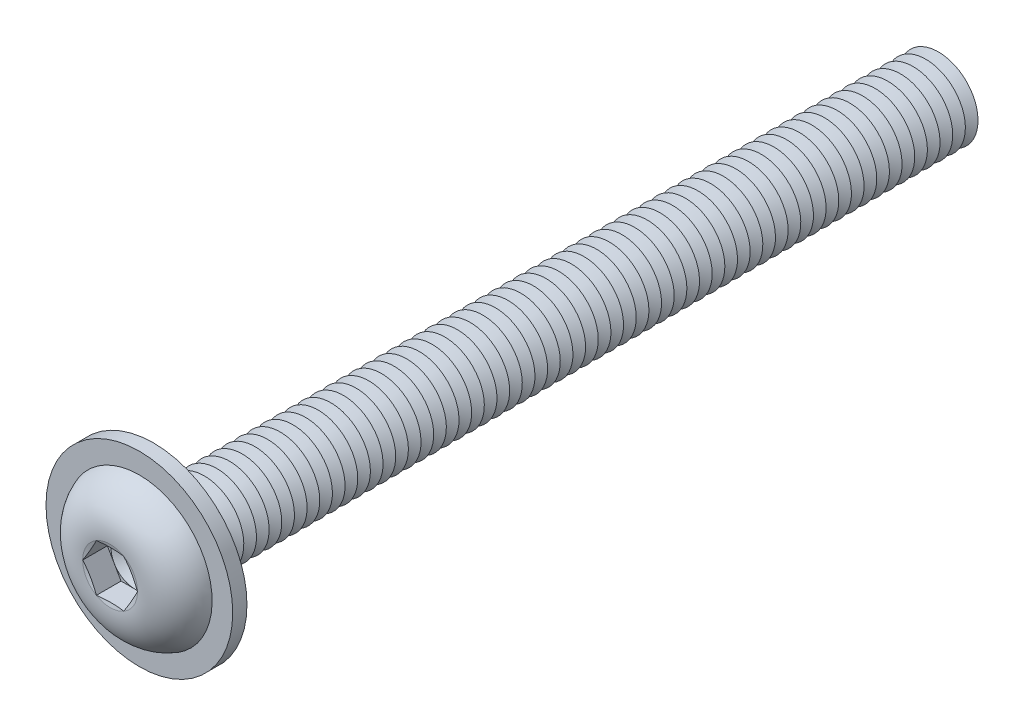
ISO-10303-21;
HEADER;
FILE_DESCRIPTION(('STEP AP214'),'2;1');
FILE_NAME('part.step','',(''),(''),'','','');
FILE_SCHEMA(('AUTOMOTIVE_DESIGN { 1 0 10303 214 1 1 1 1 }'));
ENDSEC;
DATA;
#1=APPLICATION_CONTEXT('core data for automotive mechanical design processes');
#2=APPLICATION_PROTOCOL_DEFINITION('international standard','automotive_design',2000,#1);
#3=PRODUCT_CONTEXT('',#1,'mechanical');
#4=PRODUCT('Part','Part','',(#3));
#5=PRODUCT_RELATED_PRODUCT_CATEGORY('part','',(#4));
#6=PRODUCT_DEFINITION_FORMATION('','',#4);
#7=PRODUCT_DEFINITION_CONTEXT('part definition',#1,'design');
#8=PRODUCT_DEFINITION('design','',#6,#7);
#9=PRODUCT_DEFINITION_SHAPE('','',#8);
#10=(LENGTH_UNIT() NAMED_UNIT(*) SI_UNIT(.MILLI.,.METRE.));
#11=(NAMED_UNIT(*) PLANE_ANGLE_UNIT() SI_UNIT($,.RADIAN.));
#12=(NAMED_UNIT(*) SI_UNIT($,.STERADIAN.) SOLID_ANGLE_UNIT());
#13=UNCERTAINTY_MEASURE_WITH_UNIT(LENGTH_MEASURE(1.E-05),#10,'distance_accuracy_value','');
#14=(GEOMETRIC_REPRESENTATION_CONTEXT(3) GLOBAL_UNCERTAINTY_ASSIGNED_CONTEXT((#13)) GLOBAL_UNIT_ASSIGNED_CONTEXT((#10,
#11,#12)) REPRESENTATION_CONTEXT('',''));
#15=CARTESIAN_POINT('',(0.,0.,0.));
#16=DIRECTION('',(0.,0.,1.));
#17=DIRECTION('',(1.,0.,0.));
#18=AXIS2_PLACEMENT_3D('',#15,#16,#17);
#19=CARTESIAN_POINT('',(0.,0.,-47.2));
#20=DIRECTION('',(0.,0.,1.));
#21=DIRECTION('',(0.,-1.,0.));
#22=AXIS2_PLACEMENT_3D('',#19,#20,#21);
#23=CONICAL_SURFACE('',#22,2.49999999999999,1.0471975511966);
#24=CARTESIAN_POINT('',(0.,0.,-47.6));
#25=DIRECTION('',(0.,0.,1.));
#26=DIRECTION('',(0.,-1.,0.));
#27=AXIS2_PLACEMENT_3D('',#24,#25,#26);
#28=CIRCLE('',#27,1.80717967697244);
#29=CARTESIAN_POINT('',(0.,-1.80717967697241,-47.6));
#30=VERTEX_POINT('',#29);
#31=EDGE_CURVE('E704',#30,#30,#28,.T.);
#32=ORIENTED_EDGE('',*,*,#31,.T.);
#33=EDGE_LOOP('',(#32));
#34=FACE_BOUND('',#33,.T.);
#35=CARTESIAN_POINT('',(0.,0.,-47.2));
#36=DIRECTION('',(0.,0.,1.));
#37=DIRECTION('',(0.,-1.,0.));
#38=AXIS2_PLACEMENT_3D('',#35,#36,#37);
#39=CIRCLE('',#38,2.49999999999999);
#40=CARTESIAN_POINT('',(0.,-2.49999999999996,-47.2));
#41=VERTEX_POINT('',#40);
#42=EDGE_CURVE('E700',#41,#41,#39,.T.);
#43=ORIENTED_EDGE('',*,*,#42,.F.);
#44=EDGE_LOOP('',(#43));
#45=FACE_BOUND('',#44,.T.);
#46=ADVANCED_FACE('F39',(#34,#45),#23,.T.);
#47=CARTESIAN_POINT('',(0.,0.,-47.6));
#48=DIRECTION('',(0.,0.,-1.));
#49=DIRECTION('',(0.,1.,0.));
#50=AXIS2_PLACEMENT_3D('',#47,#48,#49);
#51=CONICAL_SURFACE('',#50,1.80717967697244,1.04719755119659);
#52=CARTESIAN_POINT('',(0.,0.,-48.));
#53=DIRECTION('',(0.,0.,1.));
#54=DIRECTION('',(0.,-1.,0.));
#55=AXIS2_PLACEMENT_3D('',#52,#53,#54);
#56=CIRCLE('',#55,2.49999999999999);
#57=CARTESIAN_POINT('',(0.,-2.49999999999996,-48.));
#58=VERTEX_POINT('',#57);
#59=EDGE_CURVE('E708',#58,#58,#56,.T.);
#60=ORIENTED_EDGE('',*,*,#59,.T.);
#61=EDGE_LOOP('',(#60));
#62=FACE_BOUND('',#61,.T.);
#63=ORIENTED_EDGE('',*,*,#31,.F.);
#64=EDGE_LOOP('',(#63));
#65=FACE_BOUND('',#64,.T.);
#66=ADVANCED_FACE('F828',(#62,#65),#51,.T.);
#67=CARTESIAN_POINT('',(0.,2.49999999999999,-50.));
#68=DIRECTION('',(0.,0.,-1.));
#69=DIRECTION('',(0.,1.,0.));
#70=AXIS2_PLACEMENT_3D('',#67,#68,#69);
#71=PLANE('',#70);
#72=CARTESIAN_POINT('',(0.,0.,-50.));
#73=DIRECTION('',(0.,0.,1.));
#74=DIRECTION('',(0.,-1.,0.));
#75=AXIS2_PLACEMENT_3D('',#72,#73,#74);
#76=CIRCLE('',#75,1.80717967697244);
#77=CARTESIAN_POINT('',(0.,-1.80717967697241,-50.));
#78=VERTEX_POINT('',#77);
#79=EDGE_CURVE('E728',#78,#78,#76,.T.);
#80=ORIENTED_EDGE('',*,*,#79,.F.);
#81=EDGE_LOOP('',(#80));
#82=FACE_BOUND('',#81,.T.);
#83=ADVANCED_FACE('F834',(#82),#71,.T.);
#84=CARTESIAN_POINT('',(0.,0.,-49.6));
#85=DIRECTION('',(0.,0.,1.));
#86=DIRECTION('',(0.,-1.,0.));
#87=AXIS2_PLACEMENT_3D('',#84,#85,#86);
#88=CONICAL_SURFACE('',#87,2.49999999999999,1.0471975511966);
#89=ORIENTED_EDGE('',*,*,#79,.T.);
#90=EDGE_LOOP('',(#89));
#91=FACE_BOUND('',#90,.T.);
#92=CARTESIAN_POINT('',(0.,0.,-49.6));
#93=DIRECTION('',(0.,0.,1.));
#94=DIRECTION('',(0.,-1.,0.));
#95=AXIS2_PLACEMENT_3D('',#92,#93,#94);
#96=CIRCLE('',#95,2.49999999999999);
#97=CARTESIAN_POINT('',(0.,-2.49999999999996,-49.6));
#98=VERTEX_POINT('',#97);
#99=EDGE_CURVE('E724',#98,#98,#96,.T.);
#100=ORIENTED_EDGE('',*,*,#99,.F.);
#101=EDGE_LOOP('',(#100));
#102=FACE_BOUND('',#101,.T.);
#103=ADVANCED_FACE('F853',(#91,#102),#88,.T.);
#104=CARTESIAN_POINT('',(0.,0.,-49.2));
#105=DIRECTION('',(0.,0.,-1.));
#106=DIRECTION('',(0.,1.,0.));
#107=AXIS2_PLACEMENT_3D('',#104,#105,#106);
#108=CONICAL_SURFACE('',#107,1.80717967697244,1.04719755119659);
#109=ORIENTED_EDGE('',*,*,#99,.T.);
#110=EDGE_LOOP('',(#109));
#111=FACE_BOUND('',#110,.T.);
#112=CARTESIAN_POINT('',(0.,0.,-49.2));
#113=DIRECTION('',(0.,0.,1.));
#114=DIRECTION('',(0.,-1.,0.));
#115=AXIS2_PLACEMENT_3D('',#112,#113,#114);
#116=CIRCLE('',#115,1.80717967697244);
#117=CARTESIAN_POINT('',(0.,-1.80717967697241,-49.2));
#118=VERTEX_POINT('',#117);
#119=EDGE_CURVE('E720',#118,#118,#116,.T.);
#120=ORIENTED_EDGE('',*,*,#119,.F.);
#121=EDGE_LOOP('',(#120));
#122=FACE_BOUND('',#121,.T.);
#123=ADVANCED_FACE('F850',(#111,#122),#108,.T.);
#124=CARTESIAN_POINT('',(0.,0.,-48.8));
#125=DIRECTION('',(0.,0.,1.));
#126=DIRECTION('',(0.,-1.,0.));
#127=AXIS2_PLACEMENT_3D('',#124,#125,#126);
#128=CONICAL_SURFACE('',#127,2.49999999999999,1.0471975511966);
#129=ORIENTED_EDGE('',*,*,#119,.T.);
#130=EDGE_LOOP('',(#129));
#131=FACE_BOUND('',#130,.T.);
#132=CARTESIAN_POINT('',(0.,0.,-48.8));
#133=DIRECTION('',(0.,0.,1.));
#134=DIRECTION('',(0.,-1.,0.));
#135=AXIS2_PLACEMENT_3D('',#132,#133,#134);
#136=CIRCLE('',#135,2.49999999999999);
#137=CARTESIAN_POINT('',(0.,-2.49999999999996,-48.8));
#138=VERTEX_POINT('',#137);
#139=EDGE_CURVE('E716',#138,#138,#136,.T.);
#140=ORIENTED_EDGE('',*,*,#139,.F.);
#141=EDGE_LOOP('',(#140));
#142=FACE_BOUND('',#141,.T.);
#143=ADVANCED_FACE('F844',(#131,#142),#128,.T.);
#144=CARTESIAN_POINT('',(0.,0.,-48.4));
#145=DIRECTION('',(0.,0.,-1.));
#146=DIRECTION('',(0.,1.,0.));
#147=AXIS2_PLACEMENT_3D('',#144,#145,#146);
#148=CONICAL_SURFACE('',#147,1.80717967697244,1.04719755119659);
#149=ORIENTED_EDGE('',*,*,#139,.T.);
#150=EDGE_LOOP('',(#149));
#151=FACE_BOUND('',#150,.T.);
#152=CARTESIAN_POINT('',(0.,0.,-48.4));
#153=DIRECTION('',(0.,0.,1.));
#154=DIRECTION('',(0.,-1.,0.));
#155=AXIS2_PLACEMENT_3D('',#152,#153,#154);
#156=CIRCLE('',#155,1.80717967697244);
#157=CARTESIAN_POINT('',(0.,-1.80717967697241,-48.4));
#158=VERTEX_POINT('',#157);
#159=EDGE_CURVE('E712',#158,#158,#156,.T.);
#160=ORIENTED_EDGE('',*,*,#159,.F.);
#161=EDGE_LOOP('',(#160));
#162=FACE_BOUND('',#161,.T.);
#163=ADVANCED_FACE('F840',(#151,#162),#148,.T.);
#164=CARTESIAN_POINT('',(0.,0.,-48.));
#165=DIRECTION('',(0.,0.,1.));
#166=DIRECTION('',(0.,-1.,0.));
#167=AXIS2_PLACEMENT_3D('',#164,#165,#166);
#168=CONICAL_SURFACE('',#167,2.49999999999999,1.0471975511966);
#169=ORIENTED_EDGE('',*,*,#159,.T.);
#170=EDGE_LOOP('',(#169));
#171=FACE_BOUND('',#170,.T.);
#172=ORIENTED_EDGE('',*,*,#59,.F.);
#173=EDGE_LOOP('',(#172));
#174=FACE_BOUND('',#173,.T.);
#175=ADVANCED_FACE('F843',(#171,#174),#168,.T.);
#176=CARTESIAN_POINT('',(0.,0.,-46.4));
#177=DIRECTION('',(0.,0.,1.));
#178=DIRECTION('',(0.,-1.,0.));
#179=AXIS2_PLACEMENT_3D('',#176,#177,#178);
#180=CONICAL_SURFACE('',#179,2.49999999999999,1.0471975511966);
#181=CARTESIAN_POINT('',(0.,0.,-46.8));
#182=DIRECTION('',(0.,0.,1.));
#183=DIRECTION('',(0.,-1.,0.));
#184=AXIS2_PLACEMENT_3D('',#181,#182,#183);
#185=CIRCLE('',#184,1.80717967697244);
#186=CARTESIAN_POINT('',(0.,-1.80717967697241,-46.8));
#187=VERTEX_POINT('',#186);
#188=EDGE_CURVE('E696',#187,#187,#185,.T.);
#189=ORIENTED_EDGE('',*,*,#188,.T.);
#190=EDGE_LOOP('',(#189));
#191=FACE_BOUND('',#190,.T.);
#192=CARTESIAN_POINT('',(0.,0.,-46.4));
#193=DIRECTION('',(0.,0.,1.));
#194=DIRECTION('',(0.,-1.,0.));
#195=AXIS2_PLACEMENT_3D('',#192,#193,#194);
#196=CIRCLE('',#195,2.49999999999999);
#197=CARTESIAN_POINT('',(0.,-2.49999999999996,-46.4));
#198=VERTEX_POINT('',#197);
#199=EDGE_CURVE('E692',#198,#198,#196,.T.);
#200=ORIENTED_EDGE('',*,*,#199,.F.);
#201=EDGE_LOOP('',(#200));
#202=FACE_BOUND('',#201,.T.);
#203=ADVANCED_FACE('F848',(#191,#202),#180,.T.);
#204=CARTESIAN_POINT('',(0.,0.,-46.8));
#205=DIRECTION('',(0.,0.,-1.));
#206=DIRECTION('',(0.,1.,0.));
#207=AXIS2_PLACEMENT_3D('',#204,#205,#206);
#208=CONICAL_SURFACE('',#207,1.80717967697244,1.04719755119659);
#209=ORIENTED_EDGE('',*,*,#42,.T.);
#210=EDGE_LOOP('',(#209));
#211=FACE_BOUND('',#210,.T.);
#212=ORIENTED_EDGE('',*,*,#188,.F.);
#213=EDGE_LOOP('',(#212));
#214=FACE_BOUND('',#213,.T.);
#215=ADVANCED_FACE('F899',(#211,#214),#208,.T.);
#216=CARTESIAN_POINT('',(0.,0.,-45.6));
#217=DIRECTION('',(0.,0.,1.));
#218=DIRECTION('',(0.,-1.,0.));
#219=AXIS2_PLACEMENT_3D('',#216,#217,#218);
#220=CONICAL_SURFACE('',#219,2.49999999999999,1.0471975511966);
#221=CARTESIAN_POINT('',(0.,0.,-46.));
#222=DIRECTION('',(0.,0.,1.));
#223=DIRECTION('',(0.,-1.,0.));
#224=AXIS2_PLACEMENT_3D('',#221,#222,#223);
#225=CIRCLE('',#224,1.80717967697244);
#226=CARTESIAN_POINT('',(0.,-1.80717967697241,-46.));
#227=VERTEX_POINT('',#226);
#228=EDGE_CURVE('E688',#227,#227,#225,.T.);
#229=ORIENTED_EDGE('',*,*,#228,.T.);
#230=EDGE_LOOP('',(#229));
#231=FACE_BOUND('',#230,.T.);
#232=CARTESIAN_POINT('',(0.,0.,-45.6));
#233=DIRECTION('',(0.,0.,1.));
#234=DIRECTION('',(0.,-1.,0.));
#235=AXIS2_PLACEMENT_3D('',#232,#233,#234);
#236=CIRCLE('',#235,2.49999999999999);
#237=CARTESIAN_POINT('',(0.,-2.49999999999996,-45.6));
#238=VERTEX_POINT('',#237);
#239=EDGE_CURVE('E684',#238,#238,#236,.T.);
#240=ORIENTED_EDGE('',*,*,#239,.F.);
#241=EDGE_LOOP('',(#240));
#242=FACE_BOUND('',#241,.T.);
#243=ADVANCED_FACE('F905',(#231,#242),#220,.T.);
#244=CARTESIAN_POINT('',(0.,0.,-46.));
#245=DIRECTION('',(0.,0.,-1.));
#246=DIRECTION('',(0.,1.,0.));
#247=AXIS2_PLACEMENT_3D('',#244,#245,#246);
#248=CONICAL_SURFACE('',#247,1.80717967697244,1.04719755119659);
#249=ORIENTED_EDGE('',*,*,#199,.T.);
#250=EDGE_LOOP('',(#249));
#251=FACE_BOUND('',#250,.T.);
#252=ORIENTED_EDGE('',*,*,#228,.F.);
#253=EDGE_LOOP('',(#252));
#254=FACE_BOUND('',#253,.T.);
#255=ADVANCED_FACE('F912',(#251,#254),#248,.T.);
#256=CARTESIAN_POINT('',(0.,0.,-44.8));
#257=DIRECTION('',(0.,0.,1.));
#258=DIRECTION('',(0.,-1.,0.));
#259=AXIS2_PLACEMENT_3D('',#256,#257,#258);
#260=CONICAL_SURFACE('',#259,2.49999999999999,1.0471975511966);
#261=CARTESIAN_POINT('',(0.,0.,-45.2));
#262=DIRECTION('',(0.,0.,1.));
#263=DIRECTION('',(0.,-1.,0.));
#264=AXIS2_PLACEMENT_3D('',#261,#262,#263);
#265=CIRCLE('',#264,1.80717967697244);
#266=CARTESIAN_POINT('',(0.,-1.80717967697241,-45.2));
#267=VERTEX_POINT('',#266);
#268=EDGE_CURVE('E680',#267,#267,#265,.T.);
#269=ORIENTED_EDGE('',*,*,#268,.T.);
#270=EDGE_LOOP('',(#269));
#271=FACE_BOUND('',#270,.T.);
#272=CARTESIAN_POINT('',(0.,0.,-44.8));
#273=DIRECTION('',(0.,0.,1.));
#274=DIRECTION('',(0.,-1.,0.));
#275=AXIS2_PLACEMENT_3D('',#272,#273,#274);
#276=CIRCLE('',#275,2.49999999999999);
#277=CARTESIAN_POINT('',(0.,-2.49999999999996,-44.8));
#278=VERTEX_POINT('',#277);
#279=EDGE_CURVE('E676',#278,#278,#276,.T.);
#280=ORIENTED_EDGE('',*,*,#279,.F.);
#281=EDGE_LOOP('',(#280));
#282=FACE_BOUND('',#281,.T.);
#283=ADVANCED_FACE('F919',(#271,#282),#260,.T.);
#284=CARTESIAN_POINT('',(0.,0.,-45.2));
#285=DIRECTION('',(0.,0.,-1.));
#286=DIRECTION('',(0.,1.,0.));
#287=AXIS2_PLACEMENT_3D('',#284,#285,#286);
#288=CONICAL_SURFACE('',#287,1.80717967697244,1.04719755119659);
#289=ORIENTED_EDGE('',*,*,#239,.T.);
#290=EDGE_LOOP('',(#289));
#291=FACE_BOUND('',#290,.T.);
#292=ORIENTED_EDGE('',*,*,#268,.F.);
#293=EDGE_LOOP('',(#292));
#294=FACE_BOUND('',#293,.T.);
#295=ADVANCED_FACE('F926',(#291,#294),#288,.T.);
#296=CARTESIAN_POINT('',(0.,0.,-44.));
#297=DIRECTION('',(0.,0.,1.));
#298=DIRECTION('',(0.,-1.,0.));
#299=AXIS2_PLACEMENT_3D('',#296,#297,#298);
#300=CONICAL_SURFACE('',#299,2.49999999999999,1.0471975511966);
#301=CARTESIAN_POINT('',(0.,0.,-44.4));
#302=DIRECTION('',(0.,0.,1.));
#303=DIRECTION('',(0.,-1.,0.));
#304=AXIS2_PLACEMENT_3D('',#301,#302,#303);
#305=CIRCLE('',#304,1.80717967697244);
#306=CARTESIAN_POINT('',(0.,-1.80717967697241,-44.4));
#307=VERTEX_POINT('',#306);
#308=EDGE_CURVE('E672',#307,#307,#305,.T.);
#309=ORIENTED_EDGE('',*,*,#308,.T.);
#310=EDGE_LOOP('',(#309));
#311=FACE_BOUND('',#310,.T.);
#312=CARTESIAN_POINT('',(0.,0.,-44.));
#313=DIRECTION('',(0.,0.,1.));
#314=DIRECTION('',(0.,-1.,0.));
#315=AXIS2_PLACEMENT_3D('',#312,#313,#314);
#316=CIRCLE('',#315,2.49999999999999);
#317=CARTESIAN_POINT('',(0.,-2.49999999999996,-44.));
#318=VERTEX_POINT('',#317);
#319=EDGE_CURVE('E668',#318,#318,#316,.T.);
#320=ORIENTED_EDGE('',*,*,#319,.F.);
#321=EDGE_LOOP('',(#320));
#322=FACE_BOUND('',#321,.T.);
#323=ADVANCED_FACE('F933',(#311,#322),#300,.T.);
#324=CARTESIAN_POINT('',(0.,0.,-44.4));
#325=DIRECTION('',(0.,0.,-1.));
#326=DIRECTION('',(0.,1.,0.));
#327=AXIS2_PLACEMENT_3D('',#324,#325,#326);
#328=CONICAL_SURFACE('',#327,1.80717967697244,1.04719755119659);
#329=ORIENTED_EDGE('',*,*,#279,.T.);
#330=EDGE_LOOP('',(#329));
#331=FACE_BOUND('',#330,.T.);
#332=ORIENTED_EDGE('',*,*,#308,.F.);
#333=EDGE_LOOP('',(#332));
#334=FACE_BOUND('',#333,.T.);
#335=ADVANCED_FACE('F940',(#331,#334),#328,.T.);
#336=CARTESIAN_POINT('',(0.,0.,-43.2));
#337=DIRECTION('',(0.,0.,1.));
#338=DIRECTION('',(0.,-1.,0.));
#339=AXIS2_PLACEMENT_3D('',#336,#337,#338);
#340=CONICAL_SURFACE('',#339,2.49999999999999,1.0471975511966);
#341=CARTESIAN_POINT('',(0.,0.,-43.6));
#342=DIRECTION('',(0.,0.,1.));
#343=DIRECTION('',(0.,-1.,0.));
#344=AXIS2_PLACEMENT_3D('',#341,#342,#343);
#345=CIRCLE('',#344,1.80717967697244);
#346=CARTESIAN_POINT('',(0.,-1.80717967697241,-43.6));
#347=VERTEX_POINT('',#346);
#348=EDGE_CURVE('E664',#347,#347,#345,.T.);
#349=ORIENTED_EDGE('',*,*,#348,.T.);
#350=EDGE_LOOP('',(#349));
#351=FACE_BOUND('',#350,.T.);
#352=CARTESIAN_POINT('',(0.,0.,-43.2));
#353=DIRECTION('',(0.,0.,1.));
#354=DIRECTION('',(0.,-1.,0.));
#355=AXIS2_PLACEMENT_3D('',#352,#353,#354);
#356=CIRCLE('',#355,2.49999999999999);
#357=CARTESIAN_POINT('',(0.,-2.49999999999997,-43.2));
#358=VERTEX_POINT('',#357);
#359=EDGE_CURVE('E660',#358,#358,#356,.T.);
#360=ORIENTED_EDGE('',*,*,#359,.F.);
#361=EDGE_LOOP('',(#360));
#362=FACE_BOUND('',#361,.T.);
#363=ADVANCED_FACE('F947',(#351,#362),#340,.T.);
#364=CARTESIAN_POINT('',(0.,0.,-43.6));
#365=DIRECTION('',(0.,0.,-1.));
#366=DIRECTION('',(0.,1.,0.));
#367=AXIS2_PLACEMENT_3D('',#364,#365,#366);
#368=CONICAL_SURFACE('',#367,1.80717967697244,1.04719755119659);
#369=ORIENTED_EDGE('',*,*,#319,.T.);
#370=EDGE_LOOP('',(#369));
#371=FACE_BOUND('',#370,.T.);
#372=ORIENTED_EDGE('',*,*,#348,.F.);
#373=EDGE_LOOP('',(#372));
#374=FACE_BOUND('',#373,.T.);
#375=ADVANCED_FACE('F954',(#371,#374),#368,.T.);
#376=CARTESIAN_POINT('',(0.,0.,-42.4));
#377=DIRECTION('',(0.,0.,1.));
#378=DIRECTION('',(0.,-1.,0.));
#379=AXIS2_PLACEMENT_3D('',#376,#377,#378);
#380=CONICAL_SURFACE('',#379,2.49999999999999,1.0471975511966);
#381=CARTESIAN_POINT('',(0.,0.,-42.8));
#382=DIRECTION('',(0.,0.,1.));
#383=DIRECTION('',(0.,-1.,0.));
#384=AXIS2_PLACEMENT_3D('',#381,#382,#383);
#385=CIRCLE('',#384,1.80717967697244);
#386=CARTESIAN_POINT('',(0.,-1.80717967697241,-42.8));
#387=VERTEX_POINT('',#386);
#388=EDGE_CURVE('E656',#387,#387,#385,.T.);
#389=ORIENTED_EDGE('',*,*,#388,.T.);
#390=EDGE_LOOP('',(#389));
#391=FACE_BOUND('',#390,.T.);
#392=CARTESIAN_POINT('',(0.,0.,-42.4));
#393=DIRECTION('',(0.,0.,1.));
#394=DIRECTION('',(0.,-1.,0.));
#395=AXIS2_PLACEMENT_3D('',#392,#393,#394);
#396=CIRCLE('',#395,2.49999999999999);
#397=CARTESIAN_POINT('',(0.,-2.49999999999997,-42.4));
#398=VERTEX_POINT('',#397);
#399=EDGE_CURVE('E652',#398,#398,#396,.T.);
#400=ORIENTED_EDGE('',*,*,#399,.F.);
#401=EDGE_LOOP('',(#400));
#402=FACE_BOUND('',#401,.T.);
#403=ADVANCED_FACE('F961',(#391,#402),#380,.T.);
#404=CARTESIAN_POINT('',(0.,0.,-42.8));
#405=DIRECTION('',(0.,0.,-1.));
#406=DIRECTION('',(0.,1.,0.));
#407=AXIS2_PLACEMENT_3D('',#404,#405,#406);
#408=CONICAL_SURFACE('',#407,1.80717967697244,1.04719755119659);
#409=ORIENTED_EDGE('',*,*,#359,.T.);
#410=EDGE_LOOP('',(#409));
#411=FACE_BOUND('',#410,.T.);
#412=ORIENTED_EDGE('',*,*,#388,.F.);
#413=EDGE_LOOP('',(#412));
#414=FACE_BOUND('',#413,.T.);
#415=ADVANCED_FACE('F968',(#411,#414),#408,.T.);
#416=CARTESIAN_POINT('',(0.,0.,-41.6));
#417=DIRECTION('',(0.,0.,1.));
#418=DIRECTION('',(0.,-1.,0.));
#419=AXIS2_PLACEMENT_3D('',#416,#417,#418);
#420=CONICAL_SURFACE('',#419,2.49999999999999,1.0471975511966);
#421=CARTESIAN_POINT('',(0.,0.,-42.));
#422=DIRECTION('',(0.,0.,1.));
#423=DIRECTION('',(0.,-1.,0.));
#424=AXIS2_PLACEMENT_3D('',#421,#422,#423);
#425=CIRCLE('',#424,1.80717967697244);
#426=CARTESIAN_POINT('',(0.,-1.80717967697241,-42.));
#427=VERTEX_POINT('',#426);
#428=EDGE_CURVE('E648',#427,#427,#425,.T.);
#429=ORIENTED_EDGE('',*,*,#428,.T.);
#430=EDGE_LOOP('',(#429));
#431=FACE_BOUND('',#430,.T.);
#432=CARTESIAN_POINT('',(0.,0.,-41.6));
#433=DIRECTION('',(0.,0.,1.));
#434=DIRECTION('',(0.,-1.,0.));
#435=AXIS2_PLACEMENT_3D('',#432,#433,#434);
#436=CIRCLE('',#435,2.49999999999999);
#437=CARTESIAN_POINT('',(0.,-2.49999999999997,-41.6));
#438=VERTEX_POINT('',#437);
#439=EDGE_CURVE('E644',#438,#438,#436,.T.);
#440=ORIENTED_EDGE('',*,*,#439,.F.);
#441=EDGE_LOOP('',(#440));
#442=FACE_BOUND('',#441,.T.);
#443=ADVANCED_FACE('F975',(#431,#442),#420,.T.);
#444=CARTESIAN_POINT('',(0.,0.,-42.));
#445=DIRECTION('',(0.,0.,-1.));
#446=DIRECTION('',(0.,1.,0.));
#447=AXIS2_PLACEMENT_3D('',#444,#445,#446);
#448=CONICAL_SURFACE('',#447,1.80717967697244,1.04719755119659);
#449=ORIENTED_EDGE('',*,*,#399,.T.);
#450=EDGE_LOOP('',(#449));
#451=FACE_BOUND('',#450,.T.);
#452=ORIENTED_EDGE('',*,*,#428,.F.);
#453=EDGE_LOOP('',(#452));
#454=FACE_BOUND('',#453,.T.);
#455=ADVANCED_FACE('F982',(#451,#454),#448,.T.);
#456=CARTESIAN_POINT('',(0.,0.,-40.8));
#457=DIRECTION('',(0.,0.,1.));
#458=DIRECTION('',(0.,-1.,0.));
#459=AXIS2_PLACEMENT_3D('',#456,#457,#458);
#460=CONICAL_SURFACE('',#459,2.49999999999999,1.0471975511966);
#461=CARTESIAN_POINT('',(0.,0.,-41.2));
#462=DIRECTION('',(0.,0.,1.));
#463=DIRECTION('',(0.,-1.,0.));
#464=AXIS2_PLACEMENT_3D('',#461,#462,#463);
#465=CIRCLE('',#464,1.80717967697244);
#466=CARTESIAN_POINT('',(0.,-1.80717967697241,-41.2));
#467=VERTEX_POINT('',#466);
#468=EDGE_CURVE('E640',#467,#467,#465,.T.);
#469=ORIENTED_EDGE('',*,*,#468,.T.);
#470=EDGE_LOOP('',(#469));
#471=FACE_BOUND('',#470,.T.);
#472=CARTESIAN_POINT('',(0.,0.,-40.8));
#473=DIRECTION('',(0.,0.,1.));
#474=DIRECTION('',(0.,-1.,0.));
#475=AXIS2_PLACEMENT_3D('',#472,#473,#474);
#476=CIRCLE('',#475,2.49999999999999);
#477=CARTESIAN_POINT('',(0.,-2.49999999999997,-40.8));
#478=VERTEX_POINT('',#477);
#479=EDGE_CURVE('E636',#478,#478,#476,.T.);
#480=ORIENTED_EDGE('',*,*,#479,.F.);
#481=EDGE_LOOP('',(#480));
#482=FACE_BOUND('',#481,.T.);
#483=ADVANCED_FACE('F989',(#471,#482),#460,.T.);
#484=CARTESIAN_POINT('',(0.,0.,-41.2));
#485=DIRECTION('',(0.,0.,-1.));
#486=DIRECTION('',(0.,1.,0.));
#487=AXIS2_PLACEMENT_3D('',#484,#485,#486);
#488=CONICAL_SURFACE('',#487,1.80717967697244,1.04719755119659);
#489=ORIENTED_EDGE('',*,*,#439,.T.);
#490=EDGE_LOOP('',(#489));
#491=FACE_BOUND('',#490,.T.);
#492=ORIENTED_EDGE('',*,*,#468,.F.);
#493=EDGE_LOOP('',(#492));
#494=FACE_BOUND('',#493,.T.);
#495=ADVANCED_FACE('F996',(#491,#494),#488,.T.);
#496=CARTESIAN_POINT('',(0.,0.,-40.));
#497=DIRECTION('',(0.,0.,1.));
#498=DIRECTION('',(0.,-1.,0.));
#499=AXIS2_PLACEMENT_3D('',#496,#497,#498);
#500=CONICAL_SURFACE('',#499,2.49999999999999,1.0471975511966);
#501=CARTESIAN_POINT('',(0.,0.,-40.4));
#502=DIRECTION('',(0.,0.,1.));
#503=DIRECTION('',(0.,-1.,0.));
#504=AXIS2_PLACEMENT_3D('',#501,#502,#503);
#505=CIRCLE('',#504,1.80717967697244);
#506=CARTESIAN_POINT('',(0.,-1.80717967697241,-40.4));
#507=VERTEX_POINT('',#506);
#508=EDGE_CURVE('E632',#507,#507,#505,.T.);
#509=ORIENTED_EDGE('',*,*,#508,.T.);
#510=EDGE_LOOP('',(#509));
#511=FACE_BOUND('',#510,.T.);
#512=CARTESIAN_POINT('',(0.,0.,-40.));
#513=DIRECTION('',(0.,0.,1.));
#514=DIRECTION('',(0.,-1.,0.));
#515=AXIS2_PLACEMENT_3D('',#512,#513,#514);
#516=CIRCLE('',#515,2.49999999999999);
#517=CARTESIAN_POINT('',(0.,-2.49999999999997,-40.));
#518=VERTEX_POINT('',#517);
#519=EDGE_CURVE('E628',#518,#518,#516,.T.);
#520=ORIENTED_EDGE('',*,*,#519,.F.);
#521=EDGE_LOOP('',(#520));
#522=FACE_BOUND('',#521,.T.);
#523=ADVANCED_FACE('F1003',(#511,#522),#500,.T.);
#524=CARTESIAN_POINT('',(0.,0.,-40.4));
#525=DIRECTION('',(0.,0.,-1.));
#526=DIRECTION('',(0.,1.,0.));
#527=AXIS2_PLACEMENT_3D('',#524,#525,#526);
#528=CONICAL_SURFACE('',#527,1.80717967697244,1.04719755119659);
#529=ORIENTED_EDGE('',*,*,#479,.T.);
#530=EDGE_LOOP('',(#529));
#531=FACE_BOUND('',#530,.T.);
#532=ORIENTED_EDGE('',*,*,#508,.F.);
#533=EDGE_LOOP('',(#532));
#534=FACE_BOUND('',#533,.T.);
#535=ADVANCED_FACE('F1010',(#531,#534),#528,.T.);
#536=CARTESIAN_POINT('',(0.,0.,-39.2));
#537=DIRECTION('',(0.,0.,1.));
#538=DIRECTION('',(0.,-1.,0.));
#539=AXIS2_PLACEMENT_3D('',#536,#537,#538);
#540=CONICAL_SURFACE('',#539,2.49999999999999,1.0471975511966);
#541=CARTESIAN_POINT('',(0.,0.,-39.6));
#542=DIRECTION('',(0.,0.,1.));
#543=DIRECTION('',(0.,-1.,0.));
#544=AXIS2_PLACEMENT_3D('',#541,#542,#543);
#545=CIRCLE('',#544,1.80717967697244);
#546=CARTESIAN_POINT('',(0.,-1.80717967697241,-39.6));
#547=VERTEX_POINT('',#546);
#548=EDGE_CURVE('E624',#547,#547,#545,.T.);
#549=ORIENTED_EDGE('',*,*,#548,.T.);
#550=EDGE_LOOP('',(#549));
#551=FACE_BOUND('',#550,.T.);
#552=CARTESIAN_POINT('',(0.,0.,-39.2));
#553=DIRECTION('',(0.,0.,1.));
#554=DIRECTION('',(0.,-1.,0.));
#555=AXIS2_PLACEMENT_3D('',#552,#553,#554);
#556=CIRCLE('',#555,2.49999999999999);
#557=CARTESIAN_POINT('',(0.,-2.49999999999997,-39.2));
#558=VERTEX_POINT('',#557);
#559=EDGE_CURVE('E620',#558,#558,#556,.T.);
#560=ORIENTED_EDGE('',*,*,#559,.F.);
#561=EDGE_LOOP('',(#560));
#562=FACE_BOUND('',#561,.T.);
#563=ADVANCED_FACE('F1017',(#551,#562),#540,.T.);
#564=CARTESIAN_POINT('',(0.,0.,-39.6));
#565=DIRECTION('',(0.,0.,-1.));
#566=DIRECTION('',(0.,1.,0.));
#567=AXIS2_PLACEMENT_3D('',#564,#565,#566);
#568=CONICAL_SURFACE('',#567,1.80717967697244,1.04719755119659);
#569=ORIENTED_EDGE('',*,*,#519,.T.);
#570=EDGE_LOOP('',(#569));
#571=FACE_BOUND('',#570,.T.);
#572=ORIENTED_EDGE('',*,*,#548,.F.);
#573=EDGE_LOOP('',(#572));
#574=FACE_BOUND('',#573,.T.);
#575=ADVANCED_FACE('F1024',(#571,#574),#568,.T.);
#576=CARTESIAN_POINT('',(0.,0.,-38.4));
#577=DIRECTION('',(0.,0.,1.));
#578=DIRECTION('',(0.,-1.,0.));
#579=AXIS2_PLACEMENT_3D('',#576,#577,#578);
#580=CONICAL_SURFACE('',#579,2.49999999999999,1.0471975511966);
#581=CARTESIAN_POINT('',(0.,0.,-38.8));
#582=DIRECTION('',(0.,0.,1.));
#583=DIRECTION('',(0.,-1.,0.));
#584=AXIS2_PLACEMENT_3D('',#581,#582,#583);
#585=CIRCLE('',#584,1.80717967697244);
#586=CARTESIAN_POINT('',(0.,-1.80717967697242,-38.8));
#587=VERTEX_POINT('',#586);
#588=EDGE_CURVE('E616',#587,#587,#585,.T.);
#589=ORIENTED_EDGE('',*,*,#588,.T.);
#590=EDGE_LOOP('',(#589));
#591=FACE_BOUND('',#590,.T.);
#592=CARTESIAN_POINT('',(0.,0.,-38.4));
#593=DIRECTION('',(0.,0.,1.));
#594=DIRECTION('',(0.,-1.,0.));
#595=AXIS2_PLACEMENT_3D('',#592,#593,#594);
#596=CIRCLE('',#595,2.49999999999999);
#597=CARTESIAN_POINT('',(0.,-2.49999999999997,-38.4));
#598=VERTEX_POINT('',#597);
#599=EDGE_CURVE('E612',#598,#598,#596,.T.);
#600=ORIENTED_EDGE('',*,*,#599,.F.);
#601=EDGE_LOOP('',(#600));
#602=FACE_BOUND('',#601,.T.);
#603=ADVANCED_FACE('F1031',(#591,#602),#580,.T.);
#604=CARTESIAN_POINT('',(0.,0.,-38.8));
#605=DIRECTION('',(0.,0.,-1.));
#606=DIRECTION('',(0.,1.,0.));
#607=AXIS2_PLACEMENT_3D('',#604,#605,#606);
#608=CONICAL_SURFACE('',#607,1.80717967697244,1.04719755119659);
#609=ORIENTED_EDGE('',*,*,#559,.T.);
#610=EDGE_LOOP('',(#609));
#611=FACE_BOUND('',#610,.T.);
#612=ORIENTED_EDGE('',*,*,#588,.F.);
#613=EDGE_LOOP('',(#612));
#614=FACE_BOUND('',#613,.T.);
#615=ADVANCED_FACE('F1038',(#611,#614),#608,.T.);
#616=CARTESIAN_POINT('',(0.,0.,-37.6));
#617=DIRECTION('',(0.,0.,1.));
#618=DIRECTION('',(0.,-1.,0.));
#619=AXIS2_PLACEMENT_3D('',#616,#617,#618);
#620=CONICAL_SURFACE('',#619,2.49999999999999,1.0471975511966);
#621=CARTESIAN_POINT('',(0.,0.,-38.));
#622=DIRECTION('',(0.,0.,1.));
#623=DIRECTION('',(0.,-1.,0.));
#624=AXIS2_PLACEMENT_3D('',#621,#622,#623);
#625=CIRCLE('',#624,1.80717967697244);
#626=CARTESIAN_POINT('',(0.,-1.80717967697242,-38.));
#627=VERTEX_POINT('',#626);
#628=EDGE_CURVE('E608',#627,#627,#625,.T.);
#629=ORIENTED_EDGE('',*,*,#628,.T.);
#630=EDGE_LOOP('',(#629));
#631=FACE_BOUND('',#630,.T.);
#632=CARTESIAN_POINT('',(0.,0.,-37.6));
#633=DIRECTION('',(0.,0.,1.));
#634=DIRECTION('',(0.,-1.,0.));
#635=AXIS2_PLACEMENT_3D('',#632,#633,#634);
#636=CIRCLE('',#635,2.49999999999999);
#637=CARTESIAN_POINT('',(0.,-2.49999999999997,-37.6));
#638=VERTEX_POINT('',#637);
#639=EDGE_CURVE('E604',#638,#638,#636,.T.);
#640=ORIENTED_EDGE('',*,*,#639,.F.);
#641=EDGE_LOOP('',(#640));
#642=FACE_BOUND('',#641,.T.);
#643=ADVANCED_FACE('F1045',(#631,#642),#620,.T.);
#644=CARTESIAN_POINT('',(0.,0.,-38.));
#645=DIRECTION('',(0.,0.,-1.));
#646=DIRECTION('',(0.,1.,0.));
#647=AXIS2_PLACEMENT_3D('',#644,#645,#646);
#648=CONICAL_SURFACE('',#647,1.80717967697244,1.04719755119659);
#649=ORIENTED_EDGE('',*,*,#599,.T.);
#650=EDGE_LOOP('',(#649));
#651=FACE_BOUND('',#650,.T.);
#652=ORIENTED_EDGE('',*,*,#628,.F.);
#653=EDGE_LOOP('',(#652));
#654=FACE_BOUND('',#653,.T.);
#655=ADVANCED_FACE('F1052',(#651,#654),#648,.T.);
#656=CARTESIAN_POINT('',(0.,0.,-36.8));
#657=DIRECTION('',(0.,0.,1.));
#658=DIRECTION('',(0.,-1.,0.));
#659=AXIS2_PLACEMENT_3D('',#656,#657,#658);
#660=CONICAL_SURFACE('',#659,2.49999999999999,1.0471975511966);
#661=CARTESIAN_POINT('',(0.,0.,-37.2));
#662=DIRECTION('',(0.,0.,1.));
#663=DIRECTION('',(0.,-1.,0.));
#664=AXIS2_PLACEMENT_3D('',#661,#662,#663);
#665=CIRCLE('',#664,1.80717967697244);
#666=CARTESIAN_POINT('',(0.,-1.80717967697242,-37.2));
#667=VERTEX_POINT('',#666);
#668=EDGE_CURVE('E600',#667,#667,#665,.T.);
#669=ORIENTED_EDGE('',*,*,#668,.T.);
#670=EDGE_LOOP('',(#669));
#671=FACE_BOUND('',#670,.T.);
#672=CARTESIAN_POINT('',(0.,0.,-36.8));
#673=DIRECTION('',(0.,0.,1.));
#674=DIRECTION('',(0.,-1.,0.));
#675=AXIS2_PLACEMENT_3D('',#672,#673,#674);
#676=CIRCLE('',#675,2.49999999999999);
#677=CARTESIAN_POINT('',(0.,-2.49999999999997,-36.8));
#678=VERTEX_POINT('',#677);
#679=EDGE_CURVE('E596',#678,#678,#676,.T.);
#680=ORIENTED_EDGE('',*,*,#679,.F.);
#681=EDGE_LOOP('',(#680));
#682=FACE_BOUND('',#681,.T.);
#683=ADVANCED_FACE('F1059',(#671,#682),#660,.T.);
#684=CARTESIAN_POINT('',(0.,0.,-37.2));
#685=DIRECTION('',(0.,0.,-1.));
#686=DIRECTION('',(0.,1.,0.));
#687=AXIS2_PLACEMENT_3D('',#684,#685,#686);
#688=CONICAL_SURFACE('',#687,1.80717967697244,1.04719755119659);
#689=ORIENTED_EDGE('',*,*,#639,.T.);
#690=EDGE_LOOP('',(#689));
#691=FACE_BOUND('',#690,.T.);
#692=ORIENTED_EDGE('',*,*,#668,.F.);
#693=EDGE_LOOP('',(#692));
#694=FACE_BOUND('',#693,.T.);
#695=ADVANCED_FACE('F1066',(#691,#694),#688,.T.);
#696=CARTESIAN_POINT('',(0.,0.,-36.));
#697=DIRECTION('',(0.,0.,1.));
#698=DIRECTION('',(0.,-1.,0.));
#699=AXIS2_PLACEMENT_3D('',#696,#697,#698);
#700=CONICAL_SURFACE('',#699,2.49999999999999,1.0471975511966);
#701=CARTESIAN_POINT('',(0.,0.,-36.4));
#702=DIRECTION('',(0.,0.,1.));
#703=DIRECTION('',(0.,-1.,0.));
#704=AXIS2_PLACEMENT_3D('',#701,#702,#703);
#705=CIRCLE('',#704,1.80717967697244);
#706=CARTESIAN_POINT('',(0.,-1.80717967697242,-36.4));
#707=VERTEX_POINT('',#706);
#708=EDGE_CURVE('E592',#707,#707,#705,.T.);
#709=ORIENTED_EDGE('',*,*,#708,.T.);
#710=EDGE_LOOP('',(#709));
#711=FACE_BOUND('',#710,.T.);
#712=CARTESIAN_POINT('',(0.,0.,-36.));
#713=DIRECTION('',(0.,0.,1.));
#714=DIRECTION('',(0.,-1.,0.));
#715=AXIS2_PLACEMENT_3D('',#712,#713,#714);
#716=CIRCLE('',#715,2.49999999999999);
#717=CARTESIAN_POINT('',(0.,-2.49999999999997,-36.));
#718=VERTEX_POINT('',#717);
#719=EDGE_CURVE('E588',#718,#718,#716,.T.);
#720=ORIENTED_EDGE('',*,*,#719,.F.);
#721=EDGE_LOOP('',(#720));
#722=FACE_BOUND('',#721,.T.);
#723=ADVANCED_FACE('F1073',(#711,#722),#700,.T.);
#724=CARTESIAN_POINT('',(0.,0.,-36.4));
#725=DIRECTION('',(0.,0.,-1.));
#726=DIRECTION('',(0.,1.,0.));
#727=AXIS2_PLACEMENT_3D('',#724,#725,#726);
#728=CONICAL_SURFACE('',#727,1.80717967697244,1.04719755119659);
#729=ORIENTED_EDGE('',*,*,#679,.T.);
#730=EDGE_LOOP('',(#729));
#731=FACE_BOUND('',#730,.T.);
#732=ORIENTED_EDGE('',*,*,#708,.F.);
#733=EDGE_LOOP('',(#732));
#734=FACE_BOUND('',#733,.T.);
#735=ADVANCED_FACE('F1080',(#731,#734),#728,.T.);
#736=CARTESIAN_POINT('',(0.,0.,-35.2));
#737=DIRECTION('',(0.,0.,1.));
#738=DIRECTION('',(0.,-1.,0.));
#739=AXIS2_PLACEMENT_3D('',#736,#737,#738);
#740=CONICAL_SURFACE('',#739,2.49999999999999,1.0471975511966);
#741=CARTESIAN_POINT('',(0.,0.,-35.6));
#742=DIRECTION('',(0.,0.,1.));
#743=DIRECTION('',(0.,-1.,0.));
#744=AXIS2_PLACEMENT_3D('',#741,#742,#743);
#745=CIRCLE('',#744,1.80717967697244);
#746=CARTESIAN_POINT('',(0.,-1.80717967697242,-35.6));
#747=VERTEX_POINT('',#746);
#748=EDGE_CURVE('E584',#747,#747,#745,.T.);
#749=ORIENTED_EDGE('',*,*,#748,.T.);
#750=EDGE_LOOP('',(#749));
#751=FACE_BOUND('',#750,.T.);
#752=CARTESIAN_POINT('',(0.,0.,-35.2));
#753=DIRECTION('',(0.,0.,1.));
#754=DIRECTION('',(0.,-1.,0.));
#755=AXIS2_PLACEMENT_3D('',#752,#753,#754);
#756=CIRCLE('',#755,2.49999999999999);
#757=CARTESIAN_POINT('',(0.,-2.49999999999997,-35.2));
#758=VERTEX_POINT('',#757);
#759=EDGE_CURVE('E580',#758,#758,#756,.T.);
#760=ORIENTED_EDGE('',*,*,#759,.F.);
#761=EDGE_LOOP('',(#760));
#762=FACE_BOUND('',#761,.T.);
#763=ADVANCED_FACE('F1087',(#751,#762),#740,.T.);
#764=CARTESIAN_POINT('',(0.,0.,-35.6));
#765=DIRECTION('',(0.,0.,-1.));
#766=DIRECTION('',(0.,1.,0.));
#767=AXIS2_PLACEMENT_3D('',#764,#765,#766);
#768=CONICAL_SURFACE('',#767,1.80717967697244,1.04719755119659);
#769=ORIENTED_EDGE('',*,*,#719,.T.);
#770=EDGE_LOOP('',(#769));
#771=FACE_BOUND('',#770,.T.);
#772=ORIENTED_EDGE('',*,*,#748,.F.);
#773=EDGE_LOOP('',(#772));
#774=FACE_BOUND('',#773,.T.);
#775=ADVANCED_FACE('F1094',(#771,#774),#768,.T.);
#776=CARTESIAN_POINT('',(0.,0.,-34.4));
#777=DIRECTION('',(0.,0.,1.));
#778=DIRECTION('',(0.,-1.,0.));
#779=AXIS2_PLACEMENT_3D('',#776,#777,#778);
#780=CONICAL_SURFACE('',#779,2.49999999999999,1.0471975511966);
#781=CARTESIAN_POINT('',(0.,0.,-34.8));
#782=DIRECTION('',(0.,0.,1.));
#783=DIRECTION('',(0.,-1.,0.));
#784=AXIS2_PLACEMENT_3D('',#781,#782,#783);
#785=CIRCLE('',#784,1.80717967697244);
#786=CARTESIAN_POINT('',(0.,-1.80717967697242,-34.8));
#787=VERTEX_POINT('',#786);
#788=EDGE_CURVE('E576',#787,#787,#785,.T.);
#789=ORIENTED_EDGE('',*,*,#788,.T.);
#790=EDGE_LOOP('',(#789));
#791=FACE_BOUND('',#790,.T.);
#792=CARTESIAN_POINT('',(0.,0.,-34.4));
#793=DIRECTION('',(0.,0.,1.));
#794=DIRECTION('',(0.,-1.,0.));
#795=AXIS2_PLACEMENT_3D('',#792,#793,#794);
#796=CIRCLE('',#795,2.49999999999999);
#797=CARTESIAN_POINT('',(0.,-2.49999999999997,-34.4));
#798=VERTEX_POINT('',#797);
#799=EDGE_CURVE('E572',#798,#798,#796,.T.);
#800=ORIENTED_EDGE('',*,*,#799,.F.);
#801=EDGE_LOOP('',(#800));
#802=FACE_BOUND('',#801,.T.);
#803=ADVANCED_FACE('F1101',(#791,#802),#780,.T.);
#804=CARTESIAN_POINT('',(0.,0.,-34.8));
#805=DIRECTION('',(0.,0.,-1.));
#806=DIRECTION('',(0.,1.,0.));
#807=AXIS2_PLACEMENT_3D('',#804,#805,#806);
#808=CONICAL_SURFACE('',#807,1.80717967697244,1.04719755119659);
#809=ORIENTED_EDGE('',*,*,#759,.T.);
#810=EDGE_LOOP('',(#809));
#811=FACE_BOUND('',#810,.T.);
#812=ORIENTED_EDGE('',*,*,#788,.F.);
#813=EDGE_LOOP('',(#812));
#814=FACE_BOUND('',#813,.T.);
#815=ADVANCED_FACE('F1108',(#811,#814),#808,.T.);
#816=CARTESIAN_POINT('',(0.,0.,-33.6));
#817=DIRECTION('',(0.,0.,1.));
#818=DIRECTION('',(0.,-1.,0.));
#819=AXIS2_PLACEMENT_3D('',#816,#817,#818);
#820=CONICAL_SURFACE('',#819,2.49999999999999,1.0471975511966);
#821=CARTESIAN_POINT('',(0.,0.,-34.));
#822=DIRECTION('',(0.,0.,1.));
#823=DIRECTION('',(0.,-1.,0.));
#824=AXIS2_PLACEMENT_3D('',#821,#822,#823);
#825=CIRCLE('',#824,1.80717967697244);
#826=CARTESIAN_POINT('',(0.,-1.80717967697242,-34.));
#827=VERTEX_POINT('',#826);
#828=EDGE_CURVE('E568',#827,#827,#825,.T.);
#829=ORIENTED_EDGE('',*,*,#828,.T.);
#830=EDGE_LOOP('',(#829));
#831=FACE_BOUND('',#830,.T.);
#832=CARTESIAN_POINT('',(0.,0.,-33.6));
#833=DIRECTION('',(0.,0.,1.));
#834=DIRECTION('',(0.,-1.,0.));
#835=AXIS2_PLACEMENT_3D('',#832,#833,#834);
#836=CIRCLE('',#835,2.49999999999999);
#837=CARTESIAN_POINT('',(0.,-2.49999999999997,-33.6));
#838=VERTEX_POINT('',#837);
#839=EDGE_CURVE('E564',#838,#838,#836,.T.);
#840=ORIENTED_EDGE('',*,*,#839,.F.);
#841=EDGE_LOOP('',(#840));
#842=FACE_BOUND('',#841,.T.);
#843=ADVANCED_FACE('F1115',(#831,#842),#820,.T.);
#844=CARTESIAN_POINT('',(0.,0.,-34.));
#845=DIRECTION('',(0.,0.,-1.));
#846=DIRECTION('',(0.,1.,0.));
#847=AXIS2_PLACEMENT_3D('',#844,#845,#846);
#848=CONICAL_SURFACE('',#847,1.80717967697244,1.04719755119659);
#849=ORIENTED_EDGE('',*,*,#799,.T.);
#850=EDGE_LOOP('',(#849));
#851=FACE_BOUND('',#850,.T.);
#852=ORIENTED_EDGE('',*,*,#828,.F.);
#853=EDGE_LOOP('',(#852));
#854=FACE_BOUND('',#853,.T.);
#855=ADVANCED_FACE('F1122',(#851,#854),#848,.T.);
#856=CARTESIAN_POINT('',(0.,0.,-32.8));
#857=DIRECTION('',(0.,0.,1.));
#858=DIRECTION('',(0.,-1.,0.));
#859=AXIS2_PLACEMENT_3D('',#856,#857,#858);
#860=CONICAL_SURFACE('',#859,2.49999999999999,1.0471975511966);
#861=CARTESIAN_POINT('',(0.,0.,-33.2));
#862=DIRECTION('',(0.,0.,1.));
#863=DIRECTION('',(0.,-1.,0.));
#864=AXIS2_PLACEMENT_3D('',#861,#862,#863);
#865=CIRCLE('',#864,1.80717967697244);
#866=CARTESIAN_POINT('',(0.,-1.80717967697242,-33.2));
#867=VERTEX_POINT('',#866);
#868=EDGE_CURVE('E560',#867,#867,#865,.T.);
#869=ORIENTED_EDGE('',*,*,#868,.T.);
#870=EDGE_LOOP('',(#869));
#871=FACE_BOUND('',#870,.T.);
#872=CARTESIAN_POINT('',(0.,0.,-32.8));
#873=DIRECTION('',(0.,0.,1.));
#874=DIRECTION('',(0.,-1.,0.));
#875=AXIS2_PLACEMENT_3D('',#872,#873,#874);
#876=CIRCLE('',#875,2.49999999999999);
#877=CARTESIAN_POINT('',(0.,-2.49999999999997,-32.8));
#878=VERTEX_POINT('',#877);
#879=EDGE_CURVE('E556',#878,#878,#876,.T.);
#880=ORIENTED_EDGE('',*,*,#879,.F.);
#881=EDGE_LOOP('',(#880));
#882=FACE_BOUND('',#881,.T.);
#883=ADVANCED_FACE('F1129',(#871,#882),#860,.T.);
#884=CARTESIAN_POINT('',(0.,0.,-33.2));
#885=DIRECTION('',(0.,0.,-1.));
#886=DIRECTION('',(0.,1.,0.));
#887=AXIS2_PLACEMENT_3D('',#884,#885,#886);
#888=CONICAL_SURFACE('',#887,1.80717967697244,1.04719755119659);
#889=ORIENTED_EDGE('',*,*,#839,.T.);
#890=EDGE_LOOP('',(#889));
#891=FACE_BOUND('',#890,.T.);
#892=ORIENTED_EDGE('',*,*,#868,.F.);
#893=EDGE_LOOP('',(#892));
#894=FACE_BOUND('',#893,.T.);
#895=ADVANCED_FACE('F1136',(#891,#894),#888,.T.);
#896=CARTESIAN_POINT('',(0.,0.,-32.));
#897=DIRECTION('',(0.,0.,1.));
#898=DIRECTION('',(0.,-1.,0.));
#899=AXIS2_PLACEMENT_3D('',#896,#897,#898);
#900=CONICAL_SURFACE('',#899,2.49999999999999,1.0471975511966);
#901=CARTESIAN_POINT('',(0.,0.,-32.4));
#902=DIRECTION('',(0.,0.,1.));
#903=DIRECTION('',(0.,-1.,0.));
#904=AXIS2_PLACEMENT_3D('',#901,#902,#903);
#905=CIRCLE('',#904,1.80717967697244);
#906=CARTESIAN_POINT('',(0.,-1.80717967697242,-32.4));
#907=VERTEX_POINT('',#906);
#908=EDGE_CURVE('E552',#907,#907,#905,.T.);
#909=ORIENTED_EDGE('',*,*,#908,.T.);
#910=EDGE_LOOP('',(#909));
#911=FACE_BOUND('',#910,.T.);
#912=CARTESIAN_POINT('',(0.,0.,-32.));
#913=DIRECTION('',(0.,0.,1.));
#914=DIRECTION('',(0.,-1.,0.));
#915=AXIS2_PLACEMENT_3D('',#912,#913,#914);
#916=CIRCLE('',#915,2.49999999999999);
#917=CARTESIAN_POINT('',(0.,-2.49999999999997,-32.));
#918=VERTEX_POINT('',#917);
#919=EDGE_CURVE('E548',#918,#918,#916,.T.);
#920=ORIENTED_EDGE('',*,*,#919,.F.);
#921=EDGE_LOOP('',(#920));
#922=FACE_BOUND('',#921,.T.);
#923=ADVANCED_FACE('F1143',(#911,#922),#900,.T.);
#924=CARTESIAN_POINT('',(0.,0.,-32.4));
#925=DIRECTION('',(0.,0.,-1.));
#926=DIRECTION('',(0.,1.,0.));
#927=AXIS2_PLACEMENT_3D('',#924,#925,#926);
#928=CONICAL_SURFACE('',#927,1.80717967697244,1.04719755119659);
#929=ORIENTED_EDGE('',*,*,#879,.T.);
#930=EDGE_LOOP('',(#929));
#931=FACE_BOUND('',#930,.T.);
#932=ORIENTED_EDGE('',*,*,#908,.F.);
#933=EDGE_LOOP('',(#932));
#934=FACE_BOUND('',#933,.T.);
#935=ADVANCED_FACE('F1150',(#931,#934),#928,.T.);
#936=CARTESIAN_POINT('',(0.,0.,-31.2));
#937=DIRECTION('',(0.,0.,1.));
#938=DIRECTION('',(0.,-1.,0.));
#939=AXIS2_PLACEMENT_3D('',#936,#937,#938);
#940=CONICAL_SURFACE('',#939,2.49999999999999,1.0471975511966);
#941=CARTESIAN_POINT('',(0.,0.,-31.6));
#942=DIRECTION('',(0.,0.,1.));
#943=DIRECTION('',(0.,-1.,0.));
#944=AXIS2_PLACEMENT_3D('',#941,#942,#943);
#945=CIRCLE('',#944,1.80717967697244);
#946=CARTESIAN_POINT('',(0.,-1.80717967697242,-31.6));
#947=VERTEX_POINT('',#946);
#948=EDGE_CURVE('E544',#947,#947,#945,.T.);
#949=ORIENTED_EDGE('',*,*,#948,.T.);
#950=EDGE_LOOP('',(#949));
#951=FACE_BOUND('',#950,.T.);
#952=CARTESIAN_POINT('',(0.,0.,-31.2));
#953=DIRECTION('',(0.,0.,1.));
#954=DIRECTION('',(0.,-1.,0.));
#955=AXIS2_PLACEMENT_3D('',#952,#953,#954);
#956=CIRCLE('',#955,2.49999999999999);
#957=CARTESIAN_POINT('',(0.,-2.49999999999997,-31.2));
#958=VERTEX_POINT('',#957);
#959=EDGE_CURVE('E540',#958,#958,#956,.T.);
#960=ORIENTED_EDGE('',*,*,#959,.F.);
#961=EDGE_LOOP('',(#960));
#962=FACE_BOUND('',#961,.T.);
#963=ADVANCED_FACE('F1157',(#951,#962),#940,.T.);
#964=CARTESIAN_POINT('',(0.,0.,-31.6));
#965=DIRECTION('',(0.,0.,-1.));
#966=DIRECTION('',(0.,1.,0.));
#967=AXIS2_PLACEMENT_3D('',#964,#965,#966);
#968=CONICAL_SURFACE('',#967,1.80717967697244,1.04719755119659);
#969=ORIENTED_EDGE('',*,*,#919,.T.);
#970=EDGE_LOOP('',(#969));
#971=FACE_BOUND('',#970,.T.);
#972=ORIENTED_EDGE('',*,*,#948,.F.);
#973=EDGE_LOOP('',(#972));
#974=FACE_BOUND('',#973,.T.);
#975=ADVANCED_FACE('F1164',(#971,#974),#968,.T.);
#976=CARTESIAN_POINT('',(0.,0.,-30.4));
#977=DIRECTION('',(0.,0.,1.));
#978=DIRECTION('',(0.,-1.,0.));
#979=AXIS2_PLACEMENT_3D('',#976,#977,#978);
#980=CONICAL_SURFACE('',#979,2.49999999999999,1.0471975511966);
#981=CARTESIAN_POINT('',(0.,0.,-30.8));
#982=DIRECTION('',(0.,0.,1.));
#983=DIRECTION('',(0.,-1.,0.));
#984=AXIS2_PLACEMENT_3D('',#981,#982,#983);
#985=CIRCLE('',#984,1.80717967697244);
#986=CARTESIAN_POINT('',(0.,-1.80717967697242,-30.8));
#987=VERTEX_POINT('',#986);
#988=EDGE_CURVE('E536',#987,#987,#985,.T.);
#989=ORIENTED_EDGE('',*,*,#988,.T.);
#990=EDGE_LOOP('',(#989));
#991=FACE_BOUND('',#990,.T.);
#992=CARTESIAN_POINT('',(0.,0.,-30.4));
#993=DIRECTION('',(0.,0.,1.));
#994=DIRECTION('',(0.,-1.,0.));
#995=AXIS2_PLACEMENT_3D('',#992,#993,#994);
#996=CIRCLE('',#995,2.49999999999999);
#997=CARTESIAN_POINT('',(0.,-2.49999999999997,-30.4));
#998=VERTEX_POINT('',#997);
#999=EDGE_CURVE('E532',#998,#998,#996,.T.);
#1000=ORIENTED_EDGE('',*,*,#999,.F.);
#1001=EDGE_LOOP('',(#1000));
#1002=FACE_BOUND('',#1001,.T.);
#1003=ADVANCED_FACE('F1171',(#991,#1002),#980,.T.);
#1004=CARTESIAN_POINT('',(0.,0.,-30.8));
#1005=DIRECTION('',(0.,0.,-1.));
#1006=DIRECTION('',(0.,1.,0.));
#1007=AXIS2_PLACEMENT_3D('',#1004,#1005,#1006);
#1008=CONICAL_SURFACE('',#1007,1.80717967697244,1.04719755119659);
#1009=ORIENTED_EDGE('',*,*,#959,.T.);
#1010=EDGE_LOOP('',(#1009));
#1011=FACE_BOUND('',#1010,.T.);
#1012=ORIENTED_EDGE('',*,*,#988,.F.);
#1013=EDGE_LOOP('',(#1012));
#1014=FACE_BOUND('',#1013,.T.);
#1015=ADVANCED_FACE('F1178',(#1011,#1014),#1008,.T.);
#1016=CARTESIAN_POINT('',(0.,0.,-29.6));
#1017=DIRECTION('',(0.,0.,1.));
#1018=DIRECTION('',(0.,-1.,0.));
#1019=AXIS2_PLACEMENT_3D('',#1016,#1017,#1018);
#1020=CONICAL_SURFACE('',#1019,2.49999999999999,1.0471975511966);
#1021=CARTESIAN_POINT('',(0.,0.,-30.));
#1022=DIRECTION('',(0.,0.,1.));
#1023=DIRECTION('',(0.,-1.,0.));
#1024=AXIS2_PLACEMENT_3D('',#1021,#1022,#1023);
#1025=CIRCLE('',#1024,1.80717967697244);
#1026=CARTESIAN_POINT('',(0.,-1.80717967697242,-30.));
#1027=VERTEX_POINT('',#1026);
#1028=EDGE_CURVE('E528',#1027,#1027,#1025,.T.);
#1029=ORIENTED_EDGE('',*,*,#1028,.T.);
#1030=EDGE_LOOP('',(#1029));
#1031=FACE_BOUND('',#1030,.T.);
#1032=CARTESIAN_POINT('',(0.,0.,-29.6));
#1033=DIRECTION('',(0.,0.,1.));
#1034=DIRECTION('',(0.,-1.,0.));
#1035=AXIS2_PLACEMENT_3D('',#1032,#1033,#1034);
#1036=CIRCLE('',#1035,2.49999999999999);
#1037=CARTESIAN_POINT('',(0.,-2.49999999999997,-29.6));
#1038=VERTEX_POINT('',#1037);
#1039=EDGE_CURVE('E524',#1038,#1038,#1036,.T.);
#1040=ORIENTED_EDGE('',*,*,#1039,.F.);
#1041=EDGE_LOOP('',(#1040));
#1042=FACE_BOUND('',#1041,.T.);
#1043=ADVANCED_FACE('F1185',(#1031,#1042),#1020,.T.);
#1044=CARTESIAN_POINT('',(0.,0.,-30.));
#1045=DIRECTION('',(0.,0.,-1.));
#1046=DIRECTION('',(0.,1.,0.));
#1047=AXIS2_PLACEMENT_3D('',#1044,#1045,#1046);
#1048=CONICAL_SURFACE('',#1047,1.80717967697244,1.04719755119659);
#1049=ORIENTED_EDGE('',*,*,#999,.T.);
#1050=EDGE_LOOP('',(#1049));
#1051=FACE_BOUND('',#1050,.T.);
#1052=ORIENTED_EDGE('',*,*,#1028,.F.);
#1053=EDGE_LOOP('',(#1052));
#1054=FACE_BOUND('',#1053,.T.);
#1055=ADVANCED_FACE('F1192',(#1051,#1054),#1048,.T.);
#1056=CARTESIAN_POINT('',(0.,0.,-28.8));
#1057=DIRECTION('',(0.,0.,1.));
#1058=DIRECTION('',(0.,-1.,0.));
#1059=AXIS2_PLACEMENT_3D('',#1056,#1057,#1058);
#1060=CONICAL_SURFACE('',#1059,2.49999999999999,1.0471975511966);
#1061=CARTESIAN_POINT('',(0.,0.,-29.2));
#1062=DIRECTION('',(0.,0.,1.));
#1063=DIRECTION('',(0.,-1.,0.));
#1064=AXIS2_PLACEMENT_3D('',#1061,#1062,#1063);
#1065=CIRCLE('',#1064,1.80717967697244);
#1066=CARTESIAN_POINT('',(0.,-1.80717967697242,-29.2));
#1067=VERTEX_POINT('',#1066);
#1068=EDGE_CURVE('E520',#1067,#1067,#1065,.T.);
#1069=ORIENTED_EDGE('',*,*,#1068,.T.);
#1070=EDGE_LOOP('',(#1069));
#1071=FACE_BOUND('',#1070,.T.);
#1072=CARTESIAN_POINT('',(0.,0.,-28.8));
#1073=DIRECTION('',(0.,0.,1.));
#1074=DIRECTION('',(0.,-1.,0.));
#1075=AXIS2_PLACEMENT_3D('',#1072,#1073,#1074);
#1076=CIRCLE('',#1075,2.49999999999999);
#1077=CARTESIAN_POINT('',(0.,-2.49999999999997,-28.8));
#1078=VERTEX_POINT('',#1077);
#1079=EDGE_CURVE('E516',#1078,#1078,#1076,.T.);
#1080=ORIENTED_EDGE('',*,*,#1079,.F.);
#1081=EDGE_LOOP('',(#1080));
#1082=FACE_BOUND('',#1081,.T.);
#1083=ADVANCED_FACE('F1199',(#1071,#1082),#1060,.T.);
#1084=CARTESIAN_POINT('',(0.,0.,-29.2));
#1085=DIRECTION('',(0.,0.,-1.));
#1086=DIRECTION('',(0.,1.,0.));
#1087=AXIS2_PLACEMENT_3D('',#1084,#1085,#1086);
#1088=CONICAL_SURFACE('',#1087,1.80717967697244,1.04719755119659);
#1089=ORIENTED_EDGE('',*,*,#1039,.T.);
#1090=EDGE_LOOP('',(#1089));
#1091=FACE_BOUND('',#1090,.T.);
#1092=ORIENTED_EDGE('',*,*,#1068,.F.);
#1093=EDGE_LOOP('',(#1092));
#1094=FACE_BOUND('',#1093,.T.);
#1095=ADVANCED_FACE('F1206',(#1091,#1094),#1088,.T.);
#1096=CARTESIAN_POINT('',(0.,0.,-28.));
#1097=DIRECTION('',(0.,0.,1.));
#1098=DIRECTION('',(0.,-1.,0.));
#1099=AXIS2_PLACEMENT_3D('',#1096,#1097,#1098);
#1100=CONICAL_SURFACE('',#1099,2.49999999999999,1.0471975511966);
#1101=CARTESIAN_POINT('',(0.,0.,-28.4));
#1102=DIRECTION('',(0.,0.,1.));
#1103=DIRECTION('',(0.,-1.,0.));
#1104=AXIS2_PLACEMENT_3D('',#1101,#1102,#1103);
#1105=CIRCLE('',#1104,1.80717967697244);
#1106=CARTESIAN_POINT('',(0.,-1.80717967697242,-28.4));
#1107=VERTEX_POINT('',#1106);
#1108=EDGE_CURVE('E512',#1107,#1107,#1105,.T.);
#1109=ORIENTED_EDGE('',*,*,#1108,.T.);
#1110=EDGE_LOOP('',(#1109));
#1111=FACE_BOUND('',#1110,.T.);
#1112=CARTESIAN_POINT('',(0.,0.,-28.));
#1113=DIRECTION('',(0.,0.,1.));
#1114=DIRECTION('',(0.,-1.,0.));
#1115=AXIS2_PLACEMENT_3D('',#1112,#1113,#1114);
#1116=CIRCLE('',#1115,2.49999999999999);
#1117=CARTESIAN_POINT('',(0.,-2.49999999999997,-28.));
#1118=VERTEX_POINT('',#1117);
#1119=EDGE_CURVE('E508',#1118,#1118,#1116,.T.);
#1120=ORIENTED_EDGE('',*,*,#1119,.F.);
#1121=EDGE_LOOP('',(#1120));
#1122=FACE_BOUND('',#1121,.T.);
#1123=ADVANCED_FACE('F1213',(#1111,#1122),#1100,.T.);
#1124=CARTESIAN_POINT('',(0.,0.,-28.4));
#1125=DIRECTION('',(0.,0.,-1.));
#1126=DIRECTION('',(0.,1.,0.));
#1127=AXIS2_PLACEMENT_3D('',#1124,#1125,#1126);
#1128=CONICAL_SURFACE('',#1127,1.80717967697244,1.04719755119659);
#1129=ORIENTED_EDGE('',*,*,#1079,.T.);
#1130=EDGE_LOOP('',(#1129));
#1131=FACE_BOUND('',#1130,.T.);
#1132=ORIENTED_EDGE('',*,*,#1108,.F.);
#1133=EDGE_LOOP('',(#1132));
#1134=FACE_BOUND('',#1133,.T.);
#1135=ADVANCED_FACE('F1220',(#1131,#1134),#1128,.T.);
#1136=CARTESIAN_POINT('',(0.,0.,-27.2));
#1137=DIRECTION('',(0.,0.,1.));
#1138=DIRECTION('',(0.,-1.,0.));
#1139=AXIS2_PLACEMENT_3D('',#1136,#1137,#1138);
#1140=CONICAL_SURFACE('',#1139,2.49999999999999,1.0471975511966);
#1141=CARTESIAN_POINT('',(0.,0.,-27.6));
#1142=DIRECTION('',(0.,0.,1.));
#1143=DIRECTION('',(0.,-1.,0.));
#1144=AXIS2_PLACEMENT_3D('',#1141,#1142,#1143);
#1145=CIRCLE('',#1144,1.80717967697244);
#1146=CARTESIAN_POINT('',(0.,-1.80717967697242,-27.6));
#1147=VERTEX_POINT('',#1146);
#1148=EDGE_CURVE('E504',#1147,#1147,#1145,.T.);
#1149=ORIENTED_EDGE('',*,*,#1148,.T.);
#1150=EDGE_LOOP('',(#1149));
#1151=FACE_BOUND('',#1150,.T.);
#1152=CARTESIAN_POINT('',(0.,0.,-27.2));
#1153=DIRECTION('',(0.,0.,1.));
#1154=DIRECTION('',(0.,-1.,0.));
#1155=AXIS2_PLACEMENT_3D('',#1152,#1153,#1154);
#1156=CIRCLE('',#1155,2.49999999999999);
#1157=CARTESIAN_POINT('',(0.,-2.49999999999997,-27.2));
#1158=VERTEX_POINT('',#1157);
#1159=EDGE_CURVE('E500',#1158,#1158,#1156,.T.);
#1160=ORIENTED_EDGE('',*,*,#1159,.F.);
#1161=EDGE_LOOP('',(#1160));
#1162=FACE_BOUND('',#1161,.T.);
#1163=ADVANCED_FACE('F1227',(#1151,#1162),#1140,.T.);
#1164=CARTESIAN_POINT('',(0.,0.,-27.6));
#1165=DIRECTION('',(0.,0.,-1.));
#1166=DIRECTION('',(0.,1.,0.));
#1167=AXIS2_PLACEMENT_3D('',#1164,#1165,#1166);
#1168=CONICAL_SURFACE('',#1167,1.80717967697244,1.04719755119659);
#1169=ORIENTED_EDGE('',*,*,#1119,.T.);
#1170=EDGE_LOOP('',(#1169));
#1171=FACE_BOUND('',#1170,.T.);
#1172=ORIENTED_EDGE('',*,*,#1148,.F.);
#1173=EDGE_LOOP('',(#1172));
#1174=FACE_BOUND('',#1173,.T.);
#1175=ADVANCED_FACE('F1234',(#1171,#1174),#1168,.T.);
#1176=CARTESIAN_POINT('',(0.,0.,-26.4));
#1177=DIRECTION('',(0.,0.,1.));
#1178=DIRECTION('',(0.,-1.,0.));
#1179=AXIS2_PLACEMENT_3D('',#1176,#1177,#1178);
#1180=CONICAL_SURFACE('',#1179,2.49999999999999,1.0471975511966);
#1181=CARTESIAN_POINT('',(0.,0.,-26.8));
#1182=DIRECTION('',(0.,0.,1.));
#1183=DIRECTION('',(0.,-1.,0.));
#1184=AXIS2_PLACEMENT_3D('',#1181,#1182,#1183);
#1185=CIRCLE('',#1184,1.80717967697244);
#1186=CARTESIAN_POINT('',(0.,-1.80717967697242,-26.8));
#1187=VERTEX_POINT('',#1186);
#1188=EDGE_CURVE('E496',#1187,#1187,#1185,.T.);
#1189=ORIENTED_EDGE('',*,*,#1188,.T.);
#1190=EDGE_LOOP('',(#1189));
#1191=FACE_BOUND('',#1190,.T.);
#1192=CARTESIAN_POINT('',(0.,0.,-26.4));
#1193=DIRECTION('',(0.,0.,1.));
#1194=DIRECTION('',(0.,-1.,0.));
#1195=AXIS2_PLACEMENT_3D('',#1192,#1193,#1194);
#1196=CIRCLE('',#1195,2.49999999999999);
#1197=CARTESIAN_POINT('',(0.,-2.49999999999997,-26.4));
#1198=VERTEX_POINT('',#1197);
#1199=EDGE_CURVE('E492',#1198,#1198,#1196,.T.);
#1200=ORIENTED_EDGE('',*,*,#1199,.F.);
#1201=EDGE_LOOP('',(#1200));
#1202=FACE_BOUND('',#1201,.T.);
#1203=ADVANCED_FACE('F1241',(#1191,#1202),#1180,.T.);
#1204=CARTESIAN_POINT('',(0.,0.,-26.8));
#1205=DIRECTION('',(0.,0.,-1.));
#1206=DIRECTION('',(0.,1.,0.));
#1207=AXIS2_PLACEMENT_3D('',#1204,#1205,#1206);
#1208=CONICAL_SURFACE('',#1207,1.80717967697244,1.04719755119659);
#1209=ORIENTED_EDGE('',*,*,#1159,.T.);
#1210=EDGE_LOOP('',(#1209));
#1211=FACE_BOUND('',#1210,.T.);
#1212=ORIENTED_EDGE('',*,*,#1188,.F.);
#1213=EDGE_LOOP('',(#1212));
#1214=FACE_BOUND('',#1213,.T.);
#1215=ADVANCED_FACE('F1248',(#1211,#1214),#1208,.T.);
#1216=CARTESIAN_POINT('',(0.,0.,-25.6));
#1217=DIRECTION('',(0.,0.,1.));
#1218=DIRECTION('',(0.,-1.,0.));
#1219=AXIS2_PLACEMENT_3D('',#1216,#1217,#1218);
#1220=CONICAL_SURFACE('',#1219,2.49999999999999,1.0471975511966);
#1221=CARTESIAN_POINT('',(0.,0.,-26.));
#1222=DIRECTION('',(0.,0.,1.));
#1223=DIRECTION('',(0.,-1.,0.));
#1224=AXIS2_PLACEMENT_3D('',#1221,#1222,#1223);
#1225=CIRCLE('',#1224,1.80717967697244);
#1226=CARTESIAN_POINT('',(0.,-1.80717967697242,-26.));
#1227=VERTEX_POINT('',#1226);
#1228=EDGE_CURVE('E488',#1227,#1227,#1225,.T.);
#1229=ORIENTED_EDGE('',*,*,#1228,.T.);
#1230=EDGE_LOOP('',(#1229));
#1231=FACE_BOUND('',#1230,.T.);
#1232=CARTESIAN_POINT('',(0.,0.,-25.6));
#1233=DIRECTION('',(0.,0.,1.));
#1234=DIRECTION('',(0.,-1.,0.));
#1235=AXIS2_PLACEMENT_3D('',#1232,#1233,#1234);
#1236=CIRCLE('',#1235,2.49999999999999);
#1237=CARTESIAN_POINT('',(0.,-2.49999999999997,-25.6));
#1238=VERTEX_POINT('',#1237);
#1239=EDGE_CURVE('E484',#1238,#1238,#1236,.T.);
#1240=ORIENTED_EDGE('',*,*,#1239,.F.);
#1241=EDGE_LOOP('',(#1240));
#1242=FACE_BOUND('',#1241,.T.);
#1243=ADVANCED_FACE('F1255',(#1231,#1242),#1220,.T.);
#1244=CARTESIAN_POINT('',(0.,0.,-26.));
#1245=DIRECTION('',(0.,0.,-1.));
#1246=DIRECTION('',(0.,1.,0.));
#1247=AXIS2_PLACEMENT_3D('',#1244,#1245,#1246);
#1248=CONICAL_SURFACE('',#1247,1.80717967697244,1.04719755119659);
#1249=ORIENTED_EDGE('',*,*,#1199,.T.);
#1250=EDGE_LOOP('',(#1249));
#1251=FACE_BOUND('',#1250,.T.);
#1252=ORIENTED_EDGE('',*,*,#1228,.F.);
#1253=EDGE_LOOP('',(#1252));
#1254=FACE_BOUND('',#1253,.T.);
#1255=ADVANCED_FACE('F1262',(#1251,#1254),#1248,.T.);
#1256=CARTESIAN_POINT('',(0.,0.,-24.8));
#1257=DIRECTION('',(0.,0.,1.));
#1258=DIRECTION('',(0.,-1.,0.));
#1259=AXIS2_PLACEMENT_3D('',#1256,#1257,#1258);
#1260=CONICAL_SURFACE('',#1259,2.49999999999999,1.0471975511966);
#1261=CARTESIAN_POINT('',(0.,0.,-25.2));
#1262=DIRECTION('',(0.,0.,1.));
#1263=DIRECTION('',(0.,-1.,0.));
#1264=AXIS2_PLACEMENT_3D('',#1261,#1262,#1263);
#1265=CIRCLE('',#1264,1.80717967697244);
#1266=CARTESIAN_POINT('',(0.,-1.80717967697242,-25.2));
#1267=VERTEX_POINT('',#1266);
#1268=EDGE_CURVE('E480',#1267,#1267,#1265,.T.);
#1269=ORIENTED_EDGE('',*,*,#1268,.T.);
#1270=EDGE_LOOP('',(#1269));
#1271=FACE_BOUND('',#1270,.T.);
#1272=CARTESIAN_POINT('',(0.,0.,-24.8));
#1273=DIRECTION('',(0.,0.,1.));
#1274=DIRECTION('',(0.,-1.,0.));
#1275=AXIS2_PLACEMENT_3D('',#1272,#1273,#1274);
#1276=CIRCLE('',#1275,2.49999999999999);
#1277=CARTESIAN_POINT('',(0.,-2.49999999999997,-24.8));
#1278=VERTEX_POINT('',#1277);
#1279=EDGE_CURVE('E476',#1278,#1278,#1276,.T.);
#1280=ORIENTED_EDGE('',*,*,#1279,.F.);
#1281=EDGE_LOOP('',(#1280));
#1282=FACE_BOUND('',#1281,.T.);
#1283=ADVANCED_FACE('F1269',(#1271,#1282),#1260,.T.);
#1284=CARTESIAN_POINT('',(0.,0.,-25.2));
#1285=DIRECTION('',(0.,0.,-1.));
#1286=DIRECTION('',(0.,1.,0.));
#1287=AXIS2_PLACEMENT_3D('',#1284,#1285,#1286);
#1288=CONICAL_SURFACE('',#1287,1.80717967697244,1.04719755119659);
#1289=ORIENTED_EDGE('',*,*,#1239,.T.);
#1290=EDGE_LOOP('',(#1289));
#1291=FACE_BOUND('',#1290,.T.);
#1292=ORIENTED_EDGE('',*,*,#1268,.F.);
#1293=EDGE_LOOP('',(#1292));
#1294=FACE_BOUND('',#1293,.T.);
#1295=ADVANCED_FACE('F1276',(#1291,#1294),#1288,.T.);
#1296=CARTESIAN_POINT('',(0.,0.,-24.));
#1297=DIRECTION('',(0.,0.,1.));
#1298=DIRECTION('',(0.,-1.,0.));
#1299=AXIS2_PLACEMENT_3D('',#1296,#1297,#1298);
#1300=CONICAL_SURFACE('',#1299,2.49999999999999,1.0471975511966);
#1301=CARTESIAN_POINT('',(0.,0.,-24.4));
#1302=DIRECTION('',(0.,0.,1.));
#1303=DIRECTION('',(0.,-1.,0.));
#1304=AXIS2_PLACEMENT_3D('',#1301,#1302,#1303);
#1305=CIRCLE('',#1304,1.80717967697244);
#1306=CARTESIAN_POINT('',(0.,-1.80717967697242,-24.4));
#1307=VERTEX_POINT('',#1306);
#1308=EDGE_CURVE('E472',#1307,#1307,#1305,.T.);
#1309=ORIENTED_EDGE('',*,*,#1308,.T.);
#1310=EDGE_LOOP('',(#1309));
#1311=FACE_BOUND('',#1310,.T.);
#1312=CARTESIAN_POINT('',(0.,0.,-24.));
#1313=DIRECTION('',(0.,0.,1.));
#1314=DIRECTION('',(0.,-1.,0.));
#1315=AXIS2_PLACEMENT_3D('',#1312,#1313,#1314);
#1316=CIRCLE('',#1315,2.49999999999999);
#1317=CARTESIAN_POINT('',(0.,-2.49999999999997,-24.));
#1318=VERTEX_POINT('',#1317);
#1319=EDGE_CURVE('E468',#1318,#1318,#1316,.T.);
#1320=ORIENTED_EDGE('',*,*,#1319,.F.);
#1321=EDGE_LOOP('',(#1320));
#1322=FACE_BOUND('',#1321,.T.);
#1323=ADVANCED_FACE('F1283',(#1311,#1322),#1300,.T.);
#1324=CARTESIAN_POINT('',(0.,0.,-24.4));
#1325=DIRECTION('',(0.,0.,-1.));
#1326=DIRECTION('',(0.,1.,0.));
#1327=AXIS2_PLACEMENT_3D('',#1324,#1325,#1326);
#1328=CONICAL_SURFACE('',#1327,1.80717967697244,1.04719755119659);
#1329=ORIENTED_EDGE('',*,*,#1279,.T.);
#1330=EDGE_LOOP('',(#1329));
#1331=FACE_BOUND('',#1330,.T.);
#1332=ORIENTED_EDGE('',*,*,#1308,.F.);
#1333=EDGE_LOOP('',(#1332));
#1334=FACE_BOUND('',#1333,.T.);
#1335=ADVANCED_FACE('F1290',(#1331,#1334),#1328,.T.);
#1336=CARTESIAN_POINT('',(0.,0.,-23.2));
#1337=DIRECTION('',(0.,0.,1.));
#1338=DIRECTION('',(0.,-1.,0.));
#1339=AXIS2_PLACEMENT_3D('',#1336,#1337,#1338);
#1340=CONICAL_SURFACE('',#1339,2.49999999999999,1.0471975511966);
#1341=CARTESIAN_POINT('',(0.,0.,-23.6));
#1342=DIRECTION('',(0.,0.,1.));
#1343=DIRECTION('',(0.,-1.,0.));
#1344=AXIS2_PLACEMENT_3D('',#1341,#1342,#1343);
#1345=CIRCLE('',#1344,1.80717967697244);
#1346=CARTESIAN_POINT('',(0.,-1.80717967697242,-23.6));
#1347=VERTEX_POINT('',#1346);
#1348=EDGE_CURVE('E464',#1347,#1347,#1345,.T.);
#1349=ORIENTED_EDGE('',*,*,#1348,.T.);
#1350=EDGE_LOOP('',(#1349));
#1351=FACE_BOUND('',#1350,.T.);
#1352=CARTESIAN_POINT('',(0.,0.,-23.2));
#1353=DIRECTION('',(0.,0.,1.));
#1354=DIRECTION('',(0.,-1.,0.));
#1355=AXIS2_PLACEMENT_3D('',#1352,#1353,#1354);
#1356=CIRCLE('',#1355,2.49999999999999);
#1357=CARTESIAN_POINT('',(0.,-2.49999999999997,-23.2));
#1358=VERTEX_POINT('',#1357);
#1359=EDGE_CURVE('E460',#1358,#1358,#1356,.T.);
#1360=ORIENTED_EDGE('',*,*,#1359,.F.);
#1361=EDGE_LOOP('',(#1360));
#1362=FACE_BOUND('',#1361,.T.);
#1363=ADVANCED_FACE('F1297',(#1351,#1362),#1340,.T.);
#1364=CARTESIAN_POINT('',(0.,0.,-23.6));
#1365=DIRECTION('',(0.,0.,-1.));
#1366=DIRECTION('',(0.,1.,0.));
#1367=AXIS2_PLACEMENT_3D('',#1364,#1365,#1366);
#1368=CONICAL_SURFACE('',#1367,1.80717967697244,1.04719755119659);
#1369=ORIENTED_EDGE('',*,*,#1319,.T.);
#1370=EDGE_LOOP('',(#1369));
#1371=FACE_BOUND('',#1370,.T.);
#1372=ORIENTED_EDGE('',*,*,#1348,.F.);
#1373=EDGE_LOOP('',(#1372));
#1374=FACE_BOUND('',#1373,.T.);
#1375=ADVANCED_FACE('F1304',(#1371,#1374),#1368,.T.);
#1376=CARTESIAN_POINT('',(0.,0.,-22.4));
#1377=DIRECTION('',(0.,0.,1.));
#1378=DIRECTION('',(0.,-1.,0.));
#1379=AXIS2_PLACEMENT_3D('',#1376,#1377,#1378);
#1380=CONICAL_SURFACE('',#1379,2.49999999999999,1.0471975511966);
#1381=CARTESIAN_POINT('',(0.,0.,-22.8));
#1382=DIRECTION('',(0.,0.,1.));
#1383=DIRECTION('',(0.,-1.,0.));
#1384=AXIS2_PLACEMENT_3D('',#1381,#1382,#1383);
#1385=CIRCLE('',#1384,1.80717967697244);
#1386=CARTESIAN_POINT('',(0.,-1.80717967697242,-22.8));
#1387=VERTEX_POINT('',#1386);
#1388=EDGE_CURVE('E456',#1387,#1387,#1385,.T.);
#1389=ORIENTED_EDGE('',*,*,#1388,.T.);
#1390=EDGE_LOOP('',(#1389));
#1391=FACE_BOUND('',#1390,.T.);
#1392=CARTESIAN_POINT('',(0.,0.,-22.4));
#1393=DIRECTION('',(0.,0.,1.));
#1394=DIRECTION('',(0.,-1.,0.));
#1395=AXIS2_PLACEMENT_3D('',#1392,#1393,#1394);
#1396=CIRCLE('',#1395,2.49999999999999);
#1397=CARTESIAN_POINT('',(0.,-2.49999999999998,-22.4));
#1398=VERTEX_POINT('',#1397);
#1399=EDGE_CURVE('E452',#1398,#1398,#1396,.T.);
#1400=ORIENTED_EDGE('',*,*,#1399,.F.);
#1401=EDGE_LOOP('',(#1400));
#1402=FACE_BOUND('',#1401,.T.);
#1403=ADVANCED_FACE('F1311',(#1391,#1402),#1380,.T.);
#1404=CARTESIAN_POINT('',(0.,0.,-22.8));
#1405=DIRECTION('',(0.,0.,-1.));
#1406=DIRECTION('',(0.,1.,0.));
#1407=AXIS2_PLACEMENT_3D('',#1404,#1405,#1406);
#1408=CONICAL_SURFACE('',#1407,1.80717967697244,1.04719755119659);
#1409=ORIENTED_EDGE('',*,*,#1359,.T.);
#1410=EDGE_LOOP('',(#1409));
#1411=FACE_BOUND('',#1410,.T.);
#1412=ORIENTED_EDGE('',*,*,#1388,.F.);
#1413=EDGE_LOOP('',(#1412));
#1414=FACE_BOUND('',#1413,.T.);
#1415=ADVANCED_FACE('F1318',(#1411,#1414),#1408,.T.);
#1416=CARTESIAN_POINT('',(0.,0.,-21.6));
#1417=DIRECTION('',(0.,0.,1.));
#1418=DIRECTION('',(0.,-1.,0.));
#1419=AXIS2_PLACEMENT_3D('',#1416,#1417,#1418);
#1420=CONICAL_SURFACE('',#1419,2.49999999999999,1.0471975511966);
#1421=CARTESIAN_POINT('',(0.,0.,-22.));
#1422=DIRECTION('',(0.,0.,1.));
#1423=DIRECTION('',(0.,-1.,0.));
#1424=AXIS2_PLACEMENT_3D('',#1421,#1422,#1423);
#1425=CIRCLE('',#1424,1.80717967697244);
#1426=CARTESIAN_POINT('',(0.,-1.80717967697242,-22.));
#1427=VERTEX_POINT('',#1426);
#1428=EDGE_CURVE('E448',#1427,#1427,#1425,.T.);
#1429=ORIENTED_EDGE('',*,*,#1428,.T.);
#1430=EDGE_LOOP('',(#1429));
#1431=FACE_BOUND('',#1430,.T.);
#1432=CARTESIAN_POINT('',(0.,0.,-21.6));
#1433=DIRECTION('',(0.,0.,1.));
#1434=DIRECTION('',(0.,-1.,0.));
#1435=AXIS2_PLACEMENT_3D('',#1432,#1433,#1434);
#1436=CIRCLE('',#1435,2.49999999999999);
#1437=CARTESIAN_POINT('',(0.,-2.49999999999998,-21.6));
#1438=VERTEX_POINT('',#1437);
#1439=EDGE_CURVE('E444',#1438,#1438,#1436,.T.);
#1440=ORIENTED_EDGE('',*,*,#1439,.F.);
#1441=EDGE_LOOP('',(#1440));
#1442=FACE_BOUND('',#1441,.T.);
#1443=ADVANCED_FACE('F1325',(#1431,#1442),#1420,.T.);
#1444=CARTESIAN_POINT('',(0.,0.,-22.));
#1445=DIRECTION('',(0.,0.,-1.));
#1446=DIRECTION('',(0.,1.,0.));
#1447=AXIS2_PLACEMENT_3D('',#1444,#1445,#1446);
#1448=CONICAL_SURFACE('',#1447,1.80717967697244,1.04719755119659);
#1449=ORIENTED_EDGE('',*,*,#1399,.T.);
#1450=EDGE_LOOP('',(#1449));
#1451=FACE_BOUND('',#1450,.T.);
#1452=ORIENTED_EDGE('',*,*,#1428,.F.);
#1453=EDGE_LOOP('',(#1452));
#1454=FACE_BOUND('',#1453,.T.);
#1455=ADVANCED_FACE('F1332',(#1451,#1454),#1448,.T.);
#1456=CARTESIAN_POINT('',(0.,0.,-20.8));
#1457=DIRECTION('',(0.,0.,1.));
#1458=DIRECTION('',(0.,-1.,0.));
#1459=AXIS2_PLACEMENT_3D('',#1456,#1457,#1458);
#1460=CONICAL_SURFACE('',#1459,2.49999999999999,1.0471975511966);
#1461=CARTESIAN_POINT('',(0.,0.,-21.2));
#1462=DIRECTION('',(0.,0.,1.));
#1463=DIRECTION('',(0.,-1.,0.));
#1464=AXIS2_PLACEMENT_3D('',#1461,#1462,#1463);
#1465=CIRCLE('',#1464,1.80717967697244);
#1466=CARTESIAN_POINT('',(0.,-1.80717967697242,-21.2));
#1467=VERTEX_POINT('',#1466);
#1468=EDGE_CURVE('E440',#1467,#1467,#1465,.T.);
#1469=ORIENTED_EDGE('',*,*,#1468,.T.);
#1470=EDGE_LOOP('',(#1469));
#1471=FACE_BOUND('',#1470,.T.);
#1472=CARTESIAN_POINT('',(0.,0.,-20.8));
#1473=DIRECTION('',(0.,0.,1.));
#1474=DIRECTION('',(0.,-1.,0.));
#1475=AXIS2_PLACEMENT_3D('',#1472,#1473,#1474);
#1476=CIRCLE('',#1475,2.49999999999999);
#1477=CARTESIAN_POINT('',(0.,-2.49999999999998,-20.8));
#1478=VERTEX_POINT('',#1477);
#1479=EDGE_CURVE('E436',#1478,#1478,#1476,.T.);
#1480=ORIENTED_EDGE('',*,*,#1479,.F.);
#1481=EDGE_LOOP('',(#1480));
#1482=FACE_BOUND('',#1481,.T.);
#1483=ADVANCED_FACE('F1339',(#1471,#1482),#1460,.T.);
#1484=CARTESIAN_POINT('',(0.,0.,-21.2));
#1485=DIRECTION('',(0.,0.,-1.));
#1486=DIRECTION('',(0.,1.,0.));
#1487=AXIS2_PLACEMENT_3D('',#1484,#1485,#1486);
#1488=CONICAL_SURFACE('',#1487,1.80717967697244,1.04719755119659);
#1489=ORIENTED_EDGE('',*,*,#1439,.T.);
#1490=EDGE_LOOP('',(#1489));
#1491=FACE_BOUND('',#1490,.T.);
#1492=ORIENTED_EDGE('',*,*,#1468,.F.);
#1493=EDGE_LOOP('',(#1492));
#1494=FACE_BOUND('',#1493,.T.);
#1495=ADVANCED_FACE('F1346',(#1491,#1494),#1488,.T.);
#1496=CARTESIAN_POINT('',(0.,0.,-20.));
#1497=DIRECTION('',(0.,0.,1.));
#1498=DIRECTION('',(0.,-1.,0.));
#1499=AXIS2_PLACEMENT_3D('',#1496,#1497,#1498);
#1500=CONICAL_SURFACE('',#1499,2.49999999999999,1.0471975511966);
#1501=CARTESIAN_POINT('',(0.,0.,-20.4));
#1502=DIRECTION('',(0.,0.,1.));
#1503=DIRECTION('',(0.,-1.,0.));
#1504=AXIS2_PLACEMENT_3D('',#1501,#1502,#1503);
#1505=CIRCLE('',#1504,1.80717967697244);
#1506=CARTESIAN_POINT('',(0.,-1.80717967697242,-20.4));
#1507=VERTEX_POINT('',#1506);
#1508=EDGE_CURVE('E432',#1507,#1507,#1505,.T.);
#1509=ORIENTED_EDGE('',*,*,#1508,.T.);
#1510=EDGE_LOOP('',(#1509));
#1511=FACE_BOUND('',#1510,.T.);
#1512=CARTESIAN_POINT('',(0.,0.,-20.));
#1513=DIRECTION('',(0.,0.,1.));
#1514=DIRECTION('',(0.,-1.,0.));
#1515=AXIS2_PLACEMENT_3D('',#1512,#1513,#1514);
#1516=CIRCLE('',#1515,2.49999999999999);
#1517=CARTESIAN_POINT('',(0.,-2.49999999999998,-20.));
#1518=VERTEX_POINT('',#1517);
#1519=EDGE_CURVE('E428',#1518,#1518,#1516,.T.);
#1520=ORIENTED_EDGE('',*,*,#1519,.F.);
#1521=EDGE_LOOP('',(#1520));
#1522=FACE_BOUND('',#1521,.T.);
#1523=ADVANCED_FACE('F1353',(#1511,#1522),#1500,.T.);
#1524=CARTESIAN_POINT('',(0.,0.,-20.4));
#1525=DIRECTION('',(0.,0.,-1.));
#1526=DIRECTION('',(0.,1.,0.));
#1527=AXIS2_PLACEMENT_3D('',#1524,#1525,#1526);
#1528=CONICAL_SURFACE('',#1527,1.80717967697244,1.04719755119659);
#1529=ORIENTED_EDGE('',*,*,#1479,.T.);
#1530=EDGE_LOOP('',(#1529));
#1531=FACE_BOUND('',#1530,.T.);
#1532=ORIENTED_EDGE('',*,*,#1508,.F.);
#1533=EDGE_LOOP('',(#1532));
#1534=FACE_BOUND('',#1533,.T.);
#1535=ADVANCED_FACE('F1360',(#1531,#1534),#1528,.T.);
#1536=CARTESIAN_POINT('',(0.,0.,-19.2));
#1537=DIRECTION('',(0.,0.,1.));
#1538=DIRECTION('',(0.,-1.,0.));
#1539=AXIS2_PLACEMENT_3D('',#1536,#1537,#1538);
#1540=CONICAL_SURFACE('',#1539,2.49999999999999,1.0471975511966);
#1541=CARTESIAN_POINT('',(0.,0.,-19.6));
#1542=DIRECTION('',(0.,0.,1.));
#1543=DIRECTION('',(0.,-1.,0.));
#1544=AXIS2_PLACEMENT_3D('',#1541,#1542,#1543);
#1545=CIRCLE('',#1544,1.80717967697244);
#1546=CARTESIAN_POINT('',(0.,-1.80717967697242,-19.6));
#1547=VERTEX_POINT('',#1546);
#1548=EDGE_CURVE('E424',#1547,#1547,#1545,.T.);
#1549=ORIENTED_EDGE('',*,*,#1548,.T.);
#1550=EDGE_LOOP('',(#1549));
#1551=FACE_BOUND('',#1550,.T.);
#1552=CARTESIAN_POINT('',(0.,0.,-19.2));
#1553=DIRECTION('',(0.,0.,1.));
#1554=DIRECTION('',(0.,-1.,0.));
#1555=AXIS2_PLACEMENT_3D('',#1552,#1553,#1554);
#1556=CIRCLE('',#1555,2.49999999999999);
#1557=CARTESIAN_POINT('',(0.,-2.49999999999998,-19.2));
#1558=VERTEX_POINT('',#1557);
#1559=EDGE_CURVE('E420',#1558,#1558,#1556,.T.);
#1560=ORIENTED_EDGE('',*,*,#1559,.F.);
#1561=EDGE_LOOP('',(#1560));
#1562=FACE_BOUND('',#1561,.T.);
#1563=ADVANCED_FACE('F1367',(#1551,#1562),#1540,.T.);
#1564=CARTESIAN_POINT('',(0.,0.,-19.6));
#1565=DIRECTION('',(0.,0.,-1.));
#1566=DIRECTION('',(0.,1.,0.));
#1567=AXIS2_PLACEMENT_3D('',#1564,#1565,#1566);
#1568=CONICAL_SURFACE('',#1567,1.80717967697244,1.04719755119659);
#1569=ORIENTED_EDGE('',*,*,#1519,.T.);
#1570=EDGE_LOOP('',(#1569));
#1571=FACE_BOUND('',#1570,.T.);
#1572=ORIENTED_EDGE('',*,*,#1548,.F.);
#1573=EDGE_LOOP('',(#1572));
#1574=FACE_BOUND('',#1573,.T.);
#1575=ADVANCED_FACE('F1374',(#1571,#1574),#1568,.T.);
#1576=CARTESIAN_POINT('',(0.,0.,-18.4));
#1577=DIRECTION('',(0.,0.,1.));
#1578=DIRECTION('',(0.,-1.,0.));
#1579=AXIS2_PLACEMENT_3D('',#1576,#1577,#1578);
#1580=CONICAL_SURFACE('',#1579,2.49999999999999,1.0471975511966);
#1581=CARTESIAN_POINT('',(0.,0.,-18.8));
#1582=DIRECTION('',(0.,0.,1.));
#1583=DIRECTION('',(0.,-1.,0.));
#1584=AXIS2_PLACEMENT_3D('',#1581,#1582,#1583);
#1585=CIRCLE('',#1584,1.80717967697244);
#1586=CARTESIAN_POINT('',(0.,-1.80717967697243,-18.8));
#1587=VERTEX_POINT('',#1586);
#1588=EDGE_CURVE('E416',#1587,#1587,#1585,.T.);
#1589=ORIENTED_EDGE('',*,*,#1588,.T.);
#1590=EDGE_LOOP('',(#1589));
#1591=FACE_BOUND('',#1590,.T.);
#1592=CARTESIAN_POINT('',(0.,0.,-18.4));
#1593=DIRECTION('',(0.,0.,1.));
#1594=DIRECTION('',(0.,-1.,0.));
#1595=AXIS2_PLACEMENT_3D('',#1592,#1593,#1594);
#1596=CIRCLE('',#1595,2.49999999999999);
#1597=CARTESIAN_POINT('',(0.,-2.49999999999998,-18.4));
#1598=VERTEX_POINT('',#1597);
#1599=EDGE_CURVE('E412',#1598,#1598,#1596,.T.);
#1600=ORIENTED_EDGE('',*,*,#1599,.F.);
#1601=EDGE_LOOP('',(#1600));
#1602=FACE_BOUND('',#1601,.T.);
#1603=ADVANCED_FACE('F1381',(#1591,#1602),#1580,.T.);
#1604=CARTESIAN_POINT('',(0.,0.,-18.8));
#1605=DIRECTION('',(0.,0.,-1.));
#1606=DIRECTION('',(0.,1.,0.));
#1607=AXIS2_PLACEMENT_3D('',#1604,#1605,#1606);
#1608=CONICAL_SURFACE('',#1607,1.80717967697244,1.04719755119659);
#1609=ORIENTED_EDGE('',*,*,#1559,.T.);
#1610=EDGE_LOOP('',(#1609));
#1611=FACE_BOUND('',#1610,.T.);
#1612=ORIENTED_EDGE('',*,*,#1588,.F.);
#1613=EDGE_LOOP('',(#1612));
#1614=FACE_BOUND('',#1613,.T.);
#1615=ADVANCED_FACE('F1388',(#1611,#1614),#1608,.T.);
#1616=CARTESIAN_POINT('',(0.,0.,-17.6));
#1617=DIRECTION('',(0.,0.,1.));
#1618=DIRECTION('',(0.,-1.,0.));
#1619=AXIS2_PLACEMENT_3D('',#1616,#1617,#1618);
#1620=CONICAL_SURFACE('',#1619,2.49999999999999,1.0471975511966);
#1621=CARTESIAN_POINT('',(0.,0.,-18.));
#1622=DIRECTION('',(0.,0.,1.));
#1623=DIRECTION('',(0.,-1.,0.));
#1624=AXIS2_PLACEMENT_3D('',#1621,#1622,#1623);
#1625=CIRCLE('',#1624,1.80717967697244);
#1626=CARTESIAN_POINT('',(0.,-1.80717967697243,-18.));
#1627=VERTEX_POINT('',#1626);
#1628=EDGE_CURVE('E408',#1627,#1627,#1625,.T.);
#1629=ORIENTED_EDGE('',*,*,#1628,.T.);
#1630=EDGE_LOOP('',(#1629));
#1631=FACE_BOUND('',#1630,.T.);
#1632=CARTESIAN_POINT('',(0.,0.,-17.6));
#1633=DIRECTION('',(0.,0.,1.));
#1634=DIRECTION('',(0.,-1.,0.));
#1635=AXIS2_PLACEMENT_3D('',#1632,#1633,#1634);
#1636=CIRCLE('',#1635,2.49999999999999);
#1637=CARTESIAN_POINT('',(0.,-2.49999999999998,-17.6));
#1638=VERTEX_POINT('',#1637);
#1639=EDGE_CURVE('E404',#1638,#1638,#1636,.T.);
#1640=ORIENTED_EDGE('',*,*,#1639,.F.);
#1641=EDGE_LOOP('',(#1640));
#1642=FACE_BOUND('',#1641,.T.);
#1643=ADVANCED_FACE('F1395',(#1631,#1642),#1620,.T.);
#1644=CARTESIAN_POINT('',(0.,0.,-18.));
#1645=DIRECTION('',(0.,0.,-1.));
#1646=DIRECTION('',(0.,1.,0.));
#1647=AXIS2_PLACEMENT_3D('',#1644,#1645,#1646);
#1648=CONICAL_SURFACE('',#1647,1.80717967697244,1.04719755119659);
#1649=ORIENTED_EDGE('',*,*,#1599,.T.);
#1650=EDGE_LOOP('',(#1649));
#1651=FACE_BOUND('',#1650,.T.);
#1652=ORIENTED_EDGE('',*,*,#1628,.F.);
#1653=EDGE_LOOP('',(#1652));
#1654=FACE_BOUND('',#1653,.T.);
#1655=ADVANCED_FACE('F1402',(#1651,#1654),#1648,.T.);
#1656=CARTESIAN_POINT('',(0.,0.,-16.8));
#1657=DIRECTION('',(0.,0.,1.));
#1658=DIRECTION('',(0.,-1.,0.));
#1659=AXIS2_PLACEMENT_3D('',#1656,#1657,#1658);
#1660=CONICAL_SURFACE('',#1659,2.49999999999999,1.0471975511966);
#1661=CARTESIAN_POINT('',(0.,0.,-17.2));
#1662=DIRECTION('',(0.,0.,1.));
#1663=DIRECTION('',(0.,-1.,0.));
#1664=AXIS2_PLACEMENT_3D('',#1661,#1662,#1663);
#1665=CIRCLE('',#1664,1.80717967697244);
#1666=CARTESIAN_POINT('',(0.,-1.80717967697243,-17.2));
#1667=VERTEX_POINT('',#1666);
#1668=EDGE_CURVE('E400',#1667,#1667,#1665,.T.);
#1669=ORIENTED_EDGE('',*,*,#1668,.T.);
#1670=EDGE_LOOP('',(#1669));
#1671=FACE_BOUND('',#1670,.T.);
#1672=CARTESIAN_POINT('',(0.,0.,-16.8));
#1673=DIRECTION('',(0.,0.,1.));
#1674=DIRECTION('',(0.,-1.,0.));
#1675=AXIS2_PLACEMENT_3D('',#1672,#1673,#1674);
#1676=CIRCLE('',#1675,2.49999999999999);
#1677=CARTESIAN_POINT('',(0.,-2.49999999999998,-16.8));
#1678=VERTEX_POINT('',#1677);
#1679=EDGE_CURVE('E396',#1678,#1678,#1676,.T.);
#1680=ORIENTED_EDGE('',*,*,#1679,.F.);
#1681=EDGE_LOOP('',(#1680));
#1682=FACE_BOUND('',#1681,.T.);
#1683=ADVANCED_FACE('F1409',(#1671,#1682),#1660,.T.);
#1684=CARTESIAN_POINT('',(0.,0.,-17.2));
#1685=DIRECTION('',(0.,0.,-1.));
#1686=DIRECTION('',(0.,1.,0.));
#1687=AXIS2_PLACEMENT_3D('',#1684,#1685,#1686);
#1688=CONICAL_SURFACE('',#1687,1.80717967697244,1.04719755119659);
#1689=ORIENTED_EDGE('',*,*,#1639,.T.);
#1690=EDGE_LOOP('',(#1689));
#1691=FACE_BOUND('',#1690,.T.);
#1692=ORIENTED_EDGE('',*,*,#1668,.F.);
#1693=EDGE_LOOP('',(#1692));
#1694=FACE_BOUND('',#1693,.T.);
#1695=ADVANCED_FACE('F1416',(#1691,#1694),#1688,.T.);
#1696=CARTESIAN_POINT('',(0.,0.,-16.));
#1697=DIRECTION('',(0.,0.,1.));
#1698=DIRECTION('',(0.,-1.,0.));
#1699=AXIS2_PLACEMENT_3D('',#1696,#1697,#1698);
#1700=CONICAL_SURFACE('',#1699,2.49999999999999,1.0471975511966);
#1701=CARTESIAN_POINT('',(0.,0.,-16.4));
#1702=DIRECTION('',(0.,0.,1.));
#1703=DIRECTION('',(0.,-1.,0.));
#1704=AXIS2_PLACEMENT_3D('',#1701,#1702,#1703);
#1705=CIRCLE('',#1704,1.80717967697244);
#1706=CARTESIAN_POINT('',(0.,-1.80717967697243,-16.4));
#1707=VERTEX_POINT('',#1706);
#1708=EDGE_CURVE('E392',#1707,#1707,#1705,.T.);
#1709=ORIENTED_EDGE('',*,*,#1708,.T.);
#1710=EDGE_LOOP('',(#1709));
#1711=FACE_BOUND('',#1710,.T.);
#1712=CARTESIAN_POINT('',(0.,0.,-16.));
#1713=DIRECTION('',(0.,0.,1.));
#1714=DIRECTION('',(0.,-1.,0.));
#1715=AXIS2_PLACEMENT_3D('',#1712,#1713,#1714);
#1716=CIRCLE('',#1715,2.49999999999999);
#1717=CARTESIAN_POINT('',(0.,-2.49999999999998,-16.));
#1718=VERTEX_POINT('',#1717);
#1719=EDGE_CURVE('E388',#1718,#1718,#1716,.T.);
#1720=ORIENTED_EDGE('',*,*,#1719,.F.);
#1721=EDGE_LOOP('',(#1720));
#1722=FACE_BOUND('',#1721,.T.);
#1723=ADVANCED_FACE('F1423',(#1711,#1722),#1700,.T.);
#1724=CARTESIAN_POINT('',(0.,0.,-16.4));
#1725=DIRECTION('',(0.,0.,-1.));
#1726=DIRECTION('',(0.,1.,0.));
#1727=AXIS2_PLACEMENT_3D('',#1724,#1725,#1726);
#1728=CONICAL_SURFACE('',#1727,1.80717967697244,1.04719755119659);
#1729=ORIENTED_EDGE('',*,*,#1679,.T.);
#1730=EDGE_LOOP('',(#1729));
#1731=FACE_BOUND('',#1730,.T.);
#1732=ORIENTED_EDGE('',*,*,#1708,.F.);
#1733=EDGE_LOOP('',(#1732));
#1734=FACE_BOUND('',#1733,.T.);
#1735=ADVANCED_FACE('F1430',(#1731,#1734),#1728,.T.);
#1736=CARTESIAN_POINT('',(0.,0.,-15.2));
#1737=DIRECTION('',(0.,0.,1.));
#1738=DIRECTION('',(0.,-1.,0.));
#1739=AXIS2_PLACEMENT_3D('',#1736,#1737,#1738);
#1740=CONICAL_SURFACE('',#1739,2.49999999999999,1.0471975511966);
#1741=CARTESIAN_POINT('',(0.,0.,-15.6));
#1742=DIRECTION('',(0.,0.,1.));
#1743=DIRECTION('',(0.,-1.,0.));
#1744=AXIS2_PLACEMENT_3D('',#1741,#1742,#1743);
#1745=CIRCLE('',#1744,1.80717967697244);
#1746=CARTESIAN_POINT('',(0.,-1.80717967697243,-15.6));
#1747=VERTEX_POINT('',#1746);
#1748=EDGE_CURVE('E384',#1747,#1747,#1745,.T.);
#1749=ORIENTED_EDGE('',*,*,#1748,.T.);
#1750=EDGE_LOOP('',(#1749));
#1751=FACE_BOUND('',#1750,.T.);
#1752=CARTESIAN_POINT('',(0.,0.,-15.2));
#1753=DIRECTION('',(0.,0.,1.));
#1754=DIRECTION('',(0.,-1.,0.));
#1755=AXIS2_PLACEMENT_3D('',#1752,#1753,#1754);
#1756=CIRCLE('',#1755,2.49999999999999);
#1757=CARTESIAN_POINT('',(0.,-2.49999999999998,-15.2));
#1758=VERTEX_POINT('',#1757);
#1759=EDGE_CURVE('E380',#1758,#1758,#1756,.T.);
#1760=ORIENTED_EDGE('',*,*,#1759,.F.);
#1761=EDGE_LOOP('',(#1760));
#1762=FACE_BOUND('',#1761,.T.);
#1763=ADVANCED_FACE('F1437',(#1751,#1762),#1740,.T.);
#1764=CARTESIAN_POINT('',(0.,0.,-15.6));
#1765=DIRECTION('',(0.,0.,-1.));
#1766=DIRECTION('',(0.,1.,0.));
#1767=AXIS2_PLACEMENT_3D('',#1764,#1765,#1766);
#1768=CONICAL_SURFACE('',#1767,1.80717967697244,1.04719755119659);
#1769=ORIENTED_EDGE('',*,*,#1719,.T.);
#1770=EDGE_LOOP('',(#1769));
#1771=FACE_BOUND('',#1770,.T.);
#1772=ORIENTED_EDGE('',*,*,#1748,.F.);
#1773=EDGE_LOOP('',(#1772));
#1774=FACE_BOUND('',#1773,.T.);
#1775=ADVANCED_FACE('F1444',(#1771,#1774),#1768,.T.);
#1776=CARTESIAN_POINT('',(0.,0.,-14.4));
#1777=DIRECTION('',(0.,0.,1.));
#1778=DIRECTION('',(0.,-1.,0.));
#1779=AXIS2_PLACEMENT_3D('',#1776,#1777,#1778);
#1780=CONICAL_SURFACE('',#1779,2.49999999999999,1.0471975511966);
#1781=CARTESIAN_POINT('',(0.,0.,-14.8));
#1782=DIRECTION('',(0.,0.,1.));
#1783=DIRECTION('',(0.,-1.,0.));
#1784=AXIS2_PLACEMENT_3D('',#1781,#1782,#1783);
#1785=CIRCLE('',#1784,1.80717967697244);
#1786=CARTESIAN_POINT('',(0.,-1.80717967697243,-14.8));
#1787=VERTEX_POINT('',#1786);
#1788=EDGE_CURVE('E376',#1787,#1787,#1785,.T.);
#1789=ORIENTED_EDGE('',*,*,#1788,.T.);
#1790=EDGE_LOOP('',(#1789));
#1791=FACE_BOUND('',#1790,.T.);
#1792=CARTESIAN_POINT('',(0.,0.,-14.4));
#1793=DIRECTION('',(0.,0.,1.));
#1794=DIRECTION('',(0.,-1.,0.));
#1795=AXIS2_PLACEMENT_3D('',#1792,#1793,#1794);
#1796=CIRCLE('',#1795,2.49999999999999);
#1797=CARTESIAN_POINT('',(0.,-2.49999999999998,-14.4));
#1798=VERTEX_POINT('',#1797);
#1799=EDGE_CURVE('E372',#1798,#1798,#1796,.T.);
#1800=ORIENTED_EDGE('',*,*,#1799,.F.);
#1801=EDGE_LOOP('',(#1800));
#1802=FACE_BOUND('',#1801,.T.);
#1803=ADVANCED_FACE('F1451',(#1791,#1802),#1780,.T.);
#1804=CARTESIAN_POINT('',(0.,0.,-14.8));
#1805=DIRECTION('',(0.,0.,-1.));
#1806=DIRECTION('',(0.,1.,0.));
#1807=AXIS2_PLACEMENT_3D('',#1804,#1805,#1806);
#1808=CONICAL_SURFACE('',#1807,1.80717967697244,1.04719755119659);
#1809=ORIENTED_EDGE('',*,*,#1759,.T.);
#1810=EDGE_LOOP('',(#1809));
#1811=FACE_BOUND('',#1810,.T.);
#1812=ORIENTED_EDGE('',*,*,#1788,.F.);
#1813=EDGE_LOOP('',(#1812));
#1814=FACE_BOUND('',#1813,.T.);
#1815=ADVANCED_FACE('F1458',(#1811,#1814),#1808,.T.);
#1816=CARTESIAN_POINT('',(0.,0.,-13.6));
#1817=DIRECTION('',(0.,0.,1.));
#1818=DIRECTION('',(0.,-1.,0.));
#1819=AXIS2_PLACEMENT_3D('',#1816,#1817,#1818);
#1820=CONICAL_SURFACE('',#1819,2.49999999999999,1.0471975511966);
#1821=CARTESIAN_POINT('',(0.,0.,-14.));
#1822=DIRECTION('',(0.,0.,1.));
#1823=DIRECTION('',(0.,-1.,0.));
#1824=AXIS2_PLACEMENT_3D('',#1821,#1822,#1823);
#1825=CIRCLE('',#1824,1.80717967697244);
#1826=CARTESIAN_POINT('',(0.,-1.80717967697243,-14.));
#1827=VERTEX_POINT('',#1826);
#1828=EDGE_CURVE('E368',#1827,#1827,#1825,.T.);
#1829=ORIENTED_EDGE('',*,*,#1828,.T.);
#1830=EDGE_LOOP('',(#1829));
#1831=FACE_BOUND('',#1830,.T.);
#1832=CARTESIAN_POINT('',(0.,0.,-13.6));
#1833=DIRECTION('',(0.,0.,1.));
#1834=DIRECTION('',(0.,-1.,0.));
#1835=AXIS2_PLACEMENT_3D('',#1832,#1833,#1834);
#1836=CIRCLE('',#1835,2.49999999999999);
#1837=CARTESIAN_POINT('',(0.,-2.49999999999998,-13.6));
#1838=VERTEX_POINT('',#1837);
#1839=EDGE_CURVE('E364',#1838,#1838,#1836,.T.);
#1840=ORIENTED_EDGE('',*,*,#1839,.F.);
#1841=EDGE_LOOP('',(#1840));
#1842=FACE_BOUND('',#1841,.T.);
#1843=ADVANCED_FACE('F1465',(#1831,#1842),#1820,.T.);
#1844=CARTESIAN_POINT('',(0.,0.,-14.));
#1845=DIRECTION('',(0.,0.,-1.));
#1846=DIRECTION('',(0.,1.,0.));
#1847=AXIS2_PLACEMENT_3D('',#1844,#1845,#1846);
#1848=CONICAL_SURFACE('',#1847,1.80717967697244,1.04719755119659);
#1849=ORIENTED_EDGE('',*,*,#1799,.T.);
#1850=EDGE_LOOP('',(#1849));
#1851=FACE_BOUND('',#1850,.T.);
#1852=ORIENTED_EDGE('',*,*,#1828,.F.);
#1853=EDGE_LOOP('',(#1852));
#1854=FACE_BOUND('',#1853,.T.);
#1855=ADVANCED_FACE('F1472',(#1851,#1854),#1848,.T.);
#1856=CARTESIAN_POINT('',(0.,0.,-12.8));
#1857=DIRECTION('',(0.,0.,1.));
#1858=DIRECTION('',(0.,-1.,0.));
#1859=AXIS2_PLACEMENT_3D('',#1856,#1857,#1858);
#1860=CONICAL_SURFACE('',#1859,2.49999999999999,1.0471975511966);
#1861=CARTESIAN_POINT('',(0.,0.,-13.2));
#1862=DIRECTION('',(0.,0.,1.));
#1863=DIRECTION('',(0.,-1.,0.));
#1864=AXIS2_PLACEMENT_3D('',#1861,#1862,#1863);
#1865=CIRCLE('',#1864,1.80717967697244);
#1866=CARTESIAN_POINT('',(0.,-1.80717967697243,-13.2));
#1867=VERTEX_POINT('',#1866);
#1868=EDGE_CURVE('E360',#1867,#1867,#1865,.T.);
#1869=ORIENTED_EDGE('',*,*,#1868,.T.);
#1870=EDGE_LOOP('',(#1869));
#1871=FACE_BOUND('',#1870,.T.);
#1872=CARTESIAN_POINT('',(0.,0.,-12.8));
#1873=DIRECTION('',(0.,0.,1.));
#1874=DIRECTION('',(0.,-1.,0.));
#1875=AXIS2_PLACEMENT_3D('',#1872,#1873,#1874);
#1876=CIRCLE('',#1875,2.49999999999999);
#1877=CARTESIAN_POINT('',(0.,-2.49999999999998,-12.8));
#1878=VERTEX_POINT('',#1877);
#1879=EDGE_CURVE('E356',#1878,#1878,#1876,.T.);
#1880=ORIENTED_EDGE('',*,*,#1879,.F.);
#1881=EDGE_LOOP('',(#1880));
#1882=FACE_BOUND('',#1881,.T.);
#1883=ADVANCED_FACE('F1479',(#1871,#1882),#1860,.T.);
#1884=CARTESIAN_POINT('',(0.,0.,-13.2));
#1885=DIRECTION('',(0.,0.,-1.));
#1886=DIRECTION('',(0.,1.,0.));
#1887=AXIS2_PLACEMENT_3D('',#1884,#1885,#1886);
#1888=CONICAL_SURFACE('',#1887,1.80717967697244,1.04719755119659);
#1889=ORIENTED_EDGE('',*,*,#1839,.T.);
#1890=EDGE_LOOP('',(#1889));
#1891=FACE_BOUND('',#1890,.T.);
#1892=ORIENTED_EDGE('',*,*,#1868,.F.);
#1893=EDGE_LOOP('',(#1892));
#1894=FACE_BOUND('',#1893,.T.);
#1895=ADVANCED_FACE('F1486',(#1891,#1894),#1888,.T.);
#1896=CARTESIAN_POINT('',(0.,0.,-12.));
#1897=DIRECTION('',(0.,0.,1.));
#1898=DIRECTION('',(0.,-1.,0.));
#1899=AXIS2_PLACEMENT_3D('',#1896,#1897,#1898);
#1900=CONICAL_SURFACE('',#1899,2.49999999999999,1.0471975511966);
#1901=CARTESIAN_POINT('',(0.,0.,-12.4));
#1902=DIRECTION('',(0.,0.,1.));
#1903=DIRECTION('',(0.,-1.,0.));
#1904=AXIS2_PLACEMENT_3D('',#1901,#1902,#1903);
#1905=CIRCLE('',#1904,1.80717967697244);
#1906=CARTESIAN_POINT('',(0.,-1.80717967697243,-12.4));
#1907=VERTEX_POINT('',#1906);
#1908=EDGE_CURVE('E352',#1907,#1907,#1905,.T.);
#1909=ORIENTED_EDGE('',*,*,#1908,.T.);
#1910=EDGE_LOOP('',(#1909));
#1911=FACE_BOUND('',#1910,.T.);
#1912=CARTESIAN_POINT('',(0.,0.,-12.));
#1913=DIRECTION('',(0.,0.,1.));
#1914=DIRECTION('',(0.,-1.,0.));
#1915=AXIS2_PLACEMENT_3D('',#1912,#1913,#1914);
#1916=CIRCLE('',#1915,2.49999999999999);
#1917=CARTESIAN_POINT('',(0.,-2.49999999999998,-12.));
#1918=VERTEX_POINT('',#1917);
#1919=EDGE_CURVE('E348',#1918,#1918,#1916,.T.);
#1920=ORIENTED_EDGE('',*,*,#1919,.F.);
#1921=EDGE_LOOP('',(#1920));
#1922=FACE_BOUND('',#1921,.T.);
#1923=ADVANCED_FACE('F1493',(#1911,#1922),#1900,.T.);
#1924=CARTESIAN_POINT('',(0.,0.,-12.4));
#1925=DIRECTION('',(0.,0.,-1.));
#1926=DIRECTION('',(0.,1.,0.));
#1927=AXIS2_PLACEMENT_3D('',#1924,#1925,#1926);
#1928=CONICAL_SURFACE('',#1927,1.80717967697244,1.04719755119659);
#1929=ORIENTED_EDGE('',*,*,#1879,.T.);
#1930=EDGE_LOOP('',(#1929));
#1931=FACE_BOUND('',#1930,.T.);
#1932=ORIENTED_EDGE('',*,*,#1908,.F.);
#1933=EDGE_LOOP('',(#1932));
#1934=FACE_BOUND('',#1933,.T.);
#1935=ADVANCED_FACE('F1500',(#1931,#1934),#1928,.T.);
#1936=CARTESIAN_POINT('',(0.,0.,-11.2));
#1937=DIRECTION('',(0.,0.,1.));
#1938=DIRECTION('',(0.,-1.,0.));
#1939=AXIS2_PLACEMENT_3D('',#1936,#1937,#1938);
#1940=CONICAL_SURFACE('',#1939,2.49999999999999,1.0471975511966);
#1941=CARTESIAN_POINT('',(0.,0.,-11.6));
#1942=DIRECTION('',(0.,0.,1.));
#1943=DIRECTION('',(0.,-1.,0.));
#1944=AXIS2_PLACEMENT_3D('',#1941,#1942,#1943);
#1945=CIRCLE('',#1944,1.80717967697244);
#1946=CARTESIAN_POINT('',(0.,-1.80717967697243,-11.6));
#1947=VERTEX_POINT('',#1946);
#1948=EDGE_CURVE('E344',#1947,#1947,#1945,.T.);
#1949=ORIENTED_EDGE('',*,*,#1948,.T.);
#1950=EDGE_LOOP('',(#1949));
#1951=FACE_BOUND('',#1950,.T.);
#1952=CARTESIAN_POINT('',(0.,0.,-11.2));
#1953=DIRECTION('',(0.,0.,1.));
#1954=DIRECTION('',(0.,-1.,0.));
#1955=AXIS2_PLACEMENT_3D('',#1952,#1953,#1954);
#1956=CIRCLE('',#1955,2.49999999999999);
#1957=CARTESIAN_POINT('',(0.,-2.49999999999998,-11.2));
#1958=VERTEX_POINT('',#1957);
#1959=EDGE_CURVE('E340',#1958,#1958,#1956,.T.);
#1960=ORIENTED_EDGE('',*,*,#1959,.F.);
#1961=EDGE_LOOP('',(#1960));
#1962=FACE_BOUND('',#1961,.T.);
#1963=ADVANCED_FACE('F1507',(#1951,#1962),#1940,.T.);
#1964=CARTESIAN_POINT('',(0.,0.,-11.6));
#1965=DIRECTION('',(0.,0.,-1.));
#1966=DIRECTION('',(0.,1.,0.));
#1967=AXIS2_PLACEMENT_3D('',#1964,#1965,#1966);
#1968=CONICAL_SURFACE('',#1967,1.80717967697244,1.04719755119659);
#1969=ORIENTED_EDGE('',*,*,#1919,.T.);
#1970=EDGE_LOOP('',(#1969));
#1971=FACE_BOUND('',#1970,.T.);
#1972=ORIENTED_EDGE('',*,*,#1948,.F.);
#1973=EDGE_LOOP('',(#1972));
#1974=FACE_BOUND('',#1973,.T.);
#1975=ADVANCED_FACE('F1514',(#1971,#1974),#1968,.T.);
#1976=CARTESIAN_POINT('',(0.,0.,-10.4));
#1977=DIRECTION('',(0.,0.,1.));
#1978=DIRECTION('',(0.,-1.,0.));
#1979=AXIS2_PLACEMENT_3D('',#1976,#1977,#1978);
#1980=CONICAL_SURFACE('',#1979,2.49999999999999,1.0471975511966);
#1981=CARTESIAN_POINT('',(0.,0.,-10.8));
#1982=DIRECTION('',(0.,0.,1.));
#1983=DIRECTION('',(0.,-1.,0.));
#1984=AXIS2_PLACEMENT_3D('',#1981,#1982,#1983);
#1985=CIRCLE('',#1984,1.80717967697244);
#1986=CARTESIAN_POINT('',(0.,-1.80717967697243,-10.8));
#1987=VERTEX_POINT('',#1986);
#1988=EDGE_CURVE('E336',#1987,#1987,#1985,.T.);
#1989=ORIENTED_EDGE('',*,*,#1988,.T.);
#1990=EDGE_LOOP('',(#1989));
#1991=FACE_BOUND('',#1990,.T.);
#1992=CARTESIAN_POINT('',(0.,0.,-10.4));
#1993=DIRECTION('',(0.,0.,1.));
#1994=DIRECTION('',(0.,-1.,0.));
#1995=AXIS2_PLACEMENT_3D('',#1992,#1993,#1994);
#1996=CIRCLE('',#1995,2.49999999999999);
#1997=CARTESIAN_POINT('',(0.,-2.49999999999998,-10.4));
#1998=VERTEX_POINT('',#1997);
#1999=EDGE_CURVE('E332',#1998,#1998,#1996,.T.);
#2000=ORIENTED_EDGE('',*,*,#1999,.F.);
#2001=EDGE_LOOP('',(#2000));
#2002=FACE_BOUND('',#2001,.T.);
#2003=ADVANCED_FACE('F1521',(#1991,#2002),#1980,.T.);
#2004=CARTESIAN_POINT('',(0.,0.,-10.8));
#2005=DIRECTION('',(0.,0.,-1.));
#2006=DIRECTION('',(0.,1.,0.));
#2007=AXIS2_PLACEMENT_3D('',#2004,#2005,#2006);
#2008=CONICAL_SURFACE('',#2007,1.80717967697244,1.04719755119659);
#2009=ORIENTED_EDGE('',*,*,#1959,.T.);
#2010=EDGE_LOOP('',(#2009));
#2011=FACE_BOUND('',#2010,.T.);
#2012=ORIENTED_EDGE('',*,*,#1988,.F.);
#2013=EDGE_LOOP('',(#2012));
#2014=FACE_BOUND('',#2013,.T.);
#2015=ADVANCED_FACE('F1528',(#2011,#2014),#2008,.T.);
#2016=CARTESIAN_POINT('',(0.,0.,-9.6));
#2017=DIRECTION('',(0.,0.,1.));
#2018=DIRECTION('',(0.,-1.,0.));
#2019=AXIS2_PLACEMENT_3D('',#2016,#2017,#2018);
#2020=CONICAL_SURFACE('',#2019,2.49999999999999,1.0471975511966);
#2021=CARTESIAN_POINT('',(0.,0.,-10.));
#2022=DIRECTION('',(0.,0.,1.));
#2023=DIRECTION('',(0.,-1.,0.));
#2024=AXIS2_PLACEMENT_3D('',#2021,#2022,#2023);
#2025=CIRCLE('',#2024,1.80717967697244);
#2026=CARTESIAN_POINT('',(0.,-1.80717967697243,-10.));
#2027=VERTEX_POINT('',#2026);
#2028=EDGE_CURVE('E328',#2027,#2027,#2025,.T.);
#2029=ORIENTED_EDGE('',*,*,#2028,.T.);
#2030=EDGE_LOOP('',(#2029));
#2031=FACE_BOUND('',#2030,.T.);
#2032=CARTESIAN_POINT('',(0.,0.,-9.6));
#2033=DIRECTION('',(0.,0.,1.));
#2034=DIRECTION('',(0.,-1.,0.));
#2035=AXIS2_PLACEMENT_3D('',#2032,#2033,#2034);
#2036=CIRCLE('',#2035,2.49999999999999);
#2037=CARTESIAN_POINT('',(0.,-2.49999999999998,-9.60000000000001));
#2038=VERTEX_POINT('',#2037);
#2039=EDGE_CURVE('E324',#2038,#2038,#2036,.T.);
#2040=ORIENTED_EDGE('',*,*,#2039,.F.);
#2041=EDGE_LOOP('',(#2040));
#2042=FACE_BOUND('',#2041,.T.);
#2043=ADVANCED_FACE('F1535',(#2031,#2042),#2020,.T.);
#2044=CARTESIAN_POINT('',(0.,0.,-10.));
#2045=DIRECTION('',(0.,0.,-1.));
#2046=DIRECTION('',(0.,1.,0.));
#2047=AXIS2_PLACEMENT_3D('',#2044,#2045,#2046);
#2048=CONICAL_SURFACE('',#2047,1.80717967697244,1.04719755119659);
#2049=ORIENTED_EDGE('',*,*,#1999,.T.);
#2050=EDGE_LOOP('',(#2049));
#2051=FACE_BOUND('',#2050,.T.);
#2052=ORIENTED_EDGE('',*,*,#2028,.F.);
#2053=EDGE_LOOP('',(#2052));
#2054=FACE_BOUND('',#2053,.T.);
#2055=ADVANCED_FACE('F1542',(#2051,#2054),#2048,.T.);
#2056=CARTESIAN_POINT('',(0.,0.,-8.8));
#2057=DIRECTION('',(0.,0.,1.));
#2058=DIRECTION('',(0.,-1.,0.));
#2059=AXIS2_PLACEMENT_3D('',#2056,#2057,#2058);
#2060=CONICAL_SURFACE('',#2059,2.49999999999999,1.0471975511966);
#2061=CARTESIAN_POINT('',(0.,0.,-9.2));
#2062=DIRECTION('',(0.,0.,1.));
#2063=DIRECTION('',(0.,-1.,0.));
#2064=AXIS2_PLACEMENT_3D('',#2061,#2062,#2063);
#2065=CIRCLE('',#2064,1.80717967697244);
#2066=CARTESIAN_POINT('',(0.,-1.80717967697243,-9.2));
#2067=VERTEX_POINT('',#2066);
#2068=EDGE_CURVE('E320',#2067,#2067,#2065,.T.);
#2069=ORIENTED_EDGE('',*,*,#2068,.T.);
#2070=EDGE_LOOP('',(#2069));
#2071=FACE_BOUND('',#2070,.T.);
#2072=CARTESIAN_POINT('',(0.,0.,-8.8));
#2073=DIRECTION('',(0.,0.,1.));
#2074=DIRECTION('',(0.,-1.,0.));
#2075=AXIS2_PLACEMENT_3D('',#2072,#2073,#2074);
#2076=CIRCLE('',#2075,2.49999999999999);
#2077=CARTESIAN_POINT('',(0.,-2.49999999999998,-8.8));
#2078=VERTEX_POINT('',#2077);
#2079=EDGE_CURVE('E316',#2078,#2078,#2076,.T.);
#2080=ORIENTED_EDGE('',*,*,#2079,.F.);
#2081=EDGE_LOOP('',(#2080));
#2082=FACE_BOUND('',#2081,.T.);
#2083=ADVANCED_FACE('F1549',(#2071,#2082),#2060,.T.);
#2084=CARTESIAN_POINT('',(0.,0.,-9.2));
#2085=DIRECTION('',(0.,0.,-1.));
#2086=DIRECTION('',(0.,1.,0.));
#2087=AXIS2_PLACEMENT_3D('',#2084,#2085,#2086);
#2088=CONICAL_SURFACE('',#2087,1.80717967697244,1.04719755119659);
#2089=ORIENTED_EDGE('',*,*,#2039,.T.);
#2090=EDGE_LOOP('',(#2089));
#2091=FACE_BOUND('',#2090,.T.);
#2092=ORIENTED_EDGE('',*,*,#2068,.F.);
#2093=EDGE_LOOP('',(#2092));
#2094=FACE_BOUND('',#2093,.T.);
#2095=ADVANCED_FACE('F1556',(#2091,#2094),#2088,.T.);
#2096=CARTESIAN_POINT('',(0.,0.,-8.));
#2097=DIRECTION('',(0.,0.,1.));
#2098=DIRECTION('',(0.,-1.,0.));
#2099=AXIS2_PLACEMENT_3D('',#2096,#2097,#2098);
#2100=CONICAL_SURFACE('',#2099,2.49999999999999,1.0471975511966);
#2101=CARTESIAN_POINT('',(0.,0.,-8.4));
#2102=DIRECTION('',(0.,0.,1.));
#2103=DIRECTION('',(0.,-1.,0.));
#2104=AXIS2_PLACEMENT_3D('',#2101,#2102,#2103);
#2105=CIRCLE('',#2104,1.80717967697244);
#2106=CARTESIAN_POINT('',(0.,-1.80717967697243,-8.4));
#2107=VERTEX_POINT('',#2106);
#2108=EDGE_CURVE('E312',#2107,#2107,#2105,.T.);
#2109=ORIENTED_EDGE('',*,*,#2108,.T.);
#2110=EDGE_LOOP('',(#2109));
#2111=FACE_BOUND('',#2110,.T.);
#2112=CARTESIAN_POINT('',(0.,0.,-8.00000000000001));
#2113=DIRECTION('',(0.,0.,1.));
#2114=DIRECTION('',(0.,-1.,0.));
#2115=AXIS2_PLACEMENT_3D('',#2112,#2113,#2114);
#2116=CIRCLE('',#2115,2.49999999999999);
#2117=CARTESIAN_POINT('',(0.,-2.49999999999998,-8.00000000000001));
#2118=VERTEX_POINT('',#2117);
#2119=EDGE_CURVE('E308',#2118,#2118,#2116,.T.);
#2120=ORIENTED_EDGE('',*,*,#2119,.F.);
#2121=EDGE_LOOP('',(#2120));
#2122=FACE_BOUND('',#2121,.T.);
#2123=ADVANCED_FACE('F1563',(#2111,#2122),#2100,.T.);
#2124=CARTESIAN_POINT('',(0.,0.,-8.4));
#2125=DIRECTION('',(0.,0.,-1.));
#2126=DIRECTION('',(0.,1.,0.));
#2127=AXIS2_PLACEMENT_3D('',#2124,#2125,#2126);
#2128=CONICAL_SURFACE('',#2127,1.80717967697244,1.04719755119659);
#2129=ORIENTED_EDGE('',*,*,#2079,.T.);
#2130=EDGE_LOOP('',(#2129));
#2131=FACE_BOUND('',#2130,.T.);
#2132=ORIENTED_EDGE('',*,*,#2108,.F.);
#2133=EDGE_LOOP('',(#2132));
#2134=FACE_BOUND('',#2133,.T.);
#2135=ADVANCED_FACE('F1570',(#2131,#2134),#2128,.T.);
#2136=CARTESIAN_POINT('',(0.,0.,-7.2));
#2137=DIRECTION('',(0.,0.,1.));
#2138=DIRECTION('',(0.,-1.,0.));
#2139=AXIS2_PLACEMENT_3D('',#2136,#2137,#2138);
#2140=CONICAL_SURFACE('',#2139,2.49999999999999,1.0471975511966);
#2141=CARTESIAN_POINT('',(0.,0.,-7.6));
#2142=DIRECTION('',(0.,0.,1.));
#2143=DIRECTION('',(0.,-1.,0.));
#2144=AXIS2_PLACEMENT_3D('',#2141,#2142,#2143);
#2145=CIRCLE('',#2144,1.80717967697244);
#2146=CARTESIAN_POINT('',(0.,-1.80717967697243,-7.6));
#2147=VERTEX_POINT('',#2146);
#2148=EDGE_CURVE('E304',#2147,#2147,#2145,.T.);
#2149=ORIENTED_EDGE('',*,*,#2148,.T.);
#2150=EDGE_LOOP('',(#2149));
#2151=FACE_BOUND('',#2150,.T.);
#2152=CARTESIAN_POINT('',(0.,0.,-7.2));
#2153=DIRECTION('',(0.,0.,1.));
#2154=DIRECTION('',(0.,-1.,0.));
#2155=AXIS2_PLACEMENT_3D('',#2152,#2153,#2154);
#2156=CIRCLE('',#2155,2.49999999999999);
#2157=CARTESIAN_POINT('',(0.,-2.49999999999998,-7.20000000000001));
#2158=VERTEX_POINT('',#2157);
#2159=EDGE_CURVE('E300',#2158,#2158,#2156,.T.);
#2160=ORIENTED_EDGE('',*,*,#2159,.F.);
#2161=EDGE_LOOP('',(#2160));
#2162=FACE_BOUND('',#2161,.T.);
#2163=ADVANCED_FACE('F1577',(#2151,#2162),#2140,.T.);
#2164=CARTESIAN_POINT('',(0.,0.,-7.6));
#2165=DIRECTION('',(0.,0.,-1.));
#2166=DIRECTION('',(0.,1.,0.));
#2167=AXIS2_PLACEMENT_3D('',#2164,#2165,#2166);
#2168=CONICAL_SURFACE('',#2167,1.80717967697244,1.04719755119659);
#2169=ORIENTED_EDGE('',*,*,#2119,.T.);
#2170=EDGE_LOOP('',(#2169));
#2171=FACE_BOUND('',#2170,.T.);
#2172=ORIENTED_EDGE('',*,*,#2148,.F.);
#2173=EDGE_LOOP('',(#2172));
#2174=FACE_BOUND('',#2173,.T.);
#2175=ADVANCED_FACE('F1584',(#2171,#2174),#2168,.T.);
#2176=CARTESIAN_POINT('',(0.,0.,-6.4));
#2177=DIRECTION('',(0.,0.,1.));
#2178=DIRECTION('',(0.,-1.,0.));
#2179=AXIS2_PLACEMENT_3D('',#2176,#2177,#2178);
#2180=CONICAL_SURFACE('',#2179,2.49999999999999,1.0471975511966);
#2181=CARTESIAN_POINT('',(0.,0.,-6.8));
#2182=DIRECTION('',(0.,0.,1.));
#2183=DIRECTION('',(0.,-1.,0.));
#2184=AXIS2_PLACEMENT_3D('',#2181,#2182,#2183);
#2185=CIRCLE('',#2184,1.80717967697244);
#2186=CARTESIAN_POINT('',(0.,-1.80717967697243,-6.8));
#2187=VERTEX_POINT('',#2186);
#2188=EDGE_CURVE('E296',#2187,#2187,#2185,.T.);
#2189=ORIENTED_EDGE('',*,*,#2188,.T.);
#2190=EDGE_LOOP('',(#2189));
#2191=FACE_BOUND('',#2190,.T.);
#2192=CARTESIAN_POINT('',(0.,0.,-6.4));
#2193=DIRECTION('',(0.,0.,1.));
#2194=DIRECTION('',(0.,-1.,0.));
#2195=AXIS2_PLACEMENT_3D('',#2192,#2193,#2194);
#2196=CIRCLE('',#2195,2.49999999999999);
#2197=CARTESIAN_POINT('',(0.,-2.49999999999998,-6.4));
#2198=VERTEX_POINT('',#2197);
#2199=EDGE_CURVE('E292',#2198,#2198,#2196,.T.);
#2200=ORIENTED_EDGE('',*,*,#2199,.F.);
#2201=EDGE_LOOP('',(#2200));
#2202=FACE_BOUND('',#2201,.T.);
#2203=ADVANCED_FACE('F1591',(#2191,#2202),#2180,.T.);
#2204=CARTESIAN_POINT('',(0.,0.,-6.8));
#2205=DIRECTION('',(0.,0.,-1.));
#2206=DIRECTION('',(0.,1.,0.));
#2207=AXIS2_PLACEMENT_3D('',#2204,#2205,#2206);
#2208=CONICAL_SURFACE('',#2207,1.80717967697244,1.04719755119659);
#2209=ORIENTED_EDGE('',*,*,#2159,.T.);
#2210=EDGE_LOOP('',(#2209));
#2211=FACE_BOUND('',#2210,.T.);
#2212=ORIENTED_EDGE('',*,*,#2188,.F.);
#2213=EDGE_LOOP('',(#2212));
#2214=FACE_BOUND('',#2213,.T.);
#2215=ADVANCED_FACE('F1598',(#2211,#2214),#2208,.T.);
#2216=CARTESIAN_POINT('',(0.,0.,-5.6));
#2217=DIRECTION('',(0.,0.,1.));
#2218=DIRECTION('',(0.,-1.,0.));
#2219=AXIS2_PLACEMENT_3D('',#2216,#2217,#2218);
#2220=CONICAL_SURFACE('',#2219,2.49999999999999,1.0471975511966);
#2221=CARTESIAN_POINT('',(0.,0.,-6.));
#2222=DIRECTION('',(0.,0.,1.));
#2223=DIRECTION('',(0.,-1.,0.));
#2224=AXIS2_PLACEMENT_3D('',#2221,#2222,#2223);
#2225=CIRCLE('',#2224,1.80717967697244);
#2226=CARTESIAN_POINT('',(0.,-1.80717967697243,-6.));
#2227=VERTEX_POINT('',#2226);
#2228=EDGE_CURVE('E288',#2227,#2227,#2225,.T.);
#2229=ORIENTED_EDGE('',*,*,#2228,.T.);
#2230=EDGE_LOOP('',(#2229));
#2231=FACE_BOUND('',#2230,.T.);
#2232=CARTESIAN_POINT('',(0.,0.,-5.60000000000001));
#2233=DIRECTION('',(0.,0.,1.));
#2234=DIRECTION('',(0.,-1.,0.));
#2235=AXIS2_PLACEMENT_3D('',#2232,#2233,#2234);
#2236=CIRCLE('',#2235,2.49999999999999);
#2237=CARTESIAN_POINT('',(0.,-2.49999999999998,-5.60000000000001));
#2238=VERTEX_POINT('',#2237);
#2239=EDGE_CURVE('E284',#2238,#2238,#2236,.T.);
#2240=ORIENTED_EDGE('',*,*,#2239,.F.);
#2241=EDGE_LOOP('',(#2240));
#2242=FACE_BOUND('',#2241,.T.);
#2243=ADVANCED_FACE('F1605',(#2231,#2242),#2220,.T.);
#2244=CARTESIAN_POINT('',(0.,0.,-6.));
#2245=DIRECTION('',(0.,0.,-1.));
#2246=DIRECTION('',(0.,1.,0.));
#2247=AXIS2_PLACEMENT_3D('',#2244,#2245,#2246);
#2248=CONICAL_SURFACE('',#2247,1.80717967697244,1.04719755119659);
#2249=ORIENTED_EDGE('',*,*,#2199,.T.);
#2250=EDGE_LOOP('',(#2249));
#2251=FACE_BOUND('',#2250,.T.);
#2252=ORIENTED_EDGE('',*,*,#2228,.F.);
#2253=EDGE_LOOP('',(#2252));
#2254=FACE_BOUND('',#2253,.T.);
#2255=ADVANCED_FACE('F1612',(#2251,#2254),#2248,.T.);
#2256=CARTESIAN_POINT('',(0.,0.,-4.80000000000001));
#2257=DIRECTION('',(0.,0.,1.));
#2258=DIRECTION('',(0.,-1.,0.));
#2259=AXIS2_PLACEMENT_3D('',#2256,#2257,#2258);
#2260=CONICAL_SURFACE('',#2259,2.49999999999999,1.0471975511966);
#2261=CARTESIAN_POINT('',(0.,0.,-5.2));
#2262=DIRECTION('',(0.,0.,1.));
#2263=DIRECTION('',(0.,-1.,0.));
#2264=AXIS2_PLACEMENT_3D('',#2261,#2262,#2263);
#2265=CIRCLE('',#2264,1.80717967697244);
#2266=CARTESIAN_POINT('',(0.,-1.80717967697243,-5.2));
#2267=VERTEX_POINT('',#2266);
#2268=EDGE_CURVE('E280',#2267,#2267,#2265,.T.);
#2269=ORIENTED_EDGE('',*,*,#2268,.T.);
#2270=EDGE_LOOP('',(#2269));
#2271=FACE_BOUND('',#2270,.T.);
#2272=CARTESIAN_POINT('',(0.,0.,-4.80000000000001));
#2273=DIRECTION('',(0.,0.,1.));
#2274=DIRECTION('',(0.,-1.,0.));
#2275=AXIS2_PLACEMENT_3D('',#2272,#2273,#2274);
#2276=CIRCLE('',#2275,2.49999999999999);
#2277=CARTESIAN_POINT('',(0.,-2.49999999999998,-4.80000000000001));
#2278=VERTEX_POINT('',#2277);
#2279=EDGE_CURVE('E276',#2278,#2278,#2276,.T.);
#2280=ORIENTED_EDGE('',*,*,#2279,.F.);
#2281=EDGE_LOOP('',(#2280));
#2282=FACE_BOUND('',#2281,.T.);
#2283=ADVANCED_FACE('F1619',(#2271,#2282),#2260,.T.);
#2284=CARTESIAN_POINT('',(0.,0.,-5.2));
#2285=DIRECTION('',(0.,0.,-1.));
#2286=DIRECTION('',(0.,1.,0.));
#2287=AXIS2_PLACEMENT_3D('',#2284,#2285,#2286);
#2288=CONICAL_SURFACE('',#2287,1.80717967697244,1.04719755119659);
#2289=ORIENTED_EDGE('',*,*,#2239,.T.);
#2290=EDGE_LOOP('',(#2289));
#2291=FACE_BOUND('',#2290,.T.);
#2292=ORIENTED_EDGE('',*,*,#2268,.F.);
#2293=EDGE_LOOP('',(#2292));
#2294=FACE_BOUND('',#2293,.T.);
#2295=ADVANCED_FACE('F1626',(#2291,#2294),#2288,.T.);
#2296=CARTESIAN_POINT('',(0.,0.,-4.));
#2297=DIRECTION('',(0.,0.,1.));
#2298=DIRECTION('',(0.,-1.,0.));
#2299=AXIS2_PLACEMENT_3D('',#2296,#2297,#2298);
#2300=CONICAL_SURFACE('',#2299,2.49999999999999,1.0471975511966);
#2301=CARTESIAN_POINT('',(0.,0.,-4.4));
#2302=DIRECTION('',(0.,0.,1.));
#2303=DIRECTION('',(0.,-1.,0.));
#2304=AXIS2_PLACEMENT_3D('',#2301,#2302,#2303);
#2305=CIRCLE('',#2304,1.80717967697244);
#2306=CARTESIAN_POINT('',(0.,-1.80717967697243,-4.4));
#2307=VERTEX_POINT('',#2306);
#2308=EDGE_CURVE('E272',#2307,#2307,#2305,.T.);
#2309=ORIENTED_EDGE('',*,*,#2308,.T.);
#2310=EDGE_LOOP('',(#2309));
#2311=FACE_BOUND('',#2310,.T.);
#2312=CARTESIAN_POINT('',(0.,0.,-4.));
#2313=DIRECTION('',(0.,0.,1.));
#2314=DIRECTION('',(0.,-1.,0.));
#2315=AXIS2_PLACEMENT_3D('',#2312,#2313,#2314);
#2316=CIRCLE('',#2315,2.49999999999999);
#2317=CARTESIAN_POINT('',(0.,-2.49999999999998,-4.));
#2318=VERTEX_POINT('',#2317);
#2319=EDGE_CURVE('E268',#2318,#2318,#2316,.T.);
#2320=ORIENTED_EDGE('',*,*,#2319,.F.);
#2321=EDGE_LOOP('',(#2320));
#2322=FACE_BOUND('',#2321,.T.);
#2323=ADVANCED_FACE('F1633',(#2311,#2322),#2300,.T.);
#2324=CARTESIAN_POINT('',(0.,0.,-4.4));
#2325=DIRECTION('',(0.,0.,-1.));
#2326=DIRECTION('',(0.,1.,0.));
#2327=AXIS2_PLACEMENT_3D('',#2324,#2325,#2326);
#2328=CONICAL_SURFACE('',#2327,1.80717967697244,1.04719755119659);
#2329=ORIENTED_EDGE('',*,*,#2279,.T.);
#2330=EDGE_LOOP('',(#2329));
#2331=FACE_BOUND('',#2330,.T.);
#2332=ORIENTED_EDGE('',*,*,#2308,.F.);
#2333=EDGE_LOOP('',(#2332));
#2334=FACE_BOUND('',#2333,.T.);
#2335=ADVANCED_FACE('F1640',(#2331,#2334),#2328,.T.);
#2336=CARTESIAN_POINT('',(0.,0.,-3.2));
#2337=DIRECTION('',(0.,0.,1.));
#2338=DIRECTION('',(0.,-1.,0.));
#2339=AXIS2_PLACEMENT_3D('',#2336,#2337,#2338);
#2340=CONICAL_SURFACE('',#2339,2.49999999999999,1.0471975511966);
#2341=CARTESIAN_POINT('',(0.,0.,-3.6));
#2342=DIRECTION('',(0.,0.,1.));
#2343=DIRECTION('',(0.,-1.,0.));
#2344=AXIS2_PLACEMENT_3D('',#2341,#2342,#2343);
#2345=CIRCLE('',#2344,1.80717967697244);
#2346=CARTESIAN_POINT('',(0.,-1.80717967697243,-3.6));
#2347=VERTEX_POINT('',#2346);
#2348=EDGE_CURVE('E264',#2347,#2347,#2345,.T.);
#2349=ORIENTED_EDGE('',*,*,#2348,.T.);
#2350=EDGE_LOOP('',(#2349));
#2351=FACE_BOUND('',#2350,.T.);
#2352=CARTESIAN_POINT('',(0.,0.,-3.20000000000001));
#2353=DIRECTION('',(0.,0.,1.));
#2354=DIRECTION('',(0.,-1.,0.));
#2355=AXIS2_PLACEMENT_3D('',#2352,#2353,#2354);
#2356=CIRCLE('',#2355,2.49999999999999);
#2357=CARTESIAN_POINT('',(0.,-2.49999999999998,-3.20000000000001));
#2358=VERTEX_POINT('',#2357);
#2359=EDGE_CURVE('E260',#2358,#2358,#2356,.T.);
#2360=ORIENTED_EDGE('',*,*,#2359,.F.);
#2361=EDGE_LOOP('',(#2360));
#2362=FACE_BOUND('',#2361,.T.);
#2363=ADVANCED_FACE('F1647',(#2351,#2362),#2340,.T.);
#2364=CARTESIAN_POINT('',(0.,0.,-3.6));
#2365=DIRECTION('',(0.,0.,-1.));
#2366=DIRECTION('',(0.,1.,0.));
#2367=AXIS2_PLACEMENT_3D('',#2364,#2365,#2366);
#2368=CONICAL_SURFACE('',#2367,1.80717967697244,1.04719755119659);
#2369=ORIENTED_EDGE('',*,*,#2319,.T.);
#2370=EDGE_LOOP('',(#2369));
#2371=FACE_BOUND('',#2370,.T.);
#2372=ORIENTED_EDGE('',*,*,#2348,.F.);
#2373=EDGE_LOOP('',(#2372));
#2374=FACE_BOUND('',#2373,.T.);
#2375=ADVANCED_FACE('F1654',(#2371,#2374),#2368,.T.);
#2376=CARTESIAN_POINT('',(0.,0.,-2.40000000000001));
#2377=DIRECTION('',(0.,0.,1.));
#2378=DIRECTION('',(0.,-1.,0.));
#2379=AXIS2_PLACEMENT_3D('',#2376,#2377,#2378);
#2380=CONICAL_SURFACE('',#2379,2.49999999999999,1.0471975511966);
#2381=CARTESIAN_POINT('',(0.,0.,-2.8));
#2382=DIRECTION('',(0.,0.,1.));
#2383=DIRECTION('',(0.,-1.,0.));
#2384=AXIS2_PLACEMENT_3D('',#2381,#2382,#2383);
#2385=CIRCLE('',#2384,1.80717967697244);
#2386=CARTESIAN_POINT('',(0.,-1.80717967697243,-2.8));
#2387=VERTEX_POINT('',#2386);
#2388=EDGE_CURVE('E256',#2387,#2387,#2385,.T.);
#2389=ORIENTED_EDGE('',*,*,#2388,.T.);
#2390=EDGE_LOOP('',(#2389));
#2391=FACE_BOUND('',#2390,.T.);
#2392=CARTESIAN_POINT('',(0.,0.,-2.40000000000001));
#2393=DIRECTION('',(0.,0.,1.));
#2394=DIRECTION('',(0.,-1.,0.));
#2395=AXIS2_PLACEMENT_3D('',#2392,#2393,#2394);
#2396=CIRCLE('',#2395,2.49999999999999);
#2397=CARTESIAN_POINT('',(0.,-2.49999999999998,-2.40000000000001));
#2398=VERTEX_POINT('',#2397);
#2399=EDGE_CURVE('E252',#2398,#2398,#2396,.T.);
#2400=ORIENTED_EDGE('',*,*,#2399,.F.);
#2401=EDGE_LOOP('',(#2400));
#2402=FACE_BOUND('',#2401,.T.);
#2403=ADVANCED_FACE('F1661',(#2391,#2402),#2380,.T.);
#2404=CARTESIAN_POINT('',(0.,0.,-2.8));
#2405=DIRECTION('',(0.,0.,-1.));
#2406=DIRECTION('',(0.,1.,0.));
#2407=AXIS2_PLACEMENT_3D('',#2404,#2405,#2406);
#2408=CONICAL_SURFACE('',#2407,1.80717967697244,1.04719755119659);
#2409=ORIENTED_EDGE('',*,*,#2359,.T.);
#2410=EDGE_LOOP('',(#2409));
#2411=FACE_BOUND('',#2410,.T.);
#2412=ORIENTED_EDGE('',*,*,#2388,.F.);
#2413=EDGE_LOOP('',(#2412));
#2414=FACE_BOUND('',#2413,.T.);
#2415=ADVANCED_FACE('F1668',(#2411,#2414),#2408,.T.);
#2416=CARTESIAN_POINT('',(0.,0.,-1.6));
#2417=DIRECTION('',(0.,0.,1.));
#2418=DIRECTION('',(0.,-1.,0.));
#2419=AXIS2_PLACEMENT_3D('',#2416,#2417,#2418);
#2420=CONICAL_SURFACE('',#2419,2.49999999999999,1.0471975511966);
#2421=CARTESIAN_POINT('',(0.,0.,-2.));
#2422=DIRECTION('',(0.,0.,1.));
#2423=DIRECTION('',(0.,-1.,0.));
#2424=AXIS2_PLACEMENT_3D('',#2421,#2422,#2423);
#2425=CIRCLE('',#2424,1.80717967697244);
#2426=CARTESIAN_POINT('',(0.,-1.80717967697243,-2.));
#2427=VERTEX_POINT('',#2426);
#2428=EDGE_CURVE('E248',#2427,#2427,#2425,.T.);
#2429=ORIENTED_EDGE('',*,*,#2428,.T.);
#2430=EDGE_LOOP('',(#2429));
#2431=FACE_BOUND('',#2430,.T.);
#2432=CARTESIAN_POINT('',(0.,0.,-1.6));
#2433=DIRECTION('',(0.,0.,1.));
#2434=DIRECTION('',(0.,-1.,0.));
#2435=AXIS2_PLACEMENT_3D('',#2432,#2433,#2434);
#2436=CIRCLE('',#2435,2.49999999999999);
#2437=CARTESIAN_POINT('',(0.,-2.49999999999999,-1.60000000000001));
#2438=VERTEX_POINT('',#2437);
#2439=EDGE_CURVE('E240',#2438,#2438,#2436,.T.);
#2440=ORIENTED_EDGE('',*,*,#2439,.F.);
#2441=EDGE_LOOP('',(#2440));
#2442=FACE_BOUND('',#2441,.T.);
#2443=ADVANCED_FACE('F1675',(#2431,#2442),#2420,.T.);
#2444=CARTESIAN_POINT('',(0.,0.,-2.));
#2445=DIRECTION('',(0.,0.,-1.));
#2446=DIRECTION('',(0.,1.,0.));
#2447=AXIS2_PLACEMENT_3D('',#2444,#2445,#2446);
#2448=CONICAL_SURFACE('',#2447,1.80717967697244,1.04719755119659);
#2449=ORIENTED_EDGE('',*,*,#2399,.T.);
#2450=EDGE_LOOP('',(#2449));
#2451=FACE_BOUND('',#2450,.T.);
#2452=ORIENTED_EDGE('',*,*,#2428,.F.);
#2453=EDGE_LOOP('',(#2452));
#2454=FACE_BOUND('',#2453,.T.);
#2455=ADVANCED_FACE('F1682',(#2451,#2454),#2448,.T.);
#2456=CARTESIAN_POINT('',(0.,0.,-0.800000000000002));
#2457=DIRECTION('',(0.,0.,1.));
#2458=DIRECTION('',(0.,-1.,0.));
#2459=AXIS2_PLACEMENT_3D('',#2456,#2457,#2458);
#2460=CONICAL_SURFACE('',#2459,2.49999999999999,1.0471975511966);
#2461=CARTESIAN_POINT('',(0.,0.,-1.2));
#2462=DIRECTION('',(0.,0.,1.));
#2463=DIRECTION('',(0.,-1.,0.));
#2464=AXIS2_PLACEMENT_3D('',#2461,#2462,#2463);
#2465=CIRCLE('',#2464,1.80717967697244);
#2466=CARTESIAN_POINT('',(0.,-1.80717967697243,-1.2));
#2467=VERTEX_POINT('',#2466);
#2468=EDGE_CURVE('E229',#2467,#2467,#2465,.T.);
#2469=ORIENTED_EDGE('',*,*,#2468,.T.);
#2470=EDGE_LOOP('',(#2469));
#2471=FACE_BOUND('',#2470,.T.);
#2472=CARTESIAN_POINT('',(0.,0.,-0.800000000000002));
#2473=DIRECTION('',(0.,0.,1.));
#2474=DIRECTION('',(0.,-1.,0.));
#2475=AXIS2_PLACEMENT_3D('',#2472,#2473,#2474);
#2476=CIRCLE('',#2475,2.49999999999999);
#2477=CARTESIAN_POINT('',(0.,-2.49999999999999,-0.800000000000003));
#2478=VERTEX_POINT('',#2477);
#2479=EDGE_CURVE('E244',#2478,#2478,#2476,.T.);
#2480=ORIENTED_EDGE('',*,*,#2479,.F.);
#2481=EDGE_LOOP('',(#2480));
#2482=FACE_BOUND('',#2481,.T.);
#2483=ADVANCED_FACE('F1689',(#2471,#2482),#2460,.T.);
#2484=CARTESIAN_POINT('',(0.,0.,-1.2));
#2485=DIRECTION('',(0.,0.,-1.));
#2486=DIRECTION('',(0.,1.,0.));
#2487=AXIS2_PLACEMENT_3D('',#2484,#2485,#2486);
#2488=CONICAL_SURFACE('',#2487,1.80717967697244,1.04719755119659);
#2489=ORIENTED_EDGE('',*,*,#2439,.T.);
#2490=EDGE_LOOP('',(#2489));
#2491=FACE_BOUND('',#2490,.T.);
#2492=ORIENTED_EDGE('',*,*,#2468,.F.);
#2493=EDGE_LOOP('',(#2492));
#2494=FACE_BOUND('',#2493,.T.);
#2495=ADVANCED_FACE('F218',(#2491,#2494),#2488,.T.);
#2496=CARTESIAN_POINT('',(0.,2.5,0.));
#2497=DIRECTION('',(0.,0.,-1.));
#2498=DIRECTION('',(0.,1.,0.));
#2499=AXIS2_PLACEMENT_3D('',#2496,#2497,#2498);
#2500=PLANE('',#2499);
#2501=CARTESIAN_POINT('',(0.,0.,0.));
#2502=DIRECTION('',(0.,0.,-1.));
#2503=DIRECTION('',(0.,1.,0.));
#2504=AXIS2_PLACEMENT_3D('',#2501,#2502,#2503);
#2505=CIRCLE('',#2504,2.89999999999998);
#2506=CARTESIAN_POINT('',(0.,2.89999999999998,0.));
#2507=VERTEX_POINT('',#2506);
#2508=EDGE_CURVE('E742',#2507,#2507,#2505,.F.);
#2509=ORIENTED_EDGE('',*,*,#2508,.T.);
#2510=EDGE_LOOP('',(#2509));
#2511=FACE_BOUND('',#2510,.T.);
#2512=CARTESIAN_POINT('',(0.,0.,0.));
#2513=DIRECTION('',(0.,0.,-1.));
#2514=DIRECTION('',(0.,1.,0.));
#2515=AXIS2_PLACEMENT_3D('',#2512,#2513,#2514);
#2516=CIRCLE('',#2515,5.9);
#2517=CARTESIAN_POINT('',(0.,5.9,0.));
#2518=VERTEX_POINT('',#2517);
#2519=EDGE_CURVE('E2421',#2518,#2518,#2516,.T.);
#2520=ORIENTED_EDGE('',*,*,#2519,.T.);
#2521=EDGE_LOOP('',(#2520));
#2522=FACE_BOUND('',#2521,.T.);
#2523=ADVANCED_FACE('F1701',(#2511,#2522),#2500,.T.);
#2524=CARTESIAN_POINT('',(0.,0.,-0.399999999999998));
#2525=DIRECTION('',(0.,0.,-1.));
#2526=DIRECTION('',(0.,1.,0.));
#2527=AXIS2_PLACEMENT_3D('',#2524,#2525,#2526);
#2528=TOROIDAL_SURFACE('',#2527,2.89999999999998,0.4);
#2529=ORIENTED_EDGE('',*,*,#2508,.F.);
#2530=EDGE_LOOP('',(#2529));
#2531=FACE_BOUND('',#2530,.T.);
#2532=CARTESIAN_POINT('',(0.,0.,-0.399999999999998));
#2533=DIRECTION('',(0.,0.,-1.));
#2534=DIRECTION('',(0.,1.,0.));
#2535=AXIS2_PLACEMENT_3D('',#2532,#2533,#2534);
#2536=CIRCLE('',#2535,2.49999999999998);
#2537=CARTESIAN_POINT('',(0.,2.49999999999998,-0.399999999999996));
#2538=VERTEX_POINT('',#2537);
#2539=EDGE_CURVE('E737',#2538,#2538,#2536,.T.);
#2540=ORIENTED_EDGE('',*,*,#2539,.F.);
#2541=EDGE_LOOP('',(#2540));
#2542=FACE_BOUND('',#2541,.T.);
#2543=ADVANCED_FACE('F41',(#2531,#2542),#2528,.F.);
#2544=CARTESIAN_POINT('',(0.,0.,-50.));
#2545=DIRECTION('',(0.,0.,-1.));
#2546=DIRECTION('',(0.,1.,0.));
#2547=AXIS2_PLACEMENT_3D('',#2544,#2545,#2546);
#2548=CYLINDRICAL_SURFACE('',#2547,2.49999999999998);
#2549=ORIENTED_EDGE('',*,*,#2539,.T.);
#2550=EDGE_LOOP('',(#2549));
#2551=FACE_BOUND('',#2550,.T.);
#2552=ORIENTED_EDGE('',*,*,#2479,.T.);
#2553=EDGE_LOOP('',(#2552));
#2554=FACE_BOUND('',#2553,.T.);
#2555=ADVANCED_FACE('F1713',(#2551,#2554),#2548,.T.);
#2556=CARTESIAN_POINT('',(0.,0.,0.9));
#2557=DIRECTION('',(0.,0.,-1.));
#2558=DIRECTION('',(0.,1.,0.));
#2559=AXIS2_PLACEMENT_3D('',#2556,#2557,#2558);
#2560=CYLINDRICAL_SURFACE('',#2559,5.9);
#2561=CARTESIAN_POINT('',(0.,0.,0.9));
#2562=DIRECTION('',(0.,0.,-1.));
#2563=DIRECTION('',(0.,1.,0.));
#2564=AXIS2_PLACEMENT_3D('',#2561,#2562,#2563);
#2565=CIRCLE('',#2564,5.9);
#2566=CARTESIAN_POINT('',(0.,5.9,0.9));
#2567=VERTEX_POINT('',#2566);
#2568=EDGE_CURVE('E2420',#2567,#2567,#2565,.T.);
#2569=ORIENTED_EDGE('',*,*,#2568,.T.);
#2570=EDGE_LOOP('',(#2569));
#2571=FACE_BOUND('',#2570,.T.);
#2572=ORIENTED_EDGE('',*,*,#2519,.F.);
#2573=EDGE_LOOP('',(#2572));
#2574=FACE_BOUND('',#2573,.T.);
#2575=ADVANCED_FACE('F1719',(#2571,#2574),#2560,.T.);
#2576=CARTESIAN_POINT('',(0.,0.,0.9));
#2577=DIRECTION('',(0.,0.,-1.));
#2578=DIRECTION('',(0.,1.,0.));
#2579=AXIS2_PLACEMENT_3D('',#2576,#2577,#2578);
#2580=PLANE('',#2579);
#2581=CARTESIAN_POINT('',(0.,0.,0.9));
#2582=DIRECTION('',(0.,0.,-1.));
#2583=DIRECTION('',(0.,1.,0.));
#2584=AXIS2_PLACEMENT_3D('',#2581,#2582,#2583);
#2585=CIRCLE('',#2584,4.5992472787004);
#2586=CARTESIAN_POINT('',(0.,4.59924727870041,0.9));
#2587=VERTEX_POINT('',#2586);
#2588=EDGE_CURVE('E43',#2587,#2587,#2585,.F.);
#2589=ORIENTED_EDGE('',*,*,#2588,.F.);
#2590=EDGE_LOOP('',(#2589));
#2591=FACE_BOUND('',#2590,.T.);
#2592=ORIENTED_EDGE('',*,*,#2568,.F.);
#2593=EDGE_LOOP('',(#2592));
#2594=FACE_BOUND('',#2593,.T.);
#2595=ADVANCED_FACE('F117',(#2591,#2594),#2580,.F.);
#2596=CARTESIAN_POINT('',(0.,0.,1.19));
#2597=DIRECTION('',(0.,0.,1.));
#2598=DIRECTION('',(1.,0.,0.));
#2599=AXIS2_PLACEMENT_3D('',#2596,#2597,#2598);
#2600=CONICAL_SURFACE('',#2599,1.49999930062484,1.0471975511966);
#2601=CARTESIAN_POINT('',(0.,0.,0.323975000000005));
#2602=VERTEX_POINT('',#2601);
#2603=VERTEX_LOOP('',#2602);
#2604=FACE_BOUND('',#2603,.T.);
#2605=CARTESIAN_POINT('',(0.,0.,1.19));
#2606=DIRECTION('',(0.,0.,1.));
#2607=DIRECTION('',(1.,0.,0.));
#2608=AXIS2_PLACEMENT_3D('',#2605,#2606,#2607);
#2609=CIRCLE('',#2608,1.49999930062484);
#2610=CARTESIAN_POINT('',(1.2990375,0.749999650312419,1.19));
#2611=VERTEX_POINT('',#2610);
#2612=CARTESIAN_POINT('',(0.,1.49999930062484,1.19));
#2613=VERTEX_POINT('',#2612);
#2614=EDGE_CURVE('E120',#2611,#2613,#2609,.T.);
#2615=ORIENTED_EDGE('',*,*,#2614,.T.);
#2616=CARTESIAN_POINT('',(0.,0.,1.19));
#2617=DIRECTION('',(0.,0.,1.));
#2618=DIRECTION('',(1.,0.,0.));
#2619=AXIS2_PLACEMENT_3D('',#2616,#2617,#2618);
#2620=CIRCLE('',#2619,1.49999930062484);
#2621=CARTESIAN_POINT('',(-1.2990375,0.749999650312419,1.19));
#2622=VERTEX_POINT('',#2621);
#2623=EDGE_CURVE('E11',#2613,#2622,#2620,.T.);
#2624=ORIENTED_EDGE('',*,*,#2623,.T.);
#2625=CARTESIAN_POINT('',(-1.2990375,-0.749999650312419,1.19));
#2626=VERTEX_POINT('',#2625);
#2627=EDGE_CURVE('E49',#2622,#2626,#2620,.T.);
#2628=ORIENTED_EDGE('',*,*,#2627,.T.);
#2629=CARTESIAN_POINT('',(0.,-1.49999930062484,1.19));
#2630=VERTEX_POINT('',#2629);
#2631=EDGE_CURVE('E747',#2626,#2630,#2620,.T.);
#2632=ORIENTED_EDGE('',*,*,#2631,.T.);
#2633=CARTESIAN_POINT('',(1.2990375,-0.749999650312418,1.19));
#2634=VERTEX_POINT('',#2633);
#2635=EDGE_CURVE('E57',#2630,#2634,#2620,.T.);
#2636=ORIENTED_EDGE('',*,*,#2635,.T.);
#2637=EDGE_CURVE('E50',#2634,#2611,#2620,.T.);
#2638=ORIENTED_EDGE('',*,*,#2637,.T.);
#2639=EDGE_LOOP('',(#2615,#2624,#2628,#2632,#2636,#2638));
#2640=FACE_BOUND('',#2639,.T.);
#2641=ADVANCED_FACE('F114',(#2604,#2640),#2600,.F.);
#2642=CARTESIAN_POINT('',(0.,0.,1.19));
#2643=DIRECTION('',(0.,0.,1.));
#2644=DIRECTION('',(1.,0.,0.));
#2645=AXIS2_PLACEMENT_3D('',#2642,#2643,#2644);
#2646=PLANE('',#2645);
#2647=ORIENTED_EDGE('',*,*,#2623,.F.);
#2648=DIRECTION('',(-1.,0.,0.));
#2649=VECTOR('',#2648,1.);
#2650=CARTESIAN_POINT('',(0.866025,1.49999930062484,1.19));
#2651=LINE('',#2650,#2649);
#2652=CARTESIAN_POINT('',(-0.866025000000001,1.49999930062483,1.19));
#2653=VERTEX_POINT('',#2652);
#2654=EDGE_CURVE('E132',#2613,#2653,#2651,.T.);
#2655=ORIENTED_EDGE('',*,*,#2654,.T.);
#2656=DIRECTION('',(-0.5,-0.866025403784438,0.));
#2657=VECTOR('',#2656,1.);
#2658=CARTESIAN_POINT('',(-0.866025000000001,1.49999930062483,1.19));
#2659=LINE('',#2658,#2657);
#2660=EDGE_CURVE('E135',#2653,#2622,#2659,.T.);
#2661=ORIENTED_EDGE('',*,*,#2660,.T.);
#2662=EDGE_LOOP('',(#2647,#2655,#2661));
#2663=FACE_BOUND('',#2662,.T.);
#2664=ADVANCED_FACE('F116',(#2663),#2646,.T.);
#2665=ORIENTED_EDGE('',*,*,#2627,.F.);
#2666=CARTESIAN_POINT('',(-1.73205,0.,1.19));
#2667=VERTEX_POINT('',#2666);
#2668=EDGE_CURVE('E145',#2622,#2667,#2659,.T.);
#2669=ORIENTED_EDGE('',*,*,#2668,.T.);
#2670=DIRECTION('',(0.5,-0.866025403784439,0.));
#2671=VECTOR('',#2670,1.);
#2672=CARTESIAN_POINT('',(-1.73205,0.,1.19));
#2673=LINE('',#2672,#2671);
#2674=EDGE_CURVE('E154',#2667,#2626,#2673,.T.);
#2675=ORIENTED_EDGE('',*,*,#2674,.T.);
#2676=EDGE_LOOP('',(#2665,#2669,#2675));
#2677=FACE_BOUND('',#2676,.T.);
#2678=ADVANCED_FACE('F762',(#2677),#2646,.T.);
#2679=ORIENTED_EDGE('',*,*,#2631,.F.);
#2680=CARTESIAN_POINT('',(-0.866025,-1.49999930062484,1.19));
#2681=VERTEX_POINT('',#2680);
#2682=EDGE_CURVE('E153',#2626,#2681,#2673,.T.);
#2683=ORIENTED_EDGE('',*,*,#2682,.T.);
#2684=DIRECTION('',(1.,0.,0.));
#2685=VECTOR('',#2684,1.);
#2686=CARTESIAN_POINT('',(-0.866025,-1.49999930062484,1.19));
#2687=LINE('',#2686,#2685);
#2688=EDGE_CURVE('E159',#2681,#2630,#2687,.T.);
#2689=ORIENTED_EDGE('',*,*,#2688,.T.);
#2690=EDGE_LOOP('',(#2679,#2683,#2689));
#2691=FACE_BOUND('',#2690,.T.);
#2692=ADVANCED_FACE('F755',(#2691),#2646,.T.);
#2693=ORIENTED_EDGE('',*,*,#2635,.F.);
#2694=CARTESIAN_POINT('',(0.866024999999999,-1.49999930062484,1.19));
#2695=VERTEX_POINT('',#2694);
#2696=EDGE_CURVE('E158',#2630,#2695,#2687,.T.);
#2697=ORIENTED_EDGE('',*,*,#2696,.T.);
#2698=DIRECTION('',(0.5,0.866025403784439,0.));
#2699=VECTOR('',#2698,1.);
#2700=CARTESIAN_POINT('',(0.866024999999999,-1.49999930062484,1.19));
#2701=LINE('',#2700,#2699);
#2702=EDGE_CURVE('E163',#2695,#2634,#2701,.T.);
#2703=ORIENTED_EDGE('',*,*,#2702,.T.);
#2704=EDGE_LOOP('',(#2693,#2697,#2703));
#2705=FACE_BOUND('',#2704,.T.);
#2706=ADVANCED_FACE('F1748',(#2705),#2646,.T.);
#2707=ORIENTED_EDGE('',*,*,#2637,.F.);
#2708=CARTESIAN_POINT('',(1.73205,0.,1.19));
#2709=VERTEX_POINT('',#2708);
#2710=EDGE_CURVE('E162',#2634,#2709,#2701,.T.);
#2711=ORIENTED_EDGE('',*,*,#2710,.T.);
#2712=DIRECTION('',(-0.5,0.866025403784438,0.));
#2713=VECTOR('',#2712,1.);
#2714=CARTESIAN_POINT('',(1.73205,0.,1.19));
#2715=LINE('',#2714,#2713);
#2716=EDGE_CURVE('E141',#2709,#2611,#2715,.T.);
#2717=ORIENTED_EDGE('',*,*,#2716,.T.);
#2718=EDGE_LOOP('',(#2707,#2711,#2717));
#2719=FACE_BOUND('',#2718,.T.);
#2720=ADVANCED_FACE('F1753',(#2719),#2646,.T.);
#2721=ORIENTED_EDGE('',*,*,#2614,.F.);
#2722=CARTESIAN_POINT('',(0.866025,1.49999930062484,1.19));
#2723=VERTEX_POINT('',#2722);
#2724=EDGE_CURVE('E127',#2611,#2723,#2715,.T.);
#2725=ORIENTED_EDGE('',*,*,#2724,.T.);
#2726=EDGE_CURVE('E137',#2723,#2613,#2651,.T.);
#2727=ORIENTED_EDGE('',*,*,#2726,.T.);
#2728=EDGE_LOOP('',(#2721,#2725,#2727));
#2729=FACE_BOUND('',#2728,.T.);
#2730=ADVANCED_FACE('F143',(#2729),#2646,.T.);
#2731=CARTESIAN_POINT('',(0.866025,1.49999930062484,1.19));
#2732=DIRECTION('',(0.,1.,0.));
#2733=DIRECTION('',(-1.,0.,0.));
#2734=AXIS2_PLACEMENT_3D('',#2731,#2732,#2733);
#2735=PLANE('',#2734);
#2736=CARTESIAN_POINT('',(2.61375031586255,1.49999930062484,3.09338600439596));
#2737=CARTESIAN_POINT('',(2.48719895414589,1.49999930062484,3.06401688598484));
#2738=CARTESIAN_POINT('',(2.36054180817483,1.49999930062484,3.03507426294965));
#2739=CARTESIAN_POINT('',(2.10688190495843,1.49999930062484,2.97862489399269));
#2740=CARTESIAN_POINT('',(1.97987908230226,1.49999930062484,2.95111844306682));
#2741=CARTESIAN_POINT('',(1.72425281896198,1.49999930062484,2.89788845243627));
#2742=CARTESIAN_POINT('',(1.59562534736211,1.49999930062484,2.87218404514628));
#2743=CARTESIAN_POINT('',(1.33776732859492,1.49999930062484,2.82387586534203));
#2744=CARTESIAN_POINT('',(1.20853672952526,1.49999930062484,2.80127236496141));
#2745=CARTESIAN_POINT('',(0.952831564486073,1.49999930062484,2.76126658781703));
#2746=CARTESIAN_POINT('',(0.826376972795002,1.49999930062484,2.74374018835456));
#2747=CARTESIAN_POINT('',(0.572755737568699,1.49999930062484,2.71502809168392));
#2748=CARTESIAN_POINT('',(0.445589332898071,1.49999930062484,2.70384038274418));
#2749=CARTESIAN_POINT('',(0.191333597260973,1.49999930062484,2.68972083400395));
#2750=CARTESIAN_POINT('',(0.0642464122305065,1.49999930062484,2.68675270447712));
#2751=CARTESIAN_POINT('',(-0.189835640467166,1.49999930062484,2.68959577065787));
#2752=CARTESIAN_POINT('',(-0.31683049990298,1.49999930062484,2.69540767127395));
#2753=CARTESIAN_POINT('',(-0.53418249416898,1.49999930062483,2.71190493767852));
#2754=CARTESIAN_POINT('',(-0.624691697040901,1.49999930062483,2.72073513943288));
#2755=CARTESIAN_POINT('',(-0.805336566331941,1.49999930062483,2.74156379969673));
#2756=CARTESIAN_POINT('',(-0.895472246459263,1.49999930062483,2.75356214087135));
#2757=CARTESIAN_POINT('',(-1.0756572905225,1.49999930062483,2.78006977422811));
#2758=CARTESIAN_POINT('',(-1.16570548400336,1.49999930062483,2.7945868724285));
#2759=CARTESIAN_POINT('',(-1.3454787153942,1.49999930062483,2.82550612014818));
#2760=CARTESIAN_POINT('',(-1.43520373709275,1.49999930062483,2.8419083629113));
#2761=CARTESIAN_POINT('',(-1.61622412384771,1.49999930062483,2.87648604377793));
#2762=CARTESIAN_POINT('',(-1.70751379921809,1.49999930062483,2.89469103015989));
#2763=CARTESIAN_POINT('',(-1.88986344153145,1.49999930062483,2.93221618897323));
#2764=CARTESIAN_POINT('',(-1.98092340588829,1.49999930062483,2.95153637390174));
#2765=CARTESIAN_POINT('',(-2.16236354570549,1.49999930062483,2.99091506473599));
#2766=CARTESIAN_POINT('',(-2.25274472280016,1.49999930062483,3.01096897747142));
#2767=CARTESIAN_POINT('',(-2.43335289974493,1.49999930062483,3.05173139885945));
#2768=CARTESIAN_POINT('',(-2.52357990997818,1.49999930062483,3.07243986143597));
#2769=CARTESIAN_POINT('',(-2.61375031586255,1.49999930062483,3.09338600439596));
#2770=B_SPLINE_CURVE_WITH_KNOTS('',3,(#2736,#2737,#2738,#2739,#2740,#2741,#2742,#2743,#2744,
#2745,#2746,#2747,#2748,#2749,#2750,#2751,#2752,#2753,#2754,#2755,#2756,#2757,#2758,#2759,#2760,
#2761,#2762,#2763,#2764,#2765,#2766,#2767,#2768,#2769),.UNSPECIFIED.,.F.,.F.,(4,2,2,2,2,2,2,2,2,
2,2,2,2,2,2,2,4),(0.,0.389753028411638,0.779585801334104,1.17307326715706,1.5665952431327,
1.94947555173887,2.33223427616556,2.71330039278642,3.09439710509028,3.36715350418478,
3.63989980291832,3.91350699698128,4.18712773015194,4.46638029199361,4.74563598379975,
5.02337106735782,5.3010866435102),.UNSPECIFIED.);
#2771=CARTESIAN_POINT('',(0.866025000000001,1.49999930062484,2.75));
#2772=VERTEX_POINT('',#2771);
#2773=CARTESIAN_POINT('',(-0.866025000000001,1.49999930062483,2.75));
#2774=VERTEX_POINT('',#2773);
#2775=EDGE_CURVE('E171',#2772,#2774,#2770,.T.);
#2776=ORIENTED_EDGE('',*,*,#2775,.T.);
#2777=DIRECTION('',(0.,0.,1.));
#2778=VECTOR('',#2777,1.);
#2779=CARTESIAN_POINT('',(-0.866025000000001,1.49999930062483,1.19));
#2780=LINE('',#2779,#2778);
#2781=EDGE_CURVE('E139',#2653,#2774,#2780,.T.);
#2782=ORIENTED_EDGE('',*,*,#2781,.F.);
#2783=ORIENTED_EDGE('',*,*,#2654,.F.);
#2784=ORIENTED_EDGE('',*,*,#2726,.F.);
#2785=DIRECTION('',(0.,0.,1.));
#2786=VECTOR('',#2785,1.);
#2787=CARTESIAN_POINT('',(0.866025,1.49999930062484,1.19));
#2788=LINE('',#2787,#2786);
#2789=EDGE_CURVE('E65',#2723,#2772,#2788,.T.);
#2790=ORIENTED_EDGE('',*,*,#2789,.T.);
#2791=EDGE_LOOP('',(#2776,#2782,#2783,#2784,#2790));
#2792=FACE_BOUND('',#2791,.T.);
#2793=ADVANCED_FACE('F136',(#2792),#2735,.F.);
#2794=CARTESIAN_POINT('',(-0.866025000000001,1.49999930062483,1.19));
#2795=DIRECTION('',(-0.866025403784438,0.5,0.));
#2796=DIRECTION('',(-0.5,-0.866025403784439,0.));
#2797=AXIS2_PLACEMENT_3D('',#2794,#2795,#2796);
#2798=PLANE('',#2797);
#2799=CARTESIAN_POINT('',(-0.865909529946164,1.50019930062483,2.75003094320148));
#2800=CARTESIAN_POINT('',(-0.901882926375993,1.43789155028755,2.74038633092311));
#2801=CARTESIAN_POINT('',(-0.937921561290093,1.37547080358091,2.73163050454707));
#2802=CARTESIAN_POINT('',(-1.01012614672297,1.25040879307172,2.71624720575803));
#2803=CARTESIAN_POINT('',(-1.0462921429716,1.18776745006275,2.7096205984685));
#2804=CARTESIAN_POINT('',(-1.11853210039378,1.06264417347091,2.69888271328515));
#2805=CARTESIAN_POINT('',(-1.1546055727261,1.0001630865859,2.69475862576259));
#2806=CARTESIAN_POINT('',(-1.22679853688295,0.87512120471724,2.68922863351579));
#2807=CARTESIAN_POINT('',(-1.26291801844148,0.812560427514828,2.68782220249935));
#2808=CARTESIAN_POINT('',(-1.33515698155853,0.687438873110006,2.68782220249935));
#2809=CARTESIAN_POINT('',(-1.37127646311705,0.624878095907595,2.68922863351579));
#2810=CARTESIAN_POINT('',(-1.4434694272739,0.499836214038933,2.69475862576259));
#2811=CARTESIAN_POINT('',(-1.47954289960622,0.437355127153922,2.69888271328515));
#2812=CARTESIAN_POINT('',(-1.55178285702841,0.312231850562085,2.7096205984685));
#2813=CARTESIAN_POINT('',(-1.58794885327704,0.249590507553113,2.71624720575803));
#2814=CARTESIAN_POINT('',(-1.66015343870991,0.124528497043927,2.73163050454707));
#2815=CARTESIAN_POINT('',(-1.69619207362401,0.0621077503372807,2.74038633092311));
#2816=CARTESIAN_POINT('',(-1.73216547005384,-0.000200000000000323,2.75003094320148));
#2817=B_SPLINE_CURVE_WITH_KNOTS('',3,(#2799,#2800,#2801,#2802,#2803,#2804,#2805,#2806,#2807,
#2808,#2809,#2810,#2811,#2812,#2813,#2814,#2815,#2816),.UNSPECIFIED.,.F.,.F.,(4,2,2,2,2,2,2,2,
4),(0.,0.217782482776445,0.435653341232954,0.652399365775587,0.869103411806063,1.08580745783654,
1.30255348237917,1.52042434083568,1.73820682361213),.UNSPECIFIED.);
#2818=CARTESIAN_POINT('',(-1.73205,0.,2.75));
#2819=VERTEX_POINT('',#2818);
#2820=EDGE_CURVE('E195',#2774,#2819,#2817,.T.);
#2821=ORIENTED_EDGE('',*,*,#2820,.T.);
#2822=DIRECTION('',(0.,0.,1.));
#2823=VECTOR('',#2822,1.);
#2824=CARTESIAN_POINT('',(-1.73205,0.,1.19));
#2825=LINE('',#2824,#2823);
#2826=EDGE_CURVE('E180',#2667,#2819,#2825,.T.);
#2827=ORIENTED_EDGE('',*,*,#2826,.F.);
#2828=ORIENTED_EDGE('',*,*,#2668,.F.);
#2829=ORIENTED_EDGE('',*,*,#2660,.F.);
#2830=ORIENTED_EDGE('',*,*,#2781,.T.);
#2831=EDGE_LOOP('',(#2821,#2827,#2828,#2829,#2830));
#2832=FACE_BOUND('',#2831,.T.);
#2833=ADVANCED_FACE('F209',(#2832),#2798,.F.);
#2834=CARTESIAN_POINT('',(-1.73205,0.,1.19));
#2835=DIRECTION('',(-0.866025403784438,-0.5,0.));
#2836=DIRECTION('',(0.5,-0.866025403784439,0.));
#2837=AXIS2_PLACEMENT_3D('',#2834,#2835,#2836);
#2838=PLANE('',#2837);
#2839=CARTESIAN_POINT('',(-1.73216547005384,0.000199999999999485,2.75003094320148));
#2840=CARTESIAN_POINT('',(-1.69619207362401,-0.062107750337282,2.74038633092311));
#2841=CARTESIAN_POINT('',(-1.66015343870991,-0.124528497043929,2.73163050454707));
#2842=CARTESIAN_POINT('',(-1.58794885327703,-0.249590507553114,2.71624720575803));
#2843=CARTESIAN_POINT('',(-1.55178285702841,-0.312231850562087,2.7096205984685));
#2844=CARTESIAN_POINT('',(-1.47954289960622,-0.437355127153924,2.69888271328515));
#2845=CARTESIAN_POINT('',(-1.4434694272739,-0.499836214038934,2.69475862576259));
#2846=CARTESIAN_POINT('',(-1.37127646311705,-0.624878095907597,2.68922863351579));
#2847=CARTESIAN_POINT('',(-1.33515698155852,-0.687438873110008,2.68782220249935));
#2848=CARTESIAN_POINT('',(-1.26291801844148,-0.812560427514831,2.68782220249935));
#2849=CARTESIAN_POINT('',(-1.22679853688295,-0.875121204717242,2.68922863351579));
#2850=CARTESIAN_POINT('',(-1.1546055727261,-1.0001630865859,2.69475862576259));
#2851=CARTESIAN_POINT('',(-1.11853210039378,-1.06264417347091,2.69888271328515));
#2852=CARTESIAN_POINT('',(-1.0462921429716,-1.18776745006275,2.7096205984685));
#2853=CARTESIAN_POINT('',(-1.01012614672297,-1.25040879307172,2.71624720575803));
#2854=CARTESIAN_POINT('',(-0.937921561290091,-1.37547080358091,2.73163050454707));
#2855=CARTESIAN_POINT('',(-0.901882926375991,-1.43789155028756,2.74038633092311));
#2856=CARTESIAN_POINT('',(-0.865909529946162,-1.50019930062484,2.75003094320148));
#2857=B_SPLINE_CURVE_WITH_KNOTS('',3,(#2839,#2840,#2841,#2842,#2843,#2844,#2845,#2846,#2847,
#2848,#2849,#2850,#2851,#2852,#2853,#2854,#2855,#2856),.UNSPECIFIED.,.F.,.F.,(4,2,2,2,2,2,2,2,
4),(0.,0.217782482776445,0.435653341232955,0.652399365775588,0.869103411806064,1.08580745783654,
1.30255348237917,1.52042434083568,1.73820682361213),.UNSPECIFIED.);
#2858=CARTESIAN_POINT('',(-0.866025,-1.49999930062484,2.75));
#2859=VERTEX_POINT('',#2858);
#2860=EDGE_CURVE('E767',#2819,#2859,#2857,.T.);
#2861=ORIENTED_EDGE('',*,*,#2860,.T.);
#2862=DIRECTION('',(0.,0.,1.));
#2863=VECTOR('',#2862,1.);
#2864=CARTESIAN_POINT('',(-0.866025,-1.49999930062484,1.19));
#2865=LINE('',#2864,#2863);
#2866=EDGE_CURVE('E176',#2681,#2859,#2865,.T.);
#2867=ORIENTED_EDGE('',*,*,#2866,.F.);
#2868=ORIENTED_EDGE('',*,*,#2682,.F.);
#2869=ORIENTED_EDGE('',*,*,#2674,.F.);
#2870=ORIENTED_EDGE('',*,*,#2826,.T.);
#2871=EDGE_LOOP('',(#2861,#2867,#2868,#2869,#2870));
#2872=FACE_BOUND('',#2871,.T.);
#2873=ADVANCED_FACE('F760',(#2872),#2838,.F.);
#2874=CARTESIAN_POINT('',(-0.866025,-1.49999930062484,1.19));
#2875=DIRECTION('',(0.,-1.,0.));
#2876=DIRECTION('',(0.,0.,-1.));
#2877=AXIS2_PLACEMENT_3D('',#2874,#2875,#2876);
#2878=PLANE('',#2877);
#2879=CARTESIAN_POINT('',(-2.61375031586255,-1.49999930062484,3.09338600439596));
#2880=CARTESIAN_POINT('',(-2.48719895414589,-1.49999930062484,3.06401688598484));
#2881=CARTESIAN_POINT('',(-2.36054180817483,-1.49999930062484,3.03507426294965));
#2882=CARTESIAN_POINT('',(-2.10688190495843,-1.49999930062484,2.97862489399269));
#2883=CARTESIAN_POINT('',(-1.97987908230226,-1.49999930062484,2.95111844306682));
#2884=CARTESIAN_POINT('',(-1.72425281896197,-1.49999930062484,2.89788845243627));
#2885=CARTESIAN_POINT('',(-1.59562534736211,-1.49999930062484,2.87218404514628));
#2886=CARTESIAN_POINT('',(-1.33776732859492,-1.49999930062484,2.82387586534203));
#2887=CARTESIAN_POINT('',(-1.20853672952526,-1.49999930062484,2.80127236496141));
#2888=CARTESIAN_POINT('',(-0.952831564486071,-1.49999930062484,2.76126658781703));
#2889=CARTESIAN_POINT('',(-0.826376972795,-1.49999930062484,2.74374018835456));
#2890=CARTESIAN_POINT('',(-0.572755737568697,-1.49999930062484,2.71502809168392));
#2891=CARTESIAN_POINT('',(-0.445589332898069,-1.49999930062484,2.70384038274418));
#2892=CARTESIAN_POINT('',(-0.191333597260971,-1.49999930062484,2.68972083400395));
#2893=CARTESIAN_POINT('',(-0.0642464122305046,-1.49999930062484,2.68675270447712));
#2894=CARTESIAN_POINT('',(0.189835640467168,-1.49999930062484,2.68959577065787));
#2895=CARTESIAN_POINT('',(0.316830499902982,-1.49999930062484,2.69540767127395));
#2896=CARTESIAN_POINT('',(0.534182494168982,-1.49999930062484,2.71190493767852));
#2897=CARTESIAN_POINT('',(0.624691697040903,-1.49999930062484,2.72073513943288));
#2898=CARTESIAN_POINT('',(0.805336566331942,-1.49999930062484,2.74156379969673));
#2899=CARTESIAN_POINT('',(0.895472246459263,-1.49999930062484,2.75356214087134));
#2900=CARTESIAN_POINT('',(1.0756572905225,-1.49999930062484,2.78006977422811));
#2901=CARTESIAN_POINT('',(1.16570548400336,-1.49999930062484,2.7945868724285));
#2902=CARTESIAN_POINT('',(1.3454787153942,-1.49999930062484,2.82550612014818));
#2903=CARTESIAN_POINT('',(1.43520373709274,-1.49999930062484,2.8419083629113));
#2904=CARTESIAN_POINT('',(1.61622412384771,-1.49999930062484,2.87648604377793));
#2905=CARTESIAN_POINT('',(1.70751379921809,-1.49999930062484,2.89469103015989));
#2906=CARTESIAN_POINT('',(1.88986344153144,-1.49999930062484,2.93221618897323));
#2907=CARTESIAN_POINT('',(1.98092340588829,-1.49999930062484,2.95153637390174));
#2908=CARTESIAN_POINT('',(2.16236354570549,-1.49999930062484,2.99091506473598));
#2909=CARTESIAN_POINT('',(2.25274472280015,-1.49999930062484,3.01096897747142));
#2910=CARTESIAN_POINT('',(2.43335289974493,-1.49999930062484,3.05173139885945));
#2911=CARTESIAN_POINT('',(2.52357990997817,-1.49999930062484,3.07243986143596));
#2912=CARTESIAN_POINT('',(2.61375031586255,-1.49999930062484,3.09338600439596));
#2913=B_SPLINE_CURVE_WITH_KNOTS('',3,(#2879,#2880,#2881,#2882,#2883,#2884,#2885,#2886,#2887,
#2888,#2889,#2890,#2891,#2892,#2893,#2894,#2895,#2896,#2897,#2898,#2899,#2900,#2901,#2902,#2903,
#2904,#2905,#2906,#2907,#2908,#2909,#2910,#2911,#2912),.UNSPECIFIED.,.F.,.F.,(4,2,2,2,2,2,2,2,2,
2,2,2,2,2,2,2,4),(0.,0.389753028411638,0.779585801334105,1.17307326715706,1.5665952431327,
1.94947555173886,2.33223427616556,2.71330039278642,3.09439710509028,3.36715350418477,
3.63989980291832,3.91350699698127,4.18712773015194,4.4663802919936,4.74563598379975,
5.02337106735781,5.30108664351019),.UNSPECIFIED.);
#2914=CARTESIAN_POINT('',(0.866024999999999,-1.49999930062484,2.75));
#2915=VERTEX_POINT('',#2914);
#2916=EDGE_CURVE('E776',#2859,#2915,#2913,.T.);
#2917=ORIENTED_EDGE('',*,*,#2916,.T.);
#2918=DIRECTION('',(0.,0.,1.));
#2919=VECTOR('',#2918,1.);
#2920=CARTESIAN_POINT('',(0.866024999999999,-1.49999930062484,1.19));
#2921=LINE('',#2920,#2919);
#2922=EDGE_CURVE('E172',#2695,#2915,#2921,.T.);
#2923=ORIENTED_EDGE('',*,*,#2922,.F.);
#2924=ORIENTED_EDGE('',*,*,#2696,.F.);
#2925=ORIENTED_EDGE('',*,*,#2688,.F.);
#2926=ORIENTED_EDGE('',*,*,#2866,.T.);
#2927=EDGE_LOOP('',(#2917,#2923,#2924,#2925,#2926));
#2928=FACE_BOUND('',#2927,.T.);
#2929=ADVANCED_FACE('F817',(#2928),#2878,.F.);
#2930=CARTESIAN_POINT('',(0.866024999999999,-1.49999930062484,1.19));
#2931=DIRECTION('',(0.866025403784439,-0.5,0.));
#2932=DIRECTION('',(0.5,0.866025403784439,0.));
#2933=AXIS2_PLACEMENT_3D('',#2930,#2931,#2932);
#2934=PLANE('',#2933);
#2935=CARTESIAN_POINT('',(0.865909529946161,-1.50019930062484,2.75003094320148));
#2936=CARTESIAN_POINT('',(0.90188292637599,-1.43789155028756,2.74038633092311));
#2937=CARTESIAN_POINT('',(0.93792156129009,-1.37547080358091,2.73163050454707));
#2938=CARTESIAN_POINT('',(1.01012614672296,-1.25040879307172,2.71624720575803));
#2939=CARTESIAN_POINT('',(1.04629214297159,-1.18776745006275,2.7096205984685));
#2940=CARTESIAN_POINT('',(1.11853210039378,-1.06264417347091,2.69888271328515));
#2941=CARTESIAN_POINT('',(1.1546055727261,-1.0001630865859,2.69475862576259));
#2942=CARTESIAN_POINT('',(1.22679853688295,-0.875121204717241,2.68922863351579));
#2943=CARTESIAN_POINT('',(1.26291801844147,-0.81256042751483,2.68782220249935));
#2944=CARTESIAN_POINT('',(1.33515698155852,-0.687438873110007,2.68782220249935));
#2945=CARTESIAN_POINT('',(1.37127646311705,-0.624878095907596,2.68922863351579));
#2946=CARTESIAN_POINT('',(1.4434694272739,-0.499836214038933,2.69475862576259));
#2947=CARTESIAN_POINT('',(1.47954289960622,-0.437355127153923,2.69888271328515));
#2948=CARTESIAN_POINT('',(1.5517828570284,-0.312231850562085,2.7096205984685));
#2949=CARTESIAN_POINT('',(1.58794885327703,-0.249590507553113,2.71624720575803));
#2950=CARTESIAN_POINT('',(1.66015343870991,-0.124528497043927,2.73163050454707));
#2951=CARTESIAN_POINT('',(1.69619207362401,-0.0621077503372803,2.74038633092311));
#2952=CARTESIAN_POINT('',(1.73216547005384,0.000200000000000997,2.75003094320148));
#2953=B_SPLINE_CURVE_WITH_KNOTS('',3,(#2935,#2936,#2937,#2938,#2939,#2940,#2941,#2942,#2943,
#2944,#2945,#2946,#2947,#2948,#2949,#2950,#2951,#2952),.UNSPECIFIED.,.F.,.F.,(4,2,2,2,2,2,2,2,
4),(0.,0.217782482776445,0.435653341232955,0.652399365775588,0.869103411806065,1.08580745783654,
1.30255348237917,1.52042434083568,1.73820682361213),.UNSPECIFIED.);
#2954=CARTESIAN_POINT('',(1.73205,0.,2.75));
#2955=VERTEX_POINT('',#2954);
#2956=EDGE_CURVE('E230',#2915,#2955,#2953,.T.);
#2957=ORIENTED_EDGE('',*,*,#2956,.T.);
#2958=DIRECTION('',(0.,0.,1.));
#2959=VECTOR('',#2958,1.);
#2960=CARTESIAN_POINT('',(1.73205,0.,1.19));
#2961=LINE('',#2960,#2959);
#2962=EDGE_CURVE('E167',#2709,#2955,#2961,.T.);
#2963=ORIENTED_EDGE('',*,*,#2962,.F.);
#2964=ORIENTED_EDGE('',*,*,#2710,.F.);
#2965=ORIENTED_EDGE('',*,*,#2702,.F.);
#2966=ORIENTED_EDGE('',*,*,#2922,.T.);
#2967=EDGE_LOOP('',(#2957,#2963,#2964,#2965,#2966));
#2968=FACE_BOUND('',#2967,.T.);
#2969=ADVANCED_FACE('F216',(#2968),#2934,.F.);
#2970=CARTESIAN_POINT('',(1.73205,0.,1.19));
#2971=DIRECTION('',(0.866025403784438,0.5,0.));
#2972=DIRECTION('',(-0.5,0.866025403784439,0.));
#2973=AXIS2_PLACEMENT_3D('',#2970,#2971,#2972);
#2974=PLANE('',#2973);
#2975=CARTESIAN_POINT('',(1.73216547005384,-0.000199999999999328,2.75003094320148));
#2976=CARTESIAN_POINT('',(1.69619207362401,0.0621077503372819,2.74038633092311));
#2977=CARTESIAN_POINT('',(1.66015343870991,0.124528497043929,2.73163050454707));
#2978=CARTESIAN_POINT('',(1.58794885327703,0.249590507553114,2.71624720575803));
#2979=CARTESIAN_POINT('',(1.5517828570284,0.312231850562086,2.7096205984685));
#2980=CARTESIAN_POINT('',(1.47954289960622,0.437355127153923,2.69888271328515));
#2981=CARTESIAN_POINT('',(1.4434694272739,0.499836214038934,2.69475862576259));
#2982=CARTESIAN_POINT('',(1.37127646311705,0.624878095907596,2.68922863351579));
#2983=CARTESIAN_POINT('',(1.33515698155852,0.687438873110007,2.68782220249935));
#2984=CARTESIAN_POINT('',(1.26291801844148,0.812560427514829,2.68782220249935));
#2985=CARTESIAN_POINT('',(1.22679853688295,0.87512120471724,2.68922863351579));
#2986=CARTESIAN_POINT('',(1.1546055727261,1.0001630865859,2.69475862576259));
#2987=CARTESIAN_POINT('',(1.11853210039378,1.06264417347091,2.69888271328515));
#2988=CARTESIAN_POINT('',(1.0462921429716,1.18776745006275,2.7096205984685));
#2989=CARTESIAN_POINT('',(1.01012614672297,1.25040879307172,2.71624720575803));
#2990=CARTESIAN_POINT('',(0.937921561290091,1.37547080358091,2.73163050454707));
#2991=CARTESIAN_POINT('',(0.901882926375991,1.43789155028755,2.74038633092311));
#2992=CARTESIAN_POINT('',(0.865909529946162,1.50019930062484,2.75003094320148));
#2993=B_SPLINE_CURVE_WITH_KNOTS('',3,(#2975,#2976,#2977,#2978,#2979,#2980,#2981,#2982,#2983,
#2984,#2985,#2986,#2987,#2988,#2989,#2990,#2991,#2992),.UNSPECIFIED.,.F.,.F.,(4,2,2,2,2,2,2,2,
4),(0.,0.217782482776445,0.435653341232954,0.652399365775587,0.869103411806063,1.08580745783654,
1.30255348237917,1.52042434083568,1.73820682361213),.UNSPECIFIED.);
#2994=EDGE_CURVE('E221',#2955,#2772,#2993,.T.);
#2995=ORIENTED_EDGE('',*,*,#2994,.T.);
#2996=ORIENTED_EDGE('',*,*,#2789,.F.);
#2997=ORIENTED_EDGE('',*,*,#2724,.F.);
#2998=ORIENTED_EDGE('',*,*,#2716,.F.);
#2999=ORIENTED_EDGE('',*,*,#2962,.T.);
#3000=EDGE_LOOP('',(#2995,#2996,#2997,#2998,#2999));
#3001=FACE_BOUND('',#3000,.T.);
#3002=ADVANCED_FACE('F212',(#3001),#2974,.F.);
#3003=CARTESIAN_POINT('',(0.,0.,2.75));
#3004=DIRECTION('',(0.,0.,1.));
#3005=DIRECTION('',(0.,-1.,0.));
#3006=AXIS2_PLACEMENT_3D('',#3003,#3004,#3005);
#3007=CONICAL_SURFACE('',#3006,1.73205,1.30899693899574);
#3008=ORIENTED_EDGE('',*,*,#2775,.F.);
#3009=CARTESIAN_POINT('',(0.,0.,2.75));
#3010=DIRECTION('',(0.,0.,-1.));
#3011=DIRECTION('',(0.,1.,0.));
#3012=AXIS2_PLACEMENT_3D('',#3009,#3010,#3011);
#3013=CIRCLE('',#3012,1.73205);
#3014=EDGE_CURVE('E732',#2774,#2772,#3013,.T.);
#3015=ORIENTED_EDGE('',*,*,#3014,.F.);
#3016=EDGE_LOOP('',(#3008,#3015));
#3017=FACE_BOUND('',#3016,.T.);
#3018=ADVANCED_FACE('F202',(#3017),#3007,.F.);
#3019=ORIENTED_EDGE('',*,*,#2820,.F.);
#3020=EDGE_CURVE('E779',#2819,#2774,#3013,.T.);
#3021=ORIENTED_EDGE('',*,*,#3020,.F.);
#3022=EDGE_LOOP('',(#3019,#3021));
#3023=FACE_BOUND('',#3022,.T.);
#3024=ADVANCED_FACE('F780',(#3023),#3007,.F.);
#3025=ORIENTED_EDGE('',*,*,#2860,.F.);
#3026=EDGE_CURVE('E773',#2859,#2819,#3013,.T.);
#3027=ORIENTED_EDGE('',*,*,#3026,.F.);
#3028=EDGE_LOOP('',(#3025,#3027));
#3029=FACE_BOUND('',#3028,.T.);
#3030=ADVANCED_FACE('F771',(#3029),#3007,.F.);
#3031=ORIENTED_EDGE('',*,*,#2916,.F.);
#3032=EDGE_CURVE('E789',#2915,#2859,#3013,.T.);
#3033=ORIENTED_EDGE('',*,*,#3032,.F.);
#3034=EDGE_LOOP('',(#3031,#3033));
#3035=FACE_BOUND('',#3034,.T.);
#3036=ADVANCED_FACE('F804',(#3035),#3007,.F.);
#3037=ORIENTED_EDGE('',*,*,#2956,.F.);
#3038=EDGE_CURVE('E738',#2955,#2915,#3013,.T.);
#3039=ORIENTED_EDGE('',*,*,#3038,.F.);
#3040=EDGE_LOOP('',(#3037,#3039));
#3041=FACE_BOUND('',#3040,.T.);
#3042=ADVANCED_FACE('F798',(#3041),#3007,.F.);
#3043=ORIENTED_EDGE('',*,*,#2994,.F.);
#3044=EDGE_CURVE('E733',#2772,#2955,#3013,.T.);
#3045=ORIENTED_EDGE('',*,*,#3044,.F.);
#3046=EDGE_LOOP('',(#3043,#3045));
#3047=FACE_BOUND('',#3046,.T.);
#3048=ADVANCED_FACE('F1796',(#3047),#3007,.F.);
#3049=CARTESIAN_POINT('',(0.,0.,0.));
#3050=DIRECTION('',(0.,0.,-1.));
#3051=DIRECTION('',(0.,1.,0.));
#3052=AXIS2_PLACEMENT_3D('',#3049,#3050,#3051);
#3053=DEGENERATE_TOROIDAL_SURFACE('',#3052,1.98810497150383,2.76189502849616,.T.);
#3054=ORIENTED_EDGE('',*,*,#3044,.T.);
#3055=ORIENTED_EDGE('',*,*,#3038,.T.);
#3056=ORIENTED_EDGE('',*,*,#3032,.T.);
#3057=ORIENTED_EDGE('',*,*,#3026,.T.);
#3058=ORIENTED_EDGE('',*,*,#3020,.T.);
#3059=ORIENTED_EDGE('',*,*,#3014,.T.);
#3060=EDGE_LOOP('',(#3054,#3055,#3056,#3057,#3058,#3059));
#3061=FACE_BOUND('',#3060,.T.);
#3062=ORIENTED_EDGE('',*,*,#2588,.T.);
#3063=EDGE_LOOP('',(#3062));
#3064=FACE_BOUND('',#3063,.T.);
#3065=ADVANCED_FACE('F785',(#3061,#3064),#3053,.T.);
#3066=CLOSED_SHELL('',(#46,#66,#83,#103,#123,#143,#163,#175,#203,#215,#243,#255,#283,#295,#323,
#335,#363,#375,#403,#415,#443,#455,#483,#495,#523,#535,#563,#575,#603,#615,#643,#655,#683,#695,
#723,#735,#763,#775,#803,#815,#843,#855,#883,#895,#923,#935,#963,#975,#1003,#1015,#1043,#1055,
#1083,#1095,#1123,#1135,#1163,#1175,#1203,#1215,#1243,#1255,#1283,#1295,#1323,#1335,#1363,#1375,
#1403,#1415,#1443,#1455,#1483,#1495,#1523,#1535,#1563,#1575,#1603,#1615,#1643,#1655,#1683,#1695,
#1723,#1735,#1763,#1775,#1803,#1815,#1843,#1855,#1883,#1895,#1923,#1935,#1963,#1975,#2003,#2015,
#2043,#2055,#2083,#2095,#2123,#2135,#2163,#2175,#2203,#2215,#2243,#2255,#2283,#2295,#2323,#2335,
#2363,#2375,#2403,#2415,#2443,#2455,#2483,#2495,#2523,#2543,#2555,#2575,#2595,#2641,#2664,#2678,
#2692,#2706,#2720,#2730,#2793,#2833,#2873,#2929,#2969,#3002,#3018,#3024,#3030,#3036,#3042,#3048,#3065));
#3067=MANIFOLD_SOLID_BREP('B2',#3066);
#3068=ADVANCED_BREP_SHAPE_REPRESENTATION('',(#18,#3067),#14);
#3069=SHAPE_DEFINITION_REPRESENTATION(#9,#3068);
ENDSEC;
END-ISO-10303-21;
